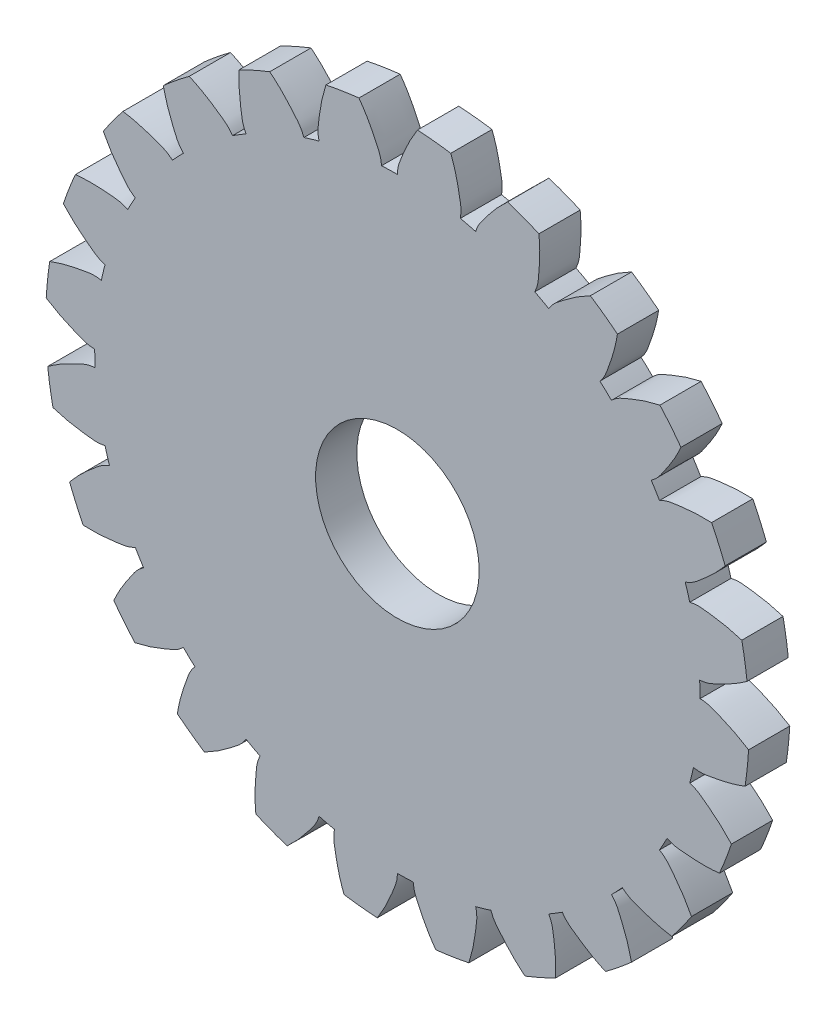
ISO-10303-21;
HEADER;
FILE_DESCRIPTION(('STEP AP214'),'2;1');
FILE_NAME('part.step','',(''),(''),'','','');
FILE_SCHEMA(('AUTOMOTIVE_DESIGN { 1 0 10303 214 1 1 1 1 }'));
ENDSEC;
DATA;
#1=APPLICATION_CONTEXT('core data for automotive mechanical design processes');
#2=APPLICATION_PROTOCOL_DEFINITION('international standard','automotive_design',2000,#1);
#3=PRODUCT_CONTEXT('',#1,'mechanical');
#4=PRODUCT('Part','Part','',(#3));
#5=PRODUCT_RELATED_PRODUCT_CATEGORY('part','',(#4));
#6=PRODUCT_DEFINITION_FORMATION('','',#4);
#7=PRODUCT_DEFINITION_CONTEXT('part definition',#1,'design');
#8=PRODUCT_DEFINITION('design','',#6,#7);
#9=PRODUCT_DEFINITION_SHAPE('','',#8);
#10=(LENGTH_UNIT() NAMED_UNIT(*) SI_UNIT(.MILLI.,.METRE.));
#11=(NAMED_UNIT(*) PLANE_ANGLE_UNIT() SI_UNIT($,.RADIAN.));
#12=(NAMED_UNIT(*) SI_UNIT($,.STERADIAN.) SOLID_ANGLE_UNIT());
#13=UNCERTAINTY_MEASURE_WITH_UNIT(LENGTH_MEASURE(1.E-05),#10,'distance_accuracy_value','');
#14=(GEOMETRIC_REPRESENTATION_CONTEXT(3) GLOBAL_UNCERTAINTY_ASSIGNED_CONTEXT((#13)) GLOBAL_UNIT_ASSIGNED_CONTEXT((#10,
#11,#12)) REPRESENTATION_CONTEXT('',''));
#15=CARTESIAN_POINT('',(0.,0.,0.));
#16=DIRECTION('',(0.,0.,1.));
#17=DIRECTION('',(1.,0.,0.));
#18=AXIS2_PLACEMENT_3D('',#15,#16,#17);
#19=CARTESIAN_POINT('',(0.,0.,1.6002));
#20=DIRECTION('',(0.,0.,-1.));
#21=DIRECTION('',(-1.,0.,0.));
#22=AXIS2_PLACEMENT_3D('',#19,#20,#21);
#23=CYLINDRICAL_SURFACE('',#22,11.7475);
#24=DIRECTION('',(0.,0.,-1.));
#25=VECTOR('',#24,1.);
#26=CARTESIAN_POINT('',(5.33325339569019,10.4670991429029,1.6002));
#27=LINE('',#26,#25);
#28=CARTESIAN_POINT('',(5.33325339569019,10.4670991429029,1.6002));
#29=VERTEX_POINT('',#28);
#30=CARTESIAN_POINT('',(5.33325339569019,10.4670991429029,0.));
#31=VERTEX_POINT('',#30);
#32=EDGE_CURVE('E55',#29,#31,#27,.T.);
#33=ORIENTED_EDGE('',*,*,#32,.F.);
#34=CARTESIAN_POINT('',(0.,0.,1.6002));
#35=DIRECTION('',(0.,0.,1.));
#36=DIRECTION('',(1.,0.,0.));
#37=AXIS2_PLACEMENT_3D('',#34,#35,#36);
#38=CIRCLE('',#37,11.7475);
#39=CARTESIAN_POINT('',(5.87374999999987,10.1736334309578,1.6002));
#40=VERTEX_POINT('',#39);
#41=EDGE_CURVE('E643',#40,#29,#38,.T.);
#42=ORIENTED_EDGE('',*,*,#41,.F.);
#43=DIRECTION('',(0.,0.,-1.));
#44=VECTOR('',#43,1.);
#45=CARTESIAN_POINT('',(5.87374999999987,10.1736334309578,1.6002));
#46=LINE('',#45,#44);
#47=CARTESIAN_POINT('',(5.87374999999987,10.1736334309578,0.));
#48=VERTEX_POINT('',#47);
#49=EDGE_CURVE('E2116',#40,#48,#46,.T.);
#50=ORIENTED_EDGE('',*,*,#49,.T.);
#51=CARTESIAN_POINT('',(0.,0.,0.));
#52=DIRECTION('',(0.,0.,1.));
#53=DIRECTION('',(1.,0.,0.));
#54=AXIS2_PLACEMENT_3D('',#51,#52,#53);
#55=CIRCLE('',#54,11.7475);
#56=EDGE_CURVE('E2190',#48,#31,#55,.T.);
#57=ORIENTED_EDGE('',*,*,#56,.T.);
#58=EDGE_LOOP('',(#33,#42,#50,#57));
#59=FACE_BOUND('',#58,.T.);
#60=ADVANCED_FACE('F31',(#59),#23,.T.);
#61=DIRECTION('',(0.,0.,-1.));
#62=VECTOR('',#61,1.);
#63=CARTESIAN_POINT('',(3.04047673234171,11.3472136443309,1.6002));
#64=LINE('',#63,#62);
#65=CARTESIAN_POINT('',(3.04047673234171,11.3472136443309,1.6002));
#66=VERTEX_POINT('',#65);
#67=CARTESIAN_POINT('',(3.04047673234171,11.3472136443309,0.));
#68=VERTEX_POINT('',#67);
#69=EDGE_CURVE('E655',#66,#68,#64,.T.);
#70=ORIENTED_EDGE('',*,*,#69,.T.);
#71=CARTESIAN_POINT('',(2.44244258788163,11.4907889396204,0.));
#72=VERTEX_POINT('',#71);
#73=EDGE_CURVE('E1450',#68,#72,#55,.T.);
#74=ORIENTED_EDGE('',*,*,#73,.T.);
#75=DIRECTION('',(0.,0.,-1.));
#76=VECTOR('',#75,1.);
#77=CARTESIAN_POINT('',(2.44244258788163,11.4907889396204,1.6002));
#78=LINE('',#77,#76);
#79=CARTESIAN_POINT('',(2.44244258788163,11.4907889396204,1.6002));
#80=VERTEX_POINT('',#79);
#81=EDGE_CURVE('E1474',#80,#72,#78,.T.);
#82=ORIENTED_EDGE('',*,*,#81,.F.);
#83=EDGE_CURVE('E47',#66,#80,#38,.T.);
#84=ORIENTED_EDGE('',*,*,#83,.F.);
#85=EDGE_LOOP('',(#70,#74,#82,#84));
#86=FACE_BOUND('',#85,.T.);
#87=ADVANCED_FACE('F1497',(#86),#23,.T.);
#88=DIRECTION('',(0.,0.,-1.));
#89=VECTOR('',#88,1.);
#90=CARTESIAN_POINT('',(7.86061179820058,8.73009383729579,1.6002));
#91=LINE('',#90,#89);
#92=CARTESIAN_POINT('',(7.86061179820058,8.73009383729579,1.6002));
#93=VERTEX_POINT('',#92);
#94=CARTESIAN_POINT('',(7.86061179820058,8.73009383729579,0.));
#95=VERTEX_POINT('',#94);
#96=EDGE_CURVE('E2119',#93,#95,#91,.T.);
#97=ORIENTED_EDGE('',*,*,#96,.F.);
#98=CARTESIAN_POINT('',(8.30673691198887,8.30673691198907,1.6002));
#99=VERTEX_POINT('',#98);
#100=EDGE_CURVE('E1562',#99,#93,#38,.T.);
#101=ORIENTED_EDGE('',*,*,#100,.F.);
#102=DIRECTION('',(0.,0.,-1.));
#103=VECTOR('',#102,1.);
#104=CARTESIAN_POINT('',(8.30673691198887,8.30673691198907,1.6002));
#105=LINE('',#104,#103);
#106=CARTESIAN_POINT('',(8.30673691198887,8.30673691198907,0.));
#107=VERTEX_POINT('',#106);
#108=EDGE_CURVE('E721',#99,#107,#105,.T.);
#109=ORIENTED_EDGE('',*,*,#108,.T.);
#110=EDGE_CURVE('E2191',#107,#95,#55,.T.);
#111=ORIENTED_EDGE('',*,*,#110,.T.);
#112=EDGE_LOOP('',(#97,#101,#109,#111));
#113=FACE_BOUND('',#112,.T.);
#114=ADVANCED_FACE('F1502',(#113),#23,.T.);
#115=DIRECTION('',(0.,0.,-1.));
#116=VECTOR('',#115,1.);
#117=CARTESIAN_POINT('',(9.85228249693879,6.39814706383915,1.6002));
#118=LINE('',#117,#116);
#119=CARTESIAN_POINT('',(9.8522824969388,6.39814706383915,1.6002));
#120=VERTEX_POINT('',#119);
#121=CARTESIAN_POINT('',(9.8522824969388,6.39814706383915,0.));
#122=VERTEX_POINT('',#121);
#123=EDGE_CURVE('E693',#120,#122,#118,.T.);
#124=ORIENTED_EDGE('',*,*,#123,.F.);
#125=CARTESIAN_POINT('',(10.1736334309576,5.87375000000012,1.6002));
#126=VERTEX_POINT('',#125);
#127=EDGE_CURVE('E1564',#126,#120,#38,.T.);
#128=ORIENTED_EDGE('',*,*,#127,.F.);
#129=DIRECTION('',(0.,0.,-1.));
#130=VECTOR('',#129,1.);
#131=CARTESIAN_POINT('',(10.1736334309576,5.87375000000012,1.6002));
#132=LINE('',#131,#130);
#133=CARTESIAN_POINT('',(10.1736334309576,5.87375000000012,0.));
#134=VERTEX_POINT('',#133);
#135=EDGE_CURVE('E2070',#126,#134,#132,.T.);
#136=ORIENTED_EDGE('',*,*,#135,.T.);
#137=EDGE_CURVE('E2201',#134,#122,#55,.T.);
#138=ORIENTED_EDGE('',*,*,#137,.T.);
#139=EDGE_LOOP('',(#124,#128,#136,#138));
#140=FACE_BOUND('',#139,.T.);
#141=ADVANCED_FACE('F2384',(#140),#23,.T.);
#142=DIRECTION('',(0.,0.,-1.));
#143=VECTOR('',#142,1.);
#144=CARTESIAN_POINT('',(11.1725364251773,3.63017714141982,1.6002));
#145=LINE('',#144,#143);
#146=CARTESIAN_POINT('',(11.1725364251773,3.63017714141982,1.6002));
#147=VERTEX_POINT('',#146);
#148=CARTESIAN_POINT('',(11.1725364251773,3.63017714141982,0.));
#149=VERTEX_POINT('',#148);
#150=EDGE_CURVE('E2073',#147,#149,#145,.T.);
#151=ORIENTED_EDGE('',*,*,#150,.F.);
#152=CARTESIAN_POINT('',(11.3472136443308,3.04047673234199,1.6002));
#153=VERTEX_POINT('',#152);
#154=EDGE_CURVE('E1567',#153,#147,#38,.T.);
#155=ORIENTED_EDGE('',*,*,#154,.F.);
#156=DIRECTION('',(0.,0.,-1.));
#157=VECTOR('',#156,1.);
#158=CARTESIAN_POINT('',(11.3472136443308,3.04047673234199,1.6002));
#159=LINE('',#158,#157);
#160=CARTESIAN_POINT('',(11.3472136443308,3.04047673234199,0.));
#161=VERTEX_POINT('',#160);
#162=EDGE_CURVE('E793',#153,#161,#159,.T.);
#163=ORIENTED_EDGE('',*,*,#162,.T.);
#164=EDGE_CURVE('E2202',#161,#149,#55,.T.);
#165=ORIENTED_EDGE('',*,*,#164,.T.);
#166=EDGE_LOOP('',(#151,#155,#163,#165));
#167=FACE_BOUND('',#166,.T.);
#168=ADVANCED_FACE('F2376',(#167),#23,.T.);
#169=DIRECTION('',(0.,0.,-1.));
#170=VECTOR('',#169,1.);
#171=CARTESIAN_POINT('',(11.7314004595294,0.614816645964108,1.6002));
#172=LINE('',#171,#170);
#173=CARTESIAN_POINT('',(11.7314004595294,0.614816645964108,1.6002));
#174=VERTEX_POINT('',#173);
#175=CARTESIAN_POINT('',(11.7314004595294,0.614816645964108,0.));
#176=VERTEX_POINT('',#175);
#177=EDGE_CURVE('E765',#174,#176,#172,.T.);
#178=ORIENTED_EDGE('',*,*,#177,.F.);
#179=CARTESIAN_POINT('',(11.7475,1.22329227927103E-13,1.6002));
#180=VERTEX_POINT('',#179);
#181=EDGE_CURVE('E1572',#180,#174,#38,.T.);
#182=ORIENTED_EDGE('',*,*,#181,.F.);
#183=DIRECTION('',(0.,0.,-1.));
#184=VECTOR('',#183,1.);
#185=CARTESIAN_POINT('',(11.7475,1.22329227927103E-13,1.6002));
#186=LINE('',#185,#184);
#187=CARTESIAN_POINT('',(11.7475,1.22329227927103E-13,0.));
#188=VERTEX_POINT('',#187);
#189=EDGE_CURVE('E2024',#180,#188,#186,.T.);
#190=ORIENTED_EDGE('',*,*,#189,.T.);
#191=EDGE_CURVE('E2204',#188,#176,#55,.T.);
#192=ORIENTED_EDGE('',*,*,#191,.T.);
#193=EDGE_LOOP('',(#178,#182,#190,#192));
#194=FACE_BOUND('',#193,.T.);
#195=ADVANCED_FACE('F2368',(#194),#23,.T.);
#196=DIRECTION('',(0.,0.,-1.));
#197=VECTOR('',#196,1.);
#198=CARTESIAN_POINT('',(11.4907889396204,-2.44244258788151,1.6002));
#199=LINE('',#198,#197);
#200=CARTESIAN_POINT('',(11.4907889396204,-2.44244258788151,1.6002));
#201=VERTEX_POINT('',#200);
#202=CARTESIAN_POINT('',(11.4907889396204,-2.44244258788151,0.));
#203=VERTEX_POINT('',#202);
#204=EDGE_CURVE('E2027',#201,#203,#199,.T.);
#205=ORIENTED_EDGE('',*,*,#204,.F.);
#206=CARTESIAN_POINT('',(11.3472136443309,-3.04047673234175,1.6002));
#207=VERTEX_POINT('',#206);
#208=EDGE_CURVE('E1575',#207,#201,#38,.T.);
#209=ORIENTED_EDGE('',*,*,#208,.F.);
#210=DIRECTION('',(0.,0.,-1.));
#211=VECTOR('',#210,1.);
#212=CARTESIAN_POINT('',(11.3472136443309,-3.04047673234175,1.6002));
#213=LINE('',#212,#211);
#214=CARTESIAN_POINT('',(11.3472136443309,-3.04047673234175,0.));
#215=VERTEX_POINT('',#214);
#216=EDGE_CURVE('E865',#207,#215,#213,.T.);
#217=ORIENTED_EDGE('',*,*,#216,.T.);
#218=EDGE_CURVE('E2206',#215,#203,#55,.T.);
#219=ORIENTED_EDGE('',*,*,#218,.T.);
#220=EDGE_LOOP('',(#205,#209,#217,#219));
#221=FACE_BOUND('',#220,.T.);
#222=ADVANCED_FACE('F2360',(#221),#23,.T.);
#223=DIRECTION('',(0.,0.,-1.));
#224=VECTOR('',#223,1.);
#225=CARTESIAN_POINT('',(10.4670991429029,-5.33325339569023,1.6002));
#226=LINE('',#225,#224);
#227=CARTESIAN_POINT('',(10.4670991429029,-5.33325339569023,1.6002));
#228=VERTEX_POINT('',#227);
#229=CARTESIAN_POINT('',(10.4670991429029,-5.33325339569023,0.));
#230=VERTEX_POINT('',#229);
#231=EDGE_CURVE('E837',#228,#230,#226,.T.);
#232=ORIENTED_EDGE('',*,*,#231,.F.);
#233=CARTESIAN_POINT('',(10.1736334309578,-5.87374999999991,1.6002));
#234=VERTEX_POINT('',#233);
#235=EDGE_CURVE('E1580',#234,#228,#38,.T.);
#236=ORIENTED_EDGE('',*,*,#235,.F.);
#237=DIRECTION('',(0.,0.,-1.));
#238=VECTOR('',#237,1.);
#239=CARTESIAN_POINT('',(10.1736334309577,-5.87374999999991,1.6002));
#240=LINE('',#239,#238);
#241=CARTESIAN_POINT('',(10.1736334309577,-5.87374999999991,0.));
#242=VERTEX_POINT('',#241);
#243=EDGE_CURVE('E1978',#234,#242,#240,.T.);
#244=ORIENTED_EDGE('',*,*,#243,.T.);
#245=EDGE_CURVE('E2208',#242,#230,#55,.T.);
#246=ORIENTED_EDGE('',*,*,#245,.T.);
#247=EDGE_LOOP('',(#232,#236,#244,#246));
#248=FACE_BOUND('',#247,.T.);
#249=ADVANCED_FACE('F2352',(#248),#23,.T.);
#250=DIRECTION('',(0.,0.,-1.));
#251=VECTOR('',#250,1.);
#252=CARTESIAN_POINT('',(8.73009383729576,-7.86061179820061,1.6002));
#253=LINE('',#252,#251);
#254=CARTESIAN_POINT('',(8.73009383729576,-7.86061179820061,1.6002));
#255=VERTEX_POINT('',#254);
#256=CARTESIAN_POINT('',(8.73009383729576,-7.86061179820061,0.));
#257=VERTEX_POINT('',#256);
#258=EDGE_CURVE('E1981',#255,#257,#253,.T.);
#259=ORIENTED_EDGE('',*,*,#258,.F.);
#260=CARTESIAN_POINT('',(8.30673691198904,-8.3067369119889,1.6002));
#261=VERTEX_POINT('',#260);
#262=EDGE_CURVE('E1583',#261,#255,#38,.T.);
#263=ORIENTED_EDGE('',*,*,#262,.F.);
#264=DIRECTION('',(0.,0.,-1.));
#265=VECTOR('',#264,1.);
#266=CARTESIAN_POINT('',(8.30673691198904,-8.30673691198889,1.6002));
#267=LINE('',#266,#265);
#268=CARTESIAN_POINT('',(8.30673691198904,-8.30673691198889,0.));
#269=VERTEX_POINT('',#268);
#270=EDGE_CURVE('E937',#261,#269,#267,.T.);
#271=ORIENTED_EDGE('',*,*,#270,.T.);
#272=EDGE_CURVE('E2210',#269,#257,#55,.T.);
#273=ORIENTED_EDGE('',*,*,#272,.T.);
#274=EDGE_LOOP('',(#259,#263,#271,#273));
#275=FACE_BOUND('',#274,.T.);
#276=ADVANCED_FACE('F2344',(#275),#23,.T.);
#277=DIRECTION('',(0.,0.,-1.));
#278=VECTOR('',#277,1.);
#279=CARTESIAN_POINT('',(6.39814706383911,-9.85228249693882,1.6002));
#280=LINE('',#279,#278);
#281=CARTESIAN_POINT('',(6.39814706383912,-9.85228249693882,1.6002));
#282=VERTEX_POINT('',#281);
#283=CARTESIAN_POINT('',(6.39814706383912,-9.85228249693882,0.));
#284=VERTEX_POINT('',#283);
#285=EDGE_CURVE('E909',#282,#284,#280,.T.);
#286=ORIENTED_EDGE('',*,*,#285,.F.);
#287=CARTESIAN_POINT('',(5.87375000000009,-10.1736334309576,1.6002));
#288=VERTEX_POINT('',#287);
#289=EDGE_CURVE('E1588',#288,#282,#38,.T.);
#290=ORIENTED_EDGE('',*,*,#289,.F.);
#291=DIRECTION('',(0.,0.,-1.));
#292=VECTOR('',#291,1.);
#293=CARTESIAN_POINT('',(5.87375000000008,-10.1736334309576,1.6002));
#294=LINE('',#293,#292);
#295=CARTESIAN_POINT('',(5.87375000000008,-10.1736334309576,0.));
#296=VERTEX_POINT('',#295);
#297=EDGE_CURVE('E1932',#288,#296,#294,.T.);
#298=ORIENTED_EDGE('',*,*,#297,.T.);
#299=EDGE_CURVE('E2212',#296,#284,#55,.T.);
#300=ORIENTED_EDGE('',*,*,#299,.T.);
#301=EDGE_LOOP('',(#286,#290,#298,#300));
#302=FACE_BOUND('',#301,.T.);
#303=ADVANCED_FACE('F2336',(#302),#23,.T.);
#304=DIRECTION('',(0.,0.,-1.));
#305=VECTOR('',#304,1.);
#306=CARTESIAN_POINT('',(3.63017714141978,-11.1725364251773,1.6002));
#307=LINE('',#306,#305);
#308=CARTESIAN_POINT('',(3.63017714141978,-11.1725364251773,1.6002));
#309=VERTEX_POINT('',#308);
#310=CARTESIAN_POINT('',(3.63017714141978,-11.1725364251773,0.));
#311=VERTEX_POINT('',#310);
#312=EDGE_CURVE('E1935',#309,#311,#307,.T.);
#313=ORIENTED_EDGE('',*,*,#312,.F.);
#314=CARTESIAN_POINT('',(3.04047673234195,-11.3472136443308,1.6002));
#315=VERTEX_POINT('',#314);
#316=EDGE_CURVE('E1591',#315,#309,#38,.T.);
#317=ORIENTED_EDGE('',*,*,#316,.F.);
#318=DIRECTION('',(0.,0.,-1.));
#319=VECTOR('',#318,1.);
#320=CARTESIAN_POINT('',(3.04047673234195,-11.3472136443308,1.6002));
#321=LINE('',#320,#319);
#322=CARTESIAN_POINT('',(3.04047673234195,-11.3472136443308,0.));
#323=VERTEX_POINT('',#322);
#324=EDGE_CURVE('E1009',#315,#323,#321,.T.);
#325=ORIENTED_EDGE('',*,*,#324,.T.);
#326=EDGE_CURVE('E2214',#323,#311,#55,.T.);
#327=ORIENTED_EDGE('',*,*,#326,.T.);
#328=EDGE_LOOP('',(#313,#317,#325,#327));
#329=FACE_BOUND('',#328,.T.);
#330=ADVANCED_FACE('F2328',(#329),#23,.T.);
#331=DIRECTION('',(0.,0.,-1.));
#332=VECTOR('',#331,1.);
#333=CARTESIAN_POINT('',(0.614816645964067,-11.7314004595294,1.6002));
#334=LINE('',#333,#332);
#335=CARTESIAN_POINT('',(0.614816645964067,-11.7314004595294,1.6002));
#336=VERTEX_POINT('',#335);
#337=CARTESIAN_POINT('',(0.614816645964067,-11.7314004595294,0.));
#338=VERTEX_POINT('',#337);
#339=EDGE_CURVE('E981',#336,#338,#334,.T.);
#340=ORIENTED_EDGE('',*,*,#339,.F.);
#341=CARTESIAN_POINT('',(0.,-11.7475,1.6002));
#342=VERTEX_POINT('',#341);
#343=EDGE_CURVE('E1596',#342,#336,#38,.T.);
#344=ORIENTED_EDGE('',*,*,#343,.F.);
#345=DIRECTION('',(0.,0.,-1.));
#346=VECTOR('',#345,1.);
#347=CARTESIAN_POINT('',(0.,-11.7475,1.6002));
#348=LINE('',#347,#346);
#349=CARTESIAN_POINT('',(0.,-11.7475,0.));
#350=VERTEX_POINT('',#349);
#351=EDGE_CURVE('E1886',#342,#350,#348,.T.);
#352=ORIENTED_EDGE('',*,*,#351,.T.);
#353=EDGE_CURVE('E2216',#350,#338,#55,.T.);
#354=ORIENTED_EDGE('',*,*,#353,.T.);
#355=EDGE_LOOP('',(#340,#344,#352,#354));
#356=FACE_BOUND('',#355,.T.);
#357=ADVANCED_FACE('F2320',(#356),#23,.T.);
#358=DIRECTION('',(0.,0.,-1.));
#359=VECTOR('',#358,1.);
#360=CARTESIAN_POINT('',(-2.44244258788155,-11.4907889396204,1.6002));
#361=LINE('',#360,#359);
#362=CARTESIAN_POINT('',(-2.44244258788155,-11.4907889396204,1.6002));
#363=VERTEX_POINT('',#362);
#364=CARTESIAN_POINT('',(-2.44244258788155,-11.4907889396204,0.));
#365=VERTEX_POINT('',#364);
#366=EDGE_CURVE('E1889',#363,#365,#361,.T.);
#367=ORIENTED_EDGE('',*,*,#366,.F.);
#368=CARTESIAN_POINT('',(-3.04047673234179,-11.3472136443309,1.6002));
#369=VERTEX_POINT('',#368);
#370=EDGE_CURVE('E1599',#369,#363,#38,.T.);
#371=ORIENTED_EDGE('',*,*,#370,.F.);
#372=DIRECTION('',(0.,0.,-1.));
#373=VECTOR('',#372,1.);
#374=CARTESIAN_POINT('',(-3.04047673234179,-11.3472136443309,1.6002));
#375=LINE('',#374,#373);
#376=CARTESIAN_POINT('',(-3.04047673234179,-11.3472136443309,0.));
#377=VERTEX_POINT('',#376);
#378=EDGE_CURVE('E1081',#369,#377,#375,.T.);
#379=ORIENTED_EDGE('',*,*,#378,.T.);
#380=EDGE_CURVE('E2218',#377,#365,#55,.T.);
#381=ORIENTED_EDGE('',*,*,#380,.T.);
#382=EDGE_LOOP('',(#367,#371,#379,#381));
#383=FACE_BOUND('',#382,.T.);
#384=ADVANCED_FACE('F2312',(#383),#23,.T.);
#385=DIRECTION('',(0.,0.,-1.));
#386=VECTOR('',#385,1.);
#387=CARTESIAN_POINT('',(-5.33325339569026,-10.4670991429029,1.6002));
#388=LINE('',#387,#386);
#389=CARTESIAN_POINT('',(-5.33325339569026,-10.4670991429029,1.6002));
#390=VERTEX_POINT('',#389);
#391=CARTESIAN_POINT('',(-5.33325339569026,-10.4670991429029,0.));
#392=VERTEX_POINT('',#391);
#393=EDGE_CURVE('E1053',#390,#392,#388,.T.);
#394=ORIENTED_EDGE('',*,*,#393,.F.);
#395=CARTESIAN_POINT('',(-5.87374999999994,-10.1736334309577,1.6002));
#396=VERTEX_POINT('',#395);
#397=EDGE_CURVE('E1604',#396,#390,#38,.T.);
#398=ORIENTED_EDGE('',*,*,#397,.F.);
#399=DIRECTION('',(0.,0.,-1.));
#400=VECTOR('',#399,1.);
#401=CARTESIAN_POINT('',(-5.87374999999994,-10.1736334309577,1.6002));
#402=LINE('',#401,#400);
#403=CARTESIAN_POINT('',(-5.87374999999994,-10.1736334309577,0.));
#404=VERTEX_POINT('',#403);
#405=EDGE_CURVE('E1840',#396,#404,#402,.T.);
#406=ORIENTED_EDGE('',*,*,#405,.T.);
#407=EDGE_CURVE('E2220',#404,#392,#55,.T.);
#408=ORIENTED_EDGE('',*,*,#407,.T.);
#409=EDGE_LOOP('',(#394,#398,#406,#408));
#410=FACE_BOUND('',#409,.T.);
#411=ADVANCED_FACE('F2304',(#410),#23,.T.);
#412=DIRECTION('',(0.,0.,-1.));
#413=VECTOR('',#412,1.);
#414=CARTESIAN_POINT('',(-7.86061179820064,-8.73009383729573,1.6002));
#415=LINE('',#414,#413);
#416=CARTESIAN_POINT('',(-7.86061179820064,-8.73009383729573,1.6002));
#417=VERTEX_POINT('',#416);
#418=CARTESIAN_POINT('',(-7.86061179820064,-8.73009383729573,0.));
#419=VERTEX_POINT('',#418);
#420=EDGE_CURVE('E1843',#417,#419,#415,.T.);
#421=ORIENTED_EDGE('',*,*,#420,.F.);
#422=CARTESIAN_POINT('',(-8.30673691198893,-8.30673691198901,1.6002));
#423=VERTEX_POINT('',#422);
#424=EDGE_CURVE('E1607',#423,#417,#38,.T.);
#425=ORIENTED_EDGE('',*,*,#424,.F.);
#426=DIRECTION('',(0.,0.,-1.));
#427=VECTOR('',#426,1.);
#428=CARTESIAN_POINT('',(-8.30673691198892,-8.30673691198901,1.6002));
#429=LINE('',#428,#427);
#430=CARTESIAN_POINT('',(-8.30673691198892,-8.30673691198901,0.));
#431=VERTEX_POINT('',#430);
#432=EDGE_CURVE('E1153',#423,#431,#429,.T.);
#433=ORIENTED_EDGE('',*,*,#432,.T.);
#434=EDGE_CURVE('E2222',#431,#419,#55,.T.);
#435=ORIENTED_EDGE('',*,*,#434,.T.);
#436=EDGE_LOOP('',(#421,#425,#433,#435));
#437=FACE_BOUND('',#436,.T.);
#438=ADVANCED_FACE('F2296',(#437),#23,.T.);
#439=DIRECTION('',(0.,0.,-1.));
#440=VECTOR('',#439,1.);
#441=CARTESIAN_POINT('',(-9.85228249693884,-6.39814706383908,1.6002));
#442=LINE('',#441,#440);
#443=CARTESIAN_POINT('',(-9.85228249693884,-6.39814706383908,1.6002));
#444=VERTEX_POINT('',#443);
#445=CARTESIAN_POINT('',(-9.85228249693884,-6.39814706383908,0.));
#446=VERTEX_POINT('',#445);
#447=EDGE_CURVE('E1125',#444,#446,#442,.T.);
#448=ORIENTED_EDGE('',*,*,#447,.F.);
#449=CARTESIAN_POINT('',(-10.1736334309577,-5.87375000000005,1.6002));
#450=VERTEX_POINT('',#449);
#451=EDGE_CURVE('E1612',#450,#444,#38,.T.);
#452=ORIENTED_EDGE('',*,*,#451,.F.);
#453=DIRECTION('',(0.,0.,-1.));
#454=VECTOR('',#453,1.);
#455=CARTESIAN_POINT('',(-10.1736334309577,-5.87375000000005,1.6002));
#456=LINE('',#455,#454);
#457=CARTESIAN_POINT('',(-10.1736334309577,-5.87375000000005,0.));
#458=VERTEX_POINT('',#457);
#459=EDGE_CURVE('E1794',#450,#458,#456,.T.);
#460=ORIENTED_EDGE('',*,*,#459,.T.);
#461=EDGE_CURVE('E2224',#458,#446,#55,.T.);
#462=ORIENTED_EDGE('',*,*,#461,.T.);
#463=EDGE_LOOP('',(#448,#452,#460,#462));
#464=FACE_BOUND('',#463,.T.);
#465=ADVANCED_FACE('F2288',(#464),#23,.T.);
#466=DIRECTION('',(0.,0.,-1.));
#467=VECTOR('',#466,1.);
#468=CARTESIAN_POINT('',(-11.1725364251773,-3.63017714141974,1.6002));
#469=LINE('',#468,#467);
#470=CARTESIAN_POINT('',(-11.1725364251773,-3.63017714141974,1.6002));
#471=VERTEX_POINT('',#470);
#472=CARTESIAN_POINT('',(-11.1725364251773,-3.63017714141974,0.));
#473=VERTEX_POINT('',#472);
#474=EDGE_CURVE('E1797',#471,#473,#469,.T.);
#475=ORIENTED_EDGE('',*,*,#474,.F.);
#476=CARTESIAN_POINT('',(-11.3472136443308,-3.04047673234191,1.6002));
#477=VERTEX_POINT('',#476);
#478=EDGE_CURVE('E1615',#477,#471,#38,.T.);
#479=ORIENTED_EDGE('',*,*,#478,.F.);
#480=DIRECTION('',(0.,0.,-1.));
#481=VECTOR('',#480,1.);
#482=CARTESIAN_POINT('',(-11.3472136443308,-3.04047673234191,1.6002));
#483=LINE('',#482,#481);
#484=CARTESIAN_POINT('',(-11.3472136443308,-3.04047673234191,0.));
#485=VERTEX_POINT('',#484);
#486=EDGE_CURVE('E1225',#477,#485,#483,.T.);
#487=ORIENTED_EDGE('',*,*,#486,.T.);
#488=EDGE_CURVE('E2226',#485,#473,#55,.T.);
#489=ORIENTED_EDGE('',*,*,#488,.T.);
#490=EDGE_LOOP('',(#475,#479,#487,#489));
#491=FACE_BOUND('',#490,.T.);
#492=ADVANCED_FACE('F2280',(#491),#23,.T.);
#493=DIRECTION('',(0.,0.,-1.));
#494=VECTOR('',#493,1.);
#495=CARTESIAN_POINT('',(-11.7314004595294,-0.614816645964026,1.6002));
#496=LINE('',#495,#494);
#497=CARTESIAN_POINT('',(-11.7314004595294,-0.614816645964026,1.6002));
#498=VERTEX_POINT('',#497);
#499=CARTESIAN_POINT('',(-11.7314004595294,-0.614816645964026,0.));
#500=VERTEX_POINT('',#499);
#501=EDGE_CURVE('E1197',#498,#500,#496,.T.);
#502=ORIENTED_EDGE('',*,*,#501,.F.);
#503=CARTESIAN_POINT('',(-11.7475,0.,1.6002));
#504=VERTEX_POINT('',#503);
#505=EDGE_CURVE('E1620',#504,#498,#38,.T.);
#506=ORIENTED_EDGE('',*,*,#505,.F.);
#507=DIRECTION('',(0.,0.,-1.));
#508=VECTOR('',#507,1.);
#509=CARTESIAN_POINT('',(-11.7475,0.,1.6002));
#510=LINE('',#509,#508);
#511=CARTESIAN_POINT('',(-11.7475,0.,0.));
#512=VERTEX_POINT('',#511);
#513=EDGE_CURVE('E1748',#504,#512,#510,.T.);
#514=ORIENTED_EDGE('',*,*,#513,.T.);
#515=EDGE_CURVE('E2228',#512,#500,#55,.T.);
#516=ORIENTED_EDGE('',*,*,#515,.T.);
#517=EDGE_LOOP('',(#502,#506,#514,#516));
#518=FACE_BOUND('',#517,.T.);
#519=ADVANCED_FACE('F2272',(#518),#23,.T.);
#520=DIRECTION('',(0.,0.,-1.));
#521=VECTOR('',#520,1.);
#522=CARTESIAN_POINT('',(-11.4907889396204,2.44244258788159,1.6002));
#523=LINE('',#522,#521);
#524=CARTESIAN_POINT('',(-11.4907889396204,2.44244258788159,1.6002));
#525=VERTEX_POINT('',#524);
#526=CARTESIAN_POINT('',(-11.4907889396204,2.44244258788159,0.));
#527=VERTEX_POINT('',#526);
#528=EDGE_CURVE('E1751',#525,#527,#523,.T.);
#529=ORIENTED_EDGE('',*,*,#528,.F.);
#530=CARTESIAN_POINT('',(-11.3472136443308,3.04047673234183,1.6002));
#531=VERTEX_POINT('',#530);
#532=EDGE_CURVE('E1623',#531,#525,#38,.T.);
#533=ORIENTED_EDGE('',*,*,#532,.F.);
#534=DIRECTION('',(0.,0.,-1.));
#535=VECTOR('',#534,1.);
#536=CARTESIAN_POINT('',(-11.3472136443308,3.04047673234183,1.6002));
#537=LINE('',#536,#535);
#538=CARTESIAN_POINT('',(-11.3472136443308,3.04047673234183,0.));
#539=VERTEX_POINT('',#538);
#540=EDGE_CURVE('E1297',#531,#539,#537,.T.);
#541=ORIENTED_EDGE('',*,*,#540,.T.);
#542=EDGE_CURVE('E2230',#539,#527,#55,.T.);
#543=ORIENTED_EDGE('',*,*,#542,.T.);
#544=EDGE_LOOP('',(#529,#533,#541,#543));
#545=FACE_BOUND('',#544,.T.);
#546=ADVANCED_FACE('F2264',(#545),#23,.T.);
#547=DIRECTION('',(0.,0.,-1.));
#548=VECTOR('',#547,1.);
#549=CARTESIAN_POINT('',(-10.4670991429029,5.3332533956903,1.6002));
#550=LINE('',#549,#548);
#551=CARTESIAN_POINT('',(-10.4670991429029,5.3332533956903,1.6002));
#552=VERTEX_POINT('',#551);
#553=CARTESIAN_POINT('',(-10.4670991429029,5.3332533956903,0.));
#554=VERTEX_POINT('',#553);
#555=EDGE_CURVE('E1269',#552,#554,#550,.T.);
#556=ORIENTED_EDGE('',*,*,#555,.F.);
#557=CARTESIAN_POINT('',(-10.1736334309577,5.87374999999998,1.6002));
#558=VERTEX_POINT('',#557);
#559=EDGE_CURVE('E1628',#558,#552,#38,.T.);
#560=ORIENTED_EDGE('',*,*,#559,.F.);
#561=DIRECTION('',(0.,0.,-1.));
#562=VECTOR('',#561,1.);
#563=CARTESIAN_POINT('',(-10.1736334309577,5.87374999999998,1.6002));
#564=LINE('',#563,#562);
#565=CARTESIAN_POINT('',(-10.1736334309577,5.87374999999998,0.));
#566=VERTEX_POINT('',#565);
#567=EDGE_CURVE('E1702',#558,#566,#564,.T.);
#568=ORIENTED_EDGE('',*,*,#567,.T.);
#569=EDGE_CURVE('E2232',#566,#554,#55,.T.);
#570=ORIENTED_EDGE('',*,*,#569,.T.);
#571=EDGE_LOOP('',(#556,#560,#568,#570));
#572=FACE_BOUND('',#571,.T.);
#573=ADVANCED_FACE('F2256',(#572),#23,.T.);
#574=DIRECTION('',(0.,0.,-1.));
#575=VECTOR('',#574,1.);
#576=CARTESIAN_POINT('',(-8.7300938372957,7.86061179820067,1.6002));
#577=LINE('',#576,#575);
#578=CARTESIAN_POINT('',(-8.73009383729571,7.86061179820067,1.6002));
#579=VERTEX_POINT('',#578);
#580=CARTESIAN_POINT('',(-8.73009383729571,7.86061179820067,0.));
#581=VERTEX_POINT('',#580);
#582=EDGE_CURVE('E1705',#579,#581,#577,.T.);
#583=ORIENTED_EDGE('',*,*,#582,.F.);
#584=CARTESIAN_POINT('',(-8.30673691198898,8.30673691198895,1.6002));
#585=VERTEX_POINT('',#584);
#586=EDGE_CURVE('E1631',#585,#579,#38,.T.);
#587=ORIENTED_EDGE('',*,*,#586,.F.);
#588=DIRECTION('',(0.,0.,-1.));
#589=VECTOR('',#588,1.);
#590=CARTESIAN_POINT('',(-8.30673691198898,8.30673691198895,1.6002));
#591=LINE('',#590,#589);
#592=CARTESIAN_POINT('',(-8.30673691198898,8.30673691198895,0.));
#593=VERTEX_POINT('',#592);
#594=EDGE_CURVE('E1369',#585,#593,#591,.T.);
#595=ORIENTED_EDGE('',*,*,#594,.T.);
#596=EDGE_CURVE('E2234',#593,#581,#55,.T.);
#597=ORIENTED_EDGE('',*,*,#596,.T.);
#598=EDGE_LOOP('',(#583,#587,#595,#597));
#599=FACE_BOUND('',#598,.T.);
#600=ADVANCED_FACE('F2248',(#599),#23,.T.);
#601=DIRECTION('',(0.,0.,-1.));
#602=VECTOR('',#601,1.);
#603=CARTESIAN_POINT('',(-6.39814706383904,9.85228249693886,1.6002));
#604=LINE('',#603,#602);
#605=CARTESIAN_POINT('',(-6.39814706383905,9.85228249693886,1.6002));
#606=VERTEX_POINT('',#605);
#607=CARTESIAN_POINT('',(-6.39814706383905,9.85228249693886,0.));
#608=VERTEX_POINT('',#607);
#609=EDGE_CURVE('E1341',#606,#608,#604,.T.);
#610=ORIENTED_EDGE('',*,*,#609,.F.);
#611=CARTESIAN_POINT('',(-5.87375000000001,10.1736334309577,1.6002));
#612=VERTEX_POINT('',#611);
#613=EDGE_CURVE('E1636',#612,#606,#38,.T.);
#614=ORIENTED_EDGE('',*,*,#613,.F.);
#615=DIRECTION('',(0.,0.,-1.));
#616=VECTOR('',#615,1.);
#617=CARTESIAN_POINT('',(-5.87375000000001,10.1736334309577,1.6002));
#618=LINE('',#617,#616);
#619=CARTESIAN_POINT('',(-5.87375000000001,10.1736334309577,0.));
#620=VERTEX_POINT('',#619);
#621=EDGE_CURVE('E1655',#612,#620,#618,.T.);
#622=ORIENTED_EDGE('',*,*,#621,.T.);
#623=EDGE_CURVE('E2236',#620,#608,#55,.T.);
#624=ORIENTED_EDGE('',*,*,#623,.T.);
#625=EDGE_LOOP('',(#610,#614,#622,#624));
#626=FACE_BOUND('',#625,.T.);
#627=ADVANCED_FACE('F1509',(#626),#23,.T.);
#628=DIRECTION('',(0.,0.,-1.));
#629=VECTOR('',#628,1.);
#630=CARTESIAN_POINT('',(-3.6301771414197,11.1725364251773,1.6002));
#631=LINE('',#630,#629);
#632=CARTESIAN_POINT('',(-3.63017714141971,11.1725364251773,1.6002));
#633=VERTEX_POINT('',#632);
#634=CARTESIAN_POINT('',(-3.63017714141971,11.1725364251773,0.));
#635=VERTEX_POINT('',#634);
#636=EDGE_CURVE('E1649',#633,#635,#631,.T.);
#637=ORIENTED_EDGE('',*,*,#636,.F.);
#638=CARTESIAN_POINT('',(-3.04047673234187,11.3472136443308,1.6002));
#639=VERTEX_POINT('',#638);
#640=EDGE_CURVE('E1455',#639,#633,#38,.T.);
#641=ORIENTED_EDGE('',*,*,#640,.F.);
#642=DIRECTION('',(0.,0.,-1.));
#643=VECTOR('',#642,1.);
#644=CARTESIAN_POINT('',(-3.04047673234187,11.3472136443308,1.6002));
#645=LINE('',#644,#643);
#646=CARTESIAN_POINT('',(-3.04047673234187,11.3472136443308,0.));
#647=VERTEX_POINT('',#646);
#648=EDGE_CURVE('E1441',#639,#647,#645,.T.);
#649=ORIENTED_EDGE('',*,*,#648,.T.);
#650=EDGE_CURVE('E1457',#647,#635,#55,.T.);
#651=ORIENTED_EDGE('',*,*,#650,.T.);
#652=EDGE_LOOP('',(#637,#641,#649,#651));
#653=FACE_BOUND('',#652,.T.);
#654=ADVANCED_FACE('F1504',(#653),#23,.T.);
#655=DIRECTION('',(0.,0.,-1.));
#656=VECTOR('',#655,1.);
#657=CARTESIAN_POINT('',(-0.614816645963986,11.7314004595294,1.6002));
#658=LINE('',#657,#656);
#659=CARTESIAN_POINT('',(-0.614816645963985,11.7314004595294,1.6002));
#660=VERTEX_POINT('',#659);
#661=CARTESIAN_POINT('',(-0.614816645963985,11.7314004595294,0.));
#662=VERTEX_POINT('',#661);
#663=EDGE_CURVE('E1413',#660,#662,#658,.T.);
#664=ORIENTED_EDGE('',*,*,#663,.F.);
#665=CARTESIAN_POINT('',(0.,11.7475,1.6002));
#666=VERTEX_POINT('',#665);
#667=EDGE_CURVE('E1451',#666,#660,#38,.T.);
#668=ORIENTED_EDGE('',*,*,#667,.F.);
#669=DIRECTION('',(0.,0.,-1.));
#670=VECTOR('',#669,1.);
#671=CARTESIAN_POINT('',(0.,11.7475,1.6002));
#672=LINE('',#671,#670);
#673=CARTESIAN_POINT('',(0.,11.7475,0.));
#674=VERTEX_POINT('',#673);
#675=EDGE_CURVE('E1553',#666,#674,#672,.T.);
#676=ORIENTED_EDGE('',*,*,#675,.T.);
#677=EDGE_CURVE('E1456',#674,#662,#55,.T.);
#678=ORIENTED_EDGE('',*,*,#677,.T.);
#679=EDGE_LOOP('',(#664,#668,#676,#678));
#680=FACE_BOUND('',#679,.T.);
#681=ADVANCED_FACE('F1494',(#680),#23,.T.);
#682=CARTESIAN_POINT('',(2.44244258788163,11.4907889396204,1.6002));
#683=CARTESIAN_POINT('',(2.45203181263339,11.5499871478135,1.6002));
#684=CARTESIAN_POINT('',(2.49029625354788,11.7862091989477,1.6002));
#685=CARTESIAN_POINT('',(2.39446740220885,12.3225963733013,1.6002));
#686=CARTESIAN_POINT('',(2.27327836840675,12.9336285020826,1.6002));
#687=CARTESIAN_POINT('',(2.12222869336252,13.3541650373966,1.6002));
#688=CARTESIAN_POINT('',(2.07186812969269,13.4943735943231,1.6002));
#689=B_SPLINE_CURVE_WITH_KNOTS('',3,(#682,#683,#684,#685,#686,#687,#688),.UNSPECIFIED.,.F.,.F.,
(4,1,1,1,4),(0.,0.0873077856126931,0.34838933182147,0.782750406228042,1.),.UNSPECIFIED.);
#690=DIRECTION('',(0.,0.,-1.));
#691=VECTOR('',#690,1.);
#692=SURFACE_OF_LINEAR_EXTRUSION('',#689,#691);
#693=CARTESIAN_POINT('',(2.44244258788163,11.4907889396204,0.));
#694=CARTESIAN_POINT('',(2.45203181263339,11.5499871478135,0.));
#695=CARTESIAN_POINT('',(2.49029625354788,11.7862091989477,0.));
#696=CARTESIAN_POINT('',(2.39446740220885,12.3225963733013,0.));
#697=CARTESIAN_POINT('',(2.27327836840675,12.9336285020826,0.));
#698=CARTESIAN_POINT('',(2.12222869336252,13.3541650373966,0.));
#699=CARTESIAN_POINT('',(2.07186812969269,13.4943735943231,0.));
#700=B_SPLINE_CURVE_WITH_KNOTS('',3,(#693,#694,#695,#696,#697,#698,#699),.UNSPECIFIED.,.F.,.F.,
(4,1,1,1,4),(0.,0.0873077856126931,0.34838933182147,0.782750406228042,1.),.UNSPECIFIED.);
#701=CARTESIAN_POINT('',(2.07186812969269,13.4943735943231,0.));
#702=VERTEX_POINT('',#701);
#703=EDGE_CURVE('E1454',#72,#702,#700,.T.);
#704=ORIENTED_EDGE('',*,*,#703,.T.);
#705=DIRECTION('',(0.,0.,-1.));
#706=VECTOR('',#705,1.);
#707=CARTESIAN_POINT('',(2.07186812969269,13.4943735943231,1.6002));
#708=LINE('',#707,#706);
#709=CARTESIAN_POINT('',(2.07186812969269,13.4943735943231,1.6002));
#710=VERTEX_POINT('',#709);
#711=EDGE_CURVE('E11',#710,#702,#708,.T.);
#712=ORIENTED_EDGE('',*,*,#711,.F.);
#713=EDGE_CURVE('E1458',#80,#710,#689,.T.);
#714=ORIENTED_EDGE('',*,*,#713,.F.);
#715=ORIENTED_EDGE('',*,*,#81,.T.);
#716=EDGE_LOOP('',(#704,#712,#714,#715));
#717=FACE_BOUND('',#716,.T.);
#718=ADVANCED_FACE('F33',(#717),#692,.F.);
#719=CARTESIAN_POINT('',(0.,0.,1.6002));
#720=DIRECTION('',(0.,0.,-1.));
#721=DIRECTION('',(-1.,0.,0.));
#722=AXIS2_PLACEMENT_3D('',#719,#720,#721);
#723=CYLINDRICAL_SURFACE('',#722,13.6525);
#724=CARTESIAN_POINT('',(0.,0.,0.));
#725=DIRECTION('',(0.,0.,1.));
#726=DIRECTION('',(-1.,0.,0.));
#727=AXIS2_PLACEMENT_3D('',#724,#725,#726);
#728=CIRCLE('',#727,13.6525);
#729=CARTESIAN_POINT('',(0.779045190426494,13.6302547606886,0.));
#730=VERTEX_POINT('',#729);
#731=EDGE_CURVE('E1550',#702,#730,#728,.T.);
#732=ORIENTED_EDGE('',*,*,#731,.T.);
#733=DIRECTION('',(0.,0.,-1.));
#734=VECTOR('',#733,1.);
#735=CARTESIAN_POINT('',(0.779045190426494,13.6302547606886,1.6002));
#736=LINE('',#735,#734);
#737=CARTESIAN_POINT('',(0.779045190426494,13.6302547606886,1.6002));
#738=VERTEX_POINT('',#737);
#739=EDGE_CURVE('E40',#738,#730,#736,.T.);
#740=ORIENTED_EDGE('',*,*,#739,.F.);
#741=CARTESIAN_POINT('',(0.,0.,1.6002));
#742=DIRECTION('',(0.,0.,1.));
#743=DIRECTION('',(-1.,0.,0.));
#744=AXIS2_PLACEMENT_3D('',#741,#742,#743);
#745=CIRCLE('',#744,13.6525);
#746=EDGE_CURVE('E1463',#710,#738,#745,.T.);
#747=ORIENTED_EDGE('',*,*,#746,.F.);
#748=ORIENTED_EDGE('',*,*,#711,.T.);
#749=EDGE_LOOP('',(#732,#740,#747,#748));
#750=FACE_BOUND('',#749,.T.);
#751=ADVANCED_FACE('F1485',(#750),#723,.T.);
#752=CARTESIAN_POINT('',(0.779045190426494,13.6302547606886,1.6002));
#753=CARTESIAN_POINT('',(0.70063412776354,13.5035806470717,1.6002));
#754=CARTESIAN_POINT('',(0.465450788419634,13.1236388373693,1.6002));
#755=CARTESIAN_POINT('',(0.219869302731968,12.551155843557,1.6002));
#756=CARTESIAN_POINT('',(0.0146133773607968,12.0464139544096,1.6002));
#757=CARTESIAN_POINT('',(0.0029283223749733,11.8073982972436,1.6002));
#758=CARTESIAN_POINT('',(0.,11.7475,1.6002));
#759=B_SPLINE_CURVE_WITH_KNOTS('',3,(#752,#753,#754,#755,#756,#757,#758),.UNSPECIFIED.,.F.,.F.,
(4,1,1,1,4),(0.,0.217249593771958,0.65161066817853,0.912692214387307,1.),.UNSPECIFIED.);
#760=DIRECTION('',(0.,0.,-1.));
#761=VECTOR('',#760,1.);
#762=SURFACE_OF_LINEAR_EXTRUSION('',#759,#761);
#763=CARTESIAN_POINT('',(0.779045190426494,13.6302547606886,0.));
#764=CARTESIAN_POINT('',(0.70063412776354,13.5035806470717,0.));
#765=CARTESIAN_POINT('',(0.465450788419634,13.1236388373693,0.));
#766=CARTESIAN_POINT('',(0.219869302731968,12.551155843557,0.));
#767=CARTESIAN_POINT('',(0.0146133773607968,12.0464139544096,0.));
#768=CARTESIAN_POINT('',(0.0029283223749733,11.8073982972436,0.));
#769=CARTESIAN_POINT('',(0.,11.7475,0.));
#770=B_SPLINE_CURVE_WITH_KNOTS('',3,(#763,#764,#765,#766,#767,#768,#769),.UNSPECIFIED.,.F.,.F.,
(4,1,1,1,4),(0.,0.217249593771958,0.65161066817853,0.912692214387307,1.),.UNSPECIFIED.);
#771=EDGE_CURVE('E1464',#730,#674,#770,.T.);
#772=ORIENTED_EDGE('',*,*,#771,.T.);
#773=ORIENTED_EDGE('',*,*,#675,.F.);
#774=EDGE_CURVE('E1469',#738,#666,#759,.T.);
#775=ORIENTED_EDGE('',*,*,#774,.F.);
#776=ORIENTED_EDGE('',*,*,#739,.T.);
#777=EDGE_LOOP('',(#772,#773,#775,#776));
#778=FACE_BOUND('',#777,.T.);
#779=ADVANCED_FACE('F1482',(#778),#762,.F.);
#780=CARTESIAN_POINT('',(2.35508804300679,12.5096136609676,1.6002));
#781=DIRECTION('',(0.,0.,-1.));
#782=DIRECTION('',(-1.,0.,0.));
#783=AXIS2_PLACEMENT_3D('',#780,#781,#782);
#784=PLANE('',#783);
#785=CARTESIAN_POINT('',(0.,0.,1.6002));
#786=DIRECTION('',(0.,0.,1.));
#787=DIRECTION('',(1.,0.,0.));
#788=AXIS2_PLACEMENT_3D('',#785,#786,#787);
#789=CIRCLE('',#788,3.175);
#790=CARTESIAN_POINT('',(3.175,0.,1.6002));
#791=VERTEX_POINT('',#790);
#792=EDGE_CURVE('E2179',#791,#791,#789,.T.);
#793=ORIENTED_EDGE('',*,*,#792,.F.);
#794=EDGE_LOOP('',(#793));
#795=FACE_BOUND('',#794,.T.);
#796=ORIENTED_EDGE('',*,*,#713,.T.);
#797=ORIENTED_EDGE('',*,*,#746,.T.);
#798=ORIENTED_EDGE('',*,*,#774,.T.);
#799=ORIENTED_EDGE('',*,*,#667,.T.);
#800=CARTESIAN_POINT('',(-0.614816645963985,11.7314004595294,1.6002));
#801=CARTESIAN_POINT('',(-0.620875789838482,11.7910634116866,1.6002));
#802=CARTESIAN_POINT('',(-0.645053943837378,12.029139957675,1.6002));
#803=CARTESIAN_POINT('',(-0.876444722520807,12.5224478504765,1.6002));
#804=CARTESIAN_POINT('',(-1.15165109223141,13.0812935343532,1.6002));
#805=CARTESIAN_POINT('',(-1.40639673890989,13.4484061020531,1.6002));
#806=CARTESIAN_POINT('',(-1.49132995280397,13.5708028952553,1.6002));
#807=B_SPLINE_CURVE_WITH_KNOTS('',3,(#800,#801,#802,#803,#804,#805,#806),.UNSPECIFIED.,.F.,.F.,
(4,1,1,1,4),(0.,0.0873077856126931,0.34838933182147,0.782750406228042,1.),.UNSPECIFIED.);
#808=CARTESIAN_POINT('',(-1.49132995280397,13.5708028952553,1.6002));
#809=VERTEX_POINT('',#808);
#810=EDGE_CURVE('E1435',#660,#809,#807,.T.);
#811=ORIENTED_EDGE('',*,*,#810,.T.);
#812=CARTESIAN_POINT('',(0.,0.,1.6002));
#813=DIRECTION('',(0.,0.,1.));
#814=DIRECTION('',(-0.965925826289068,-0.258819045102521,0.));
#815=AXIS2_PLACEMENT_3D('',#812,#813,#814);
#816=CIRCLE('',#815,13.6525);
#817=CARTESIAN_POINT('',(-2.77526965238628,13.3674468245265,1.6002));
#818=VERTEX_POINT('',#817);
#819=EDGE_CURVE('E1414',#809,#818,#816,.T.);
#820=ORIENTED_EDGE('',*,*,#819,.T.);
#821=CARTESIAN_POINT('',(-2.77526965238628,13.3674468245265,1.6002));
#822=CARTESIAN_POINT('',(-2.81822324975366,13.2247947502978,1.6002));
#823=CARTESIAN_POINT('',(-2.94705673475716,12.7969292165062,1.6002));
#824=CARTESIAN_POINT('',(-3.03610073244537,12.1803919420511,1.6002));
#825=CARTESIAN_POINT('',(-3.10372591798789,11.6397245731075,1.6002));
#826=CARTESIAN_POINT('',(-3.05315101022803,11.40582886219,1.6002));
#827=CARTESIAN_POINT('',(-3.04047673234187,11.3472136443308,1.6002));
#828=B_SPLINE_CURVE_WITH_KNOTS('',3,(#821,#822,#823,#824,#825,#826,#827),.UNSPECIFIED.,.F.,.F.,
(4,1,1,1,4),(0.,0.217249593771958,0.65161066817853,0.912692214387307,1.),.UNSPECIFIED.);
#829=EDGE_CURVE('E1406',#818,#639,#828,.T.);
#830=ORIENTED_EDGE('',*,*,#829,.T.);
#831=ORIENTED_EDGE('',*,*,#640,.T.);
#832=CARTESIAN_POINT('',(-3.6301771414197,11.1725364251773,1.6002));
#833=CARTESIAN_POINT('',(-3.65147173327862,11.2285981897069,1.6002));
#834=CARTESIAN_POINT('',(-3.73644478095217,11.4523047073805,1.6002));
#835=CARTESIAN_POINT('',(-4.08762858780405,11.8689152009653,1.6002));
#836=CARTESIAN_POINT('',(-4.49809743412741,12.3374900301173,1.6002));
#837=CARTESIAN_POINT('',(-4.83917855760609,12.6261605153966,1.6002));
#838=CARTESIAN_POINT('',(-4.95289636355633,12.722404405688,1.6002));
#839=B_SPLINE_CURVE_WITH_KNOTS('',3,(#832,#833,#834,#835,#836,#837,#838),.UNSPECIFIED.,.F.,.F.,
(4,1,1,1,4),(0.,0.0873077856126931,0.34838933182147,0.782750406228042,1.),.UNSPECIFIED.);
#840=CARTESIAN_POINT('',(-4.95289636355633,12.722404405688,1.6002));
#841=VERTEX_POINT('',#840);
#842=EDGE_CURVE('E1379',#633,#841,#839,.T.);
#843=ORIENTED_EDGE('',*,*,#842,.T.);
#844=CARTESIAN_POINT('',(0.,0.,1.6002));
#845=DIRECTION('',(0.,0.,1.));
#846=DIRECTION('',(-0.866025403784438,-0.500000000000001,0.));
#847=AXIS2_PLACEMENT_3D('',#844,#845,#846);
#848=CIRCLE('',#847,13.6525);
#849=CARTESIAN_POINT('',(-6.14045445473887,12.1936694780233,1.6002));
#850=VERTEX_POINT('',#849);
#851=EDGE_CURVE('E1385',#841,#850,#848,.T.);
#852=ORIENTED_EDGE('',*,*,#851,.T.);
#853=CARTESIAN_POINT('',(-6.14045445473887,12.1936694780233,1.6002));
#854=CARTESIAN_POINT('',(-6.14502337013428,12.0447609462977,1.6002));
#855=CARTESIAN_POINT('',(-6.15872721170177,11.5981300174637,1.6002));
#856=CARTESIAN_POINT('',(-6.08516552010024,10.9795544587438,1.6002));
#857=CARTESIAN_POINT('',(-6.01055142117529,10.4398071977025,1.6002));
#858=CARTESIAN_POINT('',(-5.9011631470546,10.2269710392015,1.6002));
#859=CARTESIAN_POINT('',(-5.87375000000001,10.1736334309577,1.6002));
#860=B_SPLINE_CURVE_WITH_KNOTS('',3,(#853,#854,#855,#856,#857,#858,#859),.UNSPECIFIED.,.F.,.F.,
(4,1,1,1,4),(0.,0.217249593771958,0.65161066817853,0.912692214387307,1.),.UNSPECIFIED.);
#861=EDGE_CURVE('E1665',#850,#612,#860,.T.);
#862=ORIENTED_EDGE('',*,*,#861,.T.);
#863=ORIENTED_EDGE('',*,*,#613,.T.);
#864=CARTESIAN_POINT('',(-6.39814706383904,9.85228249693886,1.6002));
#865=CARTESIAN_POINT('',(-6.43322591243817,9.90092255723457,1.6002));
#866=CARTESIAN_POINT('',(-6.57320308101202,10.0950138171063,1.6002));
#867=CARTESIAN_POINT('',(-7.02024731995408,10.4065355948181,1.6002));
#868=CARTESIAN_POINT('',(-7.53800586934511,10.7529069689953,1.6002));
#869=CARTESIAN_POINT('',(-7.94217835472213,10.9434629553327,1.6002));
#870=CARTESIAN_POINT('',(-8.07693107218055,11.0069950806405,1.6002));
#871=B_SPLINE_CURVE_WITH_KNOTS('',3,(#864,#865,#866,#867,#868,#869,#870),.UNSPECIFIED.,.F.,.F.,
(4,1,1,1,4),(0.,0.0873077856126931,0.34838933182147,0.782750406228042,1.),.UNSPECIFIED.);
#872=CARTESIAN_POINT('',(-8.07693107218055,11.0069950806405,1.6002));
#873=VERTEX_POINT('',#872);
#874=EDGE_CURVE('E1363',#606,#873,#871,.T.);
#875=ORIENTED_EDGE('',*,*,#874,.T.);
#876=CARTESIAN_POINT('',(0.,0.,1.6002));
#877=DIRECTION('',(0.,0.,1.));
#878=DIRECTION('',(-0.707106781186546,-0.707106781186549,0.));
#879=AXIS2_PLACEMENT_3D('',#876,#877,#878);
#880=CIRCLE('',#879,13.6525);
#881=CARTESIAN_POINT('',(-9.08717743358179,10.1889137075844,1.6002));
#882=VERTEX_POINT('',#881);
#883=EDGE_CURVE('E1342',#873,#882,#880,.T.);
#884=ORIENTED_EDGE('',*,*,#883,.T.);
#885=CARTESIAN_POINT('',(-9.08717743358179,10.1889137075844,1.6002));
#886=CARTESIAN_POINT('',(-9.05305030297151,10.0438965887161,1.6002));
#887=CARTESIAN_POINT('',(-8.95069060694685,9.60893742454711,1.6002));
#888=CARTESIAN_POINT('',(-8.71953633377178,9.03047848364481,1.6002));
#889=CARTESIAN_POINT('',(-8.50776777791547,8.52843421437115,1.6002));
#890=CARTESIAN_POINT('',(-8.3470207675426,8.35116204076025,1.6002));
#891=CARTESIAN_POINT('',(-8.30673691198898,8.30673691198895,1.6002));
#892=B_SPLINE_CURVE_WITH_KNOTS('',3,(#885,#886,#887,#888,#889,#890,#891),.UNSPECIFIED.,.F.,.F.,
(4,1,1,1,4),(0.,0.217249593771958,0.65161066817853,0.912692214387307,1.),.UNSPECIFIED.);
#893=EDGE_CURVE('E1334',#882,#585,#892,.T.);
#894=ORIENTED_EDGE('',*,*,#893,.T.);
#895=ORIENTED_EDGE('',*,*,#586,.T.);
#896=CARTESIAN_POINT('',(-8.7300938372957,7.86061179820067,1.6002));
#897=CARTESIAN_POINT('',(-8.77656637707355,7.89851541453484,1.6002));
#898=CARTESIAN_POINT('',(-8.96200845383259,8.04976441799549,1.6002));
#899=CARTESIAN_POINT('',(-9.47444779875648,8.2349677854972,1.6002));
#900=CARTESIAN_POINT('',(-10.0642116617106,8.43553106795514,1.6002));
#901=CARTESIAN_POINT('',(-10.5039318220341,8.51498647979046,1.6002));
#902=CARTESIAN_POINT('',(-10.6505362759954,8.54147723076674,1.6002));
#903=B_SPLINE_CURVE_WITH_KNOTS('',3,(#896,#897,#898,#899,#900,#901,#902),.UNSPECIFIED.,.F.,.F.,
(4,1,1,1,4),(0.,0.0873077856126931,0.34838933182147,0.782750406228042,1.),.UNSPECIFIED.);
#904=CARTESIAN_POINT('',(-10.6505362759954,8.54147723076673,1.6002));
#905=VERTEX_POINT('',#904);
#906=EDGE_CURVE('E1307',#579,#905,#903,.T.);
#907=ORIENTED_EDGE('',*,*,#906,.T.);
#908=CARTESIAN_POINT('',(0.,0.,1.6002));
#909=DIRECTION('',(0.,0.,1.));
#910=DIRECTION('',(-0.499999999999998,-0.86602540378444,0.));
#911=AXIS2_PLACEMENT_3D('',#908,#909,#910);
#912=CIRCLE('',#911,13.6525);
#913=CARTESIAN_POINT('',(-11.4146242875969,7.48980030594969,1.6002));
#914=VERTEX_POINT('',#913);
#915=EDGE_CURVE('E1313',#905,#914,#912,.T.);
#916=ORIENTED_EDGE('',*,*,#915,.T.);
#917=CARTESIAN_POINT('',(-11.4146242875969,7.48980030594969,1.6002));
#918=CARTESIAN_POINT('',(-11.3441268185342,7.35855727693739,1.6002));
#919=CARTESIAN_POINT('',(-11.1326792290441,6.96491162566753,1.6002));
#920=CARTESIAN_POINT('',(-10.7596851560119,6.46599032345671,1.6002));
#921=CARTESIAN_POINT('',(-10.4251938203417,6.03586253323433,1.6002));
#922=CARTESIAN_POINT('',(-10.2240427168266,5.90623515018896,1.6002));
#923=CARTESIAN_POINT('',(-10.1736334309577,5.87374999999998,1.6002));
#924=B_SPLINE_CURVE_WITH_KNOTS('',3,(#917,#918,#919,#920,#921,#922,#923),.UNSPECIFIED.,.F.,.F.,
(4,1,1,1,4),(0.,0.217249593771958,0.65161066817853,0.912692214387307,1.),.UNSPECIFIED.);
#925=EDGE_CURVE('E1708',#914,#558,#924,.T.);
#926=ORIENTED_EDGE('',*,*,#925,.T.);
#927=ORIENTED_EDGE('',*,*,#559,.T.);
#928=CARTESIAN_POINT('',(-10.4670991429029,5.3332533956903,1.6002));
#929=CARTESIAN_POINT('',(-10.5217983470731,5.35783749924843,1.6002));
#930=CARTESIAN_POINT('',(-10.7400677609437,5.45593687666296,1.6002));
#931=CARTESIAN_POINT('',(-11.2829803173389,5.5022005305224,1.6002));
#932=CARTESIAN_POINT('',(-11.9045580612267,5.54328766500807,1.6002));
#933=CARTESIAN_POINT('',(-12.3498596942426,5.50622774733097,1.6002));
#934=CARTESIAN_POINT('',(-12.4983250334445,5.49387182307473,1.6002));
#935=B_SPLINE_CURVE_WITH_KNOTS('',3,(#928,#929,#930,#931,#932,#933,#934),.UNSPECIFIED.,.F.,.F.,
(4,1,1,1,4),(0.,0.0873077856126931,0.34838933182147,0.782750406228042,1.),.UNSPECIFIED.);
#936=CARTESIAN_POINT('',(-12.4983250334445,5.49387182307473,1.6002));
#937=VERTEX_POINT('',#936);
#938=EDGE_CURVE('E1291',#552,#937,#935,.T.);
#939=ORIENTED_EDGE('',*,*,#938,.T.);
#940=CARTESIAN_POINT('',(0.,0.,1.6002));
#941=DIRECTION('',(0.,0.,1.));
#942=DIRECTION('',(-0.258819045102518,-0.965925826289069,0.));
#943=AXIS2_PLACEMENT_3D('',#940,#941,#942);
#944=CIRCLE('',#943,13.6525);
#945=CARTESIAN_POINT('',(-12.9641833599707,4.2802693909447,1.6002));
#946=VERTEX_POINT('',#945);
#947=EDGE_CURVE('E1270',#937,#946,#944,.T.);
#948=ORIENTED_EDGE('',*,*,#947,.T.);
#949=CARTESIAN_POINT('',(-12.9641833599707,4.2802693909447,1.6002));
#950=CARTESIAN_POINT('',(-12.8621198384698,4.17174444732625,1.6002));
#951=CARTESIAN_POINT('',(-12.5559941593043,3.84623860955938,1.6002));
#952=CARTESIAN_POINT('',(-12.0665792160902,3.46085560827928,1.6002));
#953=CARTESIAN_POINT('',(-11.6321601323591,3.13195679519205,1.6002));
#954=CARTESIAN_POINT('',(-11.4043130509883,3.05880809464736,1.6002));
#955=CARTESIAN_POINT('',(-11.3472136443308,3.04047673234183,1.6002));
#956=B_SPLINE_CURVE_WITH_KNOTS('',3,(#949,#950,#951,#952,#953,#954,#955),.UNSPECIFIED.,.F.,.F.,
(4,1,1,1,4),(0.,0.217249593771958,0.65161066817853,0.912692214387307,1.),.UNSPECIFIED.);
#957=EDGE_CURVE('E1262',#946,#531,#956,.T.);
#958=ORIENTED_EDGE('',*,*,#957,.T.);
#959=ORIENTED_EDGE('',*,*,#532,.T.);
#960=CARTESIAN_POINT('',(-11.4907889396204,2.44244258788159,1.6002));
#961=CARTESIAN_POINT('',(-11.5499871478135,2.45203181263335,1.6002));
#962=CARTESIAN_POINT('',(-11.7862091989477,2.49029625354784,1.6002));
#963=CARTESIAN_POINT('',(-12.3225963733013,2.3944674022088,1.6002));
#964=CARTESIAN_POINT('',(-12.9336285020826,2.2732783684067,1.6002));
#965=CARTESIAN_POINT('',(-13.3541650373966,2.12222869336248,1.6002));
#966=CARTESIAN_POINT('',(-13.4943735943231,2.07186812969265,1.6002));
#967=B_SPLINE_CURVE_WITH_KNOTS('',3,(#960,#961,#962,#963,#964,#965,#966),.UNSPECIFIED.,.F.,.F.,
(4,1,1,1,4),(0.,0.0873077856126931,0.34838933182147,0.782750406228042,1.),.UNSPECIFIED.);
#968=CARTESIAN_POINT('',(-13.4943735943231,2.07186812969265,1.6002));
#969=VERTEX_POINT('',#968);
#970=EDGE_CURVE('E1235',#525,#969,#967,.T.);
#971=ORIENTED_EDGE('',*,*,#970,.T.);
#972=CARTESIAN_POINT('',(0.,0.,1.6002));
#973=DIRECTION('',(0.,0.,1.));
#974=DIRECTION('',(0.,-1.,0.));
#975=AXIS2_PLACEMENT_3D('',#972,#973,#974);
#976=CIRCLE('',#975,13.6525);
#977=CARTESIAN_POINT('',(-13.6302547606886,0.779045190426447,1.6002));
#978=VERTEX_POINT('',#977);
#979=EDGE_CURVE('E1241',#969,#978,#976,.T.);
#980=ORIENTED_EDGE('',*,*,#979,.T.);
#981=CARTESIAN_POINT('',(-13.6302547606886,0.779045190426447,1.6002));
#982=CARTESIAN_POINT('',(-13.5035806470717,0.700634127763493,1.6002));
#983=CARTESIAN_POINT('',(-13.1236388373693,0.465450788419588,1.6002));
#984=CARTESIAN_POINT('',(-12.551155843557,0.219869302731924,1.6002));
#985=CARTESIAN_POINT('',(-12.0464139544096,0.0146133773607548,1.6002));
#986=CARTESIAN_POINT('',(-11.8073982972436,0.00292832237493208,1.6002));
#987=CARTESIAN_POINT('',(-11.7475,0.,1.6002));
#988=B_SPLINE_CURVE_WITH_KNOTS('',3,(#981,#982,#983,#984,#985,#986,#987),.UNSPECIFIED.,.F.,.F.,
(4,1,1,1,4),(0.,0.217249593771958,0.65161066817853,0.912692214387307,1.),.UNSPECIFIED.);
#989=EDGE_CURVE('E1754',#978,#504,#988,.T.);
#990=ORIENTED_EDGE('',*,*,#989,.T.);
#991=ORIENTED_EDGE('',*,*,#505,.T.);
#992=CARTESIAN_POINT('',(-11.7314004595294,-0.614816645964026,1.6002));
#993=CARTESIAN_POINT('',(-11.7910634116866,-0.620875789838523,1.6002));
#994=CARTESIAN_POINT('',(-12.029139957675,-0.645053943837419,1.6002));
#995=CARTESIAN_POINT('',(-12.5224478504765,-0.87644472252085,1.6002));
#996=CARTESIAN_POINT('',(-13.0812935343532,-1.15165109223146,1.6002));
#997=CARTESIAN_POINT('',(-13.4484061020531,-1.40639673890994,1.6002));
#998=CARTESIAN_POINT('',(-13.5708028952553,-1.49132995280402,1.6002));
#999=B_SPLINE_CURVE_WITH_KNOTS('',3,(#992,#993,#994,#995,#996,#997,#998),.UNSPECIFIED.,.F.,.F.,
(4,1,1,1,4),(0.,0.0873077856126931,0.34838933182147,0.782750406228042,1.),.UNSPECIFIED.);
#1000=CARTESIAN_POINT('',(-13.5708028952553,-1.49132995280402,1.6002));
#1001=VERTEX_POINT('',#1000);
#1002=EDGE_CURVE('E1219',#498,#1001,#999,.T.);
#1003=ORIENTED_EDGE('',*,*,#1002,.T.);
#1004=CARTESIAN_POINT('',(0.,0.,1.6002));
#1005=DIRECTION('',(0.,0.,1.));
#1006=DIRECTION('',(0.258819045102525,-0.965925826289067,0.));
#1007=AXIS2_PLACEMENT_3D('',#1004,#1005,#1006);
#1008=CIRCLE('',#1007,13.6525);
#1009=CARTESIAN_POINT('',(-13.3674468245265,-2.77526965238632,1.6002));
#1010=VERTEX_POINT('',#1009);
#1011=EDGE_CURVE('E1198',#1001,#1010,#1008,.T.);
#1012=ORIENTED_EDGE('',*,*,#1011,.T.);
#1013=CARTESIAN_POINT('',(-13.3674468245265,-2.77526965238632,1.6002));
#1014=CARTESIAN_POINT('',(-13.2247947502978,-2.81822324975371,1.6002));
#1015=CARTESIAN_POINT('',(-12.7969292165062,-2.9470567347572,1.6002));
#1016=CARTESIAN_POINT('',(-12.1803919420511,-3.03610073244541,1.6002));
#1017=CARTESIAN_POINT('',(-11.6397245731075,-3.10372591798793,1.6002));
#1018=CARTESIAN_POINT('',(-11.40582886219,-3.05315101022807,1.6002));
#1019=CARTESIAN_POINT('',(-11.3472136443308,-3.04047673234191,1.6002));
#1020=B_SPLINE_CURVE_WITH_KNOTS('',3,(#1013,#1014,#1015,#1016,#1017,#1018,#1019),.UNSPECIFIED.,
.F.,.F.,(4,1,1,1,4),(0.,0.217249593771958,0.65161066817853,0.912692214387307,1.),.UNSPECIFIED.);
#1021=EDGE_CURVE('E1190',#1010,#477,#1020,.T.);
#1022=ORIENTED_EDGE('',*,*,#1021,.T.);
#1023=ORIENTED_EDGE('',*,*,#478,.T.);
#1024=CARTESIAN_POINT('',(-11.1725364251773,-3.63017714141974,1.6002));
#1025=CARTESIAN_POINT('',(-11.2285981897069,-3.65147173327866,1.6002));
#1026=CARTESIAN_POINT('',(-11.4523047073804,-3.73644478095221,1.6002));
#1027=CARTESIAN_POINT('',(-11.8689152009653,-4.08762858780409,1.6002));
#1028=CARTESIAN_POINT('',(-12.3374900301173,-4.49809743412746,1.6002));
#1029=CARTESIAN_POINT('',(-12.6261605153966,-4.83917855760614,1.6002));
#1030=CARTESIAN_POINT('',(-12.722404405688,-4.95289636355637,1.6002));
#1031=B_SPLINE_CURVE_WITH_KNOTS('',3,(#1024,#1025,#1026,#1027,#1028,#1029,#1030),.UNSPECIFIED.,
.F.,.F.,(4,1,1,1,4),(0.,0.0873077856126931,0.34838933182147,0.782750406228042,1.),.UNSPECIFIED.);
#1032=CARTESIAN_POINT('',(-12.722404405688,-4.95289636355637,1.6002));
#1033=VERTEX_POINT('',#1032);
#1034=EDGE_CURVE('E1163',#471,#1033,#1031,.T.);
#1035=ORIENTED_EDGE('',*,*,#1034,.T.);
#1036=CARTESIAN_POINT('',(0.,0.,1.6002));
#1037=DIRECTION('',(0.,0.,1.));
#1038=DIRECTION('',(0.500000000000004,-0.866025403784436,0.));
#1039=AXIS2_PLACEMENT_3D('',#1036,#1037,#1038);
#1040=CIRCLE('',#1039,13.6525);
#1041=CARTESIAN_POINT('',(-12.1936694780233,-6.14045445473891,1.6002));
#1042=VERTEX_POINT('',#1041);
#1043=EDGE_CURVE('E1169',#1033,#1042,#1040,.T.);
#1044=ORIENTED_EDGE('',*,*,#1043,.T.);
#1045=CARTESIAN_POINT('',(-12.1936694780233,-6.14045445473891,1.6002));
#1046=CARTESIAN_POINT('',(-12.0447609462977,-6.14502337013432,1.6002));
#1047=CARTESIAN_POINT('',(-11.5981300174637,-6.15872721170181,1.6002));
#1048=CARTESIAN_POINT('',(-10.9795544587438,-6.08516552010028,1.6002));
#1049=CARTESIAN_POINT('',(-10.4398071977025,-6.01055142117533,1.6002));
#1050=CARTESIAN_POINT('',(-10.2269710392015,-5.90116314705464,1.6002));
#1051=CARTESIAN_POINT('',(-10.1736334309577,-5.87375000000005,1.6002));
#1052=B_SPLINE_CURVE_WITH_KNOTS('',3,(#1045,#1046,#1047,#1048,#1049,#1050,#1051),.UNSPECIFIED.,
.F.,.F.,(4,1,1,1,4),(0.,0.217249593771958,0.65161066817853,0.912692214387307,1.),.UNSPECIFIED.);
#1053=EDGE_CURVE('E1800',#1042,#450,#1052,.T.);
#1054=ORIENTED_EDGE('',*,*,#1053,.T.);
#1055=ORIENTED_EDGE('',*,*,#451,.T.);
#1056=CARTESIAN_POINT('',(-9.85228249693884,-6.39814706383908,1.6002));
#1057=CARTESIAN_POINT('',(-9.90092255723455,-6.43322591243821,1.6002));
#1058=CARTESIAN_POINT('',(-10.0950138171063,-6.57320308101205,1.6002));
#1059=CARTESIAN_POINT('',(-10.4065355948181,-7.02024731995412,1.6002));
#1060=CARTESIAN_POINT('',(-10.7529069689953,-7.53800586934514,1.6002));
#1061=CARTESIAN_POINT('',(-10.9434629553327,-7.94217835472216,1.6002));
#1062=CARTESIAN_POINT('',(-11.0069950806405,-8.07693107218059,1.6002));
#1063=B_SPLINE_CURVE_WITH_KNOTS('',3,(#1056,#1057,#1058,#1059,#1060,#1061,#1062),.UNSPECIFIED.,
.F.,.F.,(4,1,1,1,4),(0.,0.0873077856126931,0.34838933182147,0.782750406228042,1.),.UNSPECIFIED.);
#1064=CARTESIAN_POINT('',(-11.0069950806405,-8.07693107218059,1.6002));
#1065=VERTEX_POINT('',#1064);
#1066=EDGE_CURVE('E1147',#444,#1065,#1063,.T.);
#1067=ORIENTED_EDGE('',*,*,#1066,.T.);
#1068=CARTESIAN_POINT('',(0.,0.,1.6002));
#1069=DIRECTION('',(0.,0.,1.));
#1070=DIRECTION('',(0.707106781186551,-0.707106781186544,0.));
#1071=AXIS2_PLACEMENT_3D('',#1068,#1069,#1070);
#1072=CIRCLE('',#1071,13.6525);
#1073=CARTESIAN_POINT('',(-10.1889137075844,-9.08717743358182,1.6002));
#1074=VERTEX_POINT('',#1073);
#1075=EDGE_CURVE('E1126',#1065,#1074,#1072,.T.);
#1076=ORIENTED_EDGE('',*,*,#1075,.T.);
#1077=CARTESIAN_POINT('',(-10.1889137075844,-9.08717743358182,1.6002));
#1078=CARTESIAN_POINT('',(-10.0438965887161,-9.05305030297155,1.6002));
#1079=CARTESIAN_POINT('',(-9.60893742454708,-8.95069060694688,1.6002));
#1080=CARTESIAN_POINT('',(-9.03047848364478,-8.7195363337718,1.6002));
#1081=CARTESIAN_POINT('',(-8.52843421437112,-8.5077677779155,1.6002));
#1082=CARTESIAN_POINT('',(-8.35116204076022,-8.34702076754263,1.6002));
#1083=CARTESIAN_POINT('',(-8.30673691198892,-8.30673691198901,1.6002));
#1084=B_SPLINE_CURVE_WITH_KNOTS('',3,(#1077,#1078,#1079,#1080,#1081,#1082,#1083),.UNSPECIFIED.,
.F.,.F.,(4,1,1,1,4),(0.,0.217249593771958,0.65161066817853,0.912692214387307,1.),.UNSPECIFIED.);
#1085=EDGE_CURVE('E1118',#1074,#423,#1084,.T.);
#1086=ORIENTED_EDGE('',*,*,#1085,.T.);
#1087=ORIENTED_EDGE('',*,*,#424,.T.);
#1088=CARTESIAN_POINT('',(-7.86061179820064,-8.73009383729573,1.6002));
#1089=CARTESIAN_POINT('',(-7.8985154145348,-8.77656637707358,1.6002));
#1090=CARTESIAN_POINT('',(-8.04976441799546,-8.96200845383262,1.6002));
#1091=CARTESIAN_POINT('',(-8.23496778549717,-9.47444779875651,1.6002));
#1092=CARTESIAN_POINT('',(-8.43553106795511,-10.0642116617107,1.6002));
#1093=CARTESIAN_POINT('',(-8.51498647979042,-10.5039318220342,1.6002));
#1094=CARTESIAN_POINT('',(-8.5414772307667,-10.6505362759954,1.6002));
#1095=B_SPLINE_CURVE_WITH_KNOTS('',3,(#1088,#1089,#1090,#1091,#1092,#1093,#1094),.UNSPECIFIED.,
.F.,.F.,(4,1,1,1,4),(0.,0.0873077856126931,0.34838933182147,0.782750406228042,1.),.UNSPECIFIED.);
#1096=CARTESIAN_POINT('',(-8.5414772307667,-10.6505362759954,1.6002));
#1097=VERTEX_POINT('',#1096);
#1098=EDGE_CURVE('E1091',#417,#1097,#1095,.T.);
#1099=ORIENTED_EDGE('',*,*,#1098,.T.);
#1100=CARTESIAN_POINT('',(0.,0.,1.6002));
#1101=DIRECTION('',(0.,0.,1.));
#1102=DIRECTION('',(0.866025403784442,-0.499999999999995,0.));
#1103=AXIS2_PLACEMENT_3D('',#1100,#1101,#1102);
#1104=CIRCLE('',#1103,13.6525);
#1105=CARTESIAN_POINT('',(-7.48980030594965,-11.4146242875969,1.6002));
#1106=VERTEX_POINT('',#1105);
#1107=EDGE_CURVE('E1097',#1097,#1106,#1104,.T.);
#1108=ORIENTED_EDGE('',*,*,#1107,.T.);
#1109=CARTESIAN_POINT('',(-7.48980030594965,-11.4146242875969,1.6002));
#1110=CARTESIAN_POINT('',(-7.35855727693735,-11.3441268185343,1.6002));
#1111=CARTESIAN_POINT('',(-6.96491162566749,-11.1326792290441,1.6002));
#1112=CARTESIAN_POINT('',(-6.46599032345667,-10.7596851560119,1.6002));
#1113=CARTESIAN_POINT('',(-6.0358625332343,-10.4251938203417,1.6002));
#1114=CARTESIAN_POINT('',(-5.90623515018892,-10.2240427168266,1.6002));
#1115=CARTESIAN_POINT('',(-5.87374999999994,-10.1736334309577,1.6002));
#1116=B_SPLINE_CURVE_WITH_KNOTS('',3,(#1109,#1110,#1111,#1112,#1113,#1114,#1115),.UNSPECIFIED.,
.F.,.F.,(4,1,1,1,4),(0.,0.217249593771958,0.65161066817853,0.912692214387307,1.),.UNSPECIFIED.);
#1117=EDGE_CURVE('E1846',#1106,#396,#1116,.T.);
#1118=ORIENTED_EDGE('',*,*,#1117,.T.);
#1119=ORIENTED_EDGE('',*,*,#397,.T.);
#1120=CARTESIAN_POINT('',(-5.33325339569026,-10.4670991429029,1.6002));
#1121=CARTESIAN_POINT('',(-5.35783749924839,-10.5217983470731,1.6002));
#1122=CARTESIAN_POINT('',(-5.45593687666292,-10.7400677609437,1.6002));
#1123=CARTESIAN_POINT('',(-5.50220053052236,-11.2829803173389,1.6002));
#1124=CARTESIAN_POINT('',(-5.54328766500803,-11.9045580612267,1.6002));
#1125=CARTESIAN_POINT('',(-5.50622774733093,-12.3498596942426,1.6002));
#1126=CARTESIAN_POINT('',(-5.49387182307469,-12.4983250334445,1.6002));
#1127=B_SPLINE_CURVE_WITH_KNOTS('',3,(#1120,#1121,#1122,#1123,#1124,#1125,#1126),.UNSPECIFIED.,
.F.,.F.,(4,1,1,1,4),(0.,0.0873077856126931,0.34838933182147,0.782750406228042,1.),.UNSPECIFIED.);
#1128=CARTESIAN_POINT('',(-5.49387182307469,-12.4983250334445,1.6002));
#1129=VERTEX_POINT('',#1128);
#1130=EDGE_CURVE('E1075',#390,#1129,#1127,.T.);
#1131=ORIENTED_EDGE('',*,*,#1130,.T.);
#1132=CARTESIAN_POINT('',(0.,0.,1.6002));
#1133=DIRECTION('',(0.,0.,1.));
#1134=DIRECTION('',(0.96592582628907,-0.258819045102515,0.));
#1135=AXIS2_PLACEMENT_3D('',#1132,#1133,#1134);
#1136=CIRCLE('',#1135,13.6525);
#1137=CARTESIAN_POINT('',(-4.28026939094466,-12.9641833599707,1.6002));
#1138=VERTEX_POINT('',#1137);
#1139=EDGE_CURVE('E1054',#1129,#1138,#1136,.T.);
#1140=ORIENTED_EDGE('',*,*,#1139,.T.);
#1141=CARTESIAN_POINT('',(-4.28026939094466,-12.9641833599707,1.6002));
#1142=CARTESIAN_POINT('',(-4.17174444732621,-12.8621198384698,1.6002));
#1143=CARTESIAN_POINT('',(-3.84623860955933,-12.5559941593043,1.6002));
#1144=CARTESIAN_POINT('',(-3.46085560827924,-12.0665792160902,1.6002));
#1145=CARTESIAN_POINT('',(-3.13195679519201,-11.6321601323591,1.6002));
#1146=CARTESIAN_POINT('',(-3.05880809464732,-11.4043130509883,1.6002));
#1147=CARTESIAN_POINT('',(-3.04047673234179,-11.3472136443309,1.6002));
#1148=B_SPLINE_CURVE_WITH_KNOTS('',3,(#1141,#1142,#1143,#1144,#1145,#1146,#1147),.UNSPECIFIED.,
.F.,.F.,(4,1,1,1,4),(0.,0.217249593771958,0.65161066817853,0.912692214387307,1.),.UNSPECIFIED.);
#1149=EDGE_CURVE('E1046',#1138,#369,#1148,.T.);
#1150=ORIENTED_EDGE('',*,*,#1149,.T.);
#1151=ORIENTED_EDGE('',*,*,#370,.T.);
#1152=CARTESIAN_POINT('',(-2.44244258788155,-11.4907889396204,1.6002));
#1153=CARTESIAN_POINT('',(-2.45203181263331,-11.5499871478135,1.6002));
#1154=CARTESIAN_POINT('',(-2.4902962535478,-11.7862091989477,1.6002));
#1155=CARTESIAN_POINT('',(-2.39446740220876,-12.3225963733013,1.6002));
#1156=CARTESIAN_POINT('',(-2.27327836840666,-12.9336285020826,1.6002));
#1157=CARTESIAN_POINT('',(-2.12222869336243,-13.3541650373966,1.6002));
#1158=CARTESIAN_POINT('',(-2.0718681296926,-13.4943735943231,1.6002));
#1159=B_SPLINE_CURVE_WITH_KNOTS('',3,(#1152,#1153,#1154,#1155,#1156,#1157,#1158),.UNSPECIFIED.,
.F.,.F.,(4,1,1,1,4),(0.,0.0873077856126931,0.34838933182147,0.782750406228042,1.),.UNSPECIFIED.);
#1160=CARTESIAN_POINT('',(-2.0718681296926,-13.4943735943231,1.6002));
#1161=VERTEX_POINT('',#1160);
#1162=EDGE_CURVE('E1019',#363,#1161,#1159,.T.);
#1163=ORIENTED_EDGE('',*,*,#1162,.T.);
#1164=CARTESIAN_POINT('',(0.,0.,1.6002));
#1165=DIRECTION('',(0.,0.,1.));
#1166=DIRECTION('',(1.,0.,0.));
#1167=AXIS2_PLACEMENT_3D('',#1164,#1165,#1166);
#1168=CIRCLE('',#1167,13.6525);
#1169=CARTESIAN_POINT('',(-0.779045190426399,-13.6302547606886,1.6002));
#1170=VERTEX_POINT('',#1169);
#1171=EDGE_CURVE('E1025',#1161,#1170,#1168,.T.);
#1172=ORIENTED_EDGE('',*,*,#1171,.T.);
#1173=CARTESIAN_POINT('',(-0.779045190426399,-13.6302547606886,1.6002));
#1174=CARTESIAN_POINT('',(-0.700634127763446,-13.5035806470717,1.6002));
#1175=CARTESIAN_POINT('',(-0.465450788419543,-13.1236388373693,1.6002));
#1176=CARTESIAN_POINT('',(-0.21986930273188,-12.551155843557,1.6002));
#1177=CARTESIAN_POINT('',(-0.0146133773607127,-12.0464139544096,1.6002));
#1178=CARTESIAN_POINT('',(-0.00292832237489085,-11.8073982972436,1.6002));
#1179=CARTESIAN_POINT('',(0.,-11.7475,1.6002));
#1180=B_SPLINE_CURVE_WITH_KNOTS('',3,(#1173,#1174,#1175,#1176,#1177,#1178,#1179),.UNSPECIFIED.,
.F.,.F.,(4,1,1,1,4),(0.,0.217249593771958,0.65161066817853,0.912692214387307,1.),.UNSPECIFIED.);
#1181=EDGE_CURVE('E1892',#1170,#342,#1180,.T.);
#1182=ORIENTED_EDGE('',*,*,#1181,.T.);
#1183=ORIENTED_EDGE('',*,*,#343,.T.);
#1184=CARTESIAN_POINT('',(0.614816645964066,-11.7314004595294,1.6002));
#1185=CARTESIAN_POINT('',(0.620875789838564,-11.7910634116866,1.6002));
#1186=CARTESIAN_POINT('',(0.645053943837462,-12.029139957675,1.6002));
#1187=CARTESIAN_POINT('',(0.876444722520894,-12.5224478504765,1.6002));
#1188=CARTESIAN_POINT('',(1.1516510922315,-13.0812935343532,1.6002));
#1189=CARTESIAN_POINT('',(1.40639673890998,-13.4484061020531,1.6002));
#1190=CARTESIAN_POINT('',(1.49132995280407,-13.5708028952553,1.6002));
#1191=B_SPLINE_CURVE_WITH_KNOTS('',3,(#1184,#1185,#1186,#1187,#1188,#1189,#1190),.UNSPECIFIED.,
.F.,.F.,(4,1,1,1,4),(0.,0.0873077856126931,0.34838933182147,0.782750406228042,1.),.UNSPECIFIED.);
#1192=CARTESIAN_POINT('',(1.49132995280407,-13.5708028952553,1.6002));
#1193=VERTEX_POINT('',#1192);
#1194=EDGE_CURVE('E1003',#336,#1193,#1191,.T.);
#1195=ORIENTED_EDGE('',*,*,#1194,.T.);
#1196=CARTESIAN_POINT('',(0.,0.,1.6002));
#1197=DIRECTION('',(0.,0.,1.));
#1198=DIRECTION('',(0.965925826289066,0.258819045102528,0.));
#1199=AXIS2_PLACEMENT_3D('',#1196,#1197,#1198);
#1200=CIRCLE('',#1199,13.6525);
#1201=CARTESIAN_POINT('',(2.77526965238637,-13.3674468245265,1.6002));
#1202=VERTEX_POINT('',#1201);
#1203=EDGE_CURVE('E982',#1193,#1202,#1200,.T.);
#1204=ORIENTED_EDGE('',*,*,#1203,.T.);
#1205=CARTESIAN_POINT('',(2.77526965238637,-13.3674468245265,1.6002));
#1206=CARTESIAN_POINT('',(2.81822324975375,-13.2247947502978,1.6002));
#1207=CARTESIAN_POINT('',(2.94705673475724,-12.7969292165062,1.6002));
#1208=CARTESIAN_POINT('',(3.03610073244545,-12.1803919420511,1.6002));
#1209=CARTESIAN_POINT('',(3.10372591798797,-11.6397245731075,1.6002));
#1210=CARTESIAN_POINT('',(3.05315101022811,-11.40582886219,1.6002));
#1211=CARTESIAN_POINT('',(3.04047673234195,-11.3472136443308,1.6002));
#1212=B_SPLINE_CURVE_WITH_KNOTS('',3,(#1205,#1206,#1207,#1208,#1209,#1210,#1211),.UNSPECIFIED.,
.F.,.F.,(4,1,1,1,4),(0.,0.217249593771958,0.65161066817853,0.912692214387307,1.),.UNSPECIFIED.);
#1213=EDGE_CURVE('E974',#1202,#315,#1212,.T.);
#1214=ORIENTED_EDGE('',*,*,#1213,.T.);
#1215=ORIENTED_EDGE('',*,*,#316,.T.);
#1216=CARTESIAN_POINT('',(3.63017714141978,-11.1725364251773,1.6002));
#1217=CARTESIAN_POINT('',(3.6514717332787,-11.2285981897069,1.6002));
#1218=CARTESIAN_POINT('',(3.73644478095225,-11.4523047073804,1.6002));
#1219=CARTESIAN_POINT('',(4.08762858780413,-11.8689152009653,1.6002));
#1220=CARTESIAN_POINT('',(4.4980974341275,-12.3374900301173,1.6002));
#1221=CARTESIAN_POINT('',(4.83917855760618,-12.6261605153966,1.6002));
#1222=CARTESIAN_POINT('',(4.95289636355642,-12.722404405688,1.6002));
#1223=B_SPLINE_CURVE_WITH_KNOTS('',3,(#1216,#1217,#1218,#1219,#1220,#1221,#1222),.UNSPECIFIED.,
.F.,.F.,(4,1,1,1,4),(0.,0.0873077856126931,0.34838933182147,0.782750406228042,1.),.UNSPECIFIED.);
#1224=CARTESIAN_POINT('',(4.95289636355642,-12.722404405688,1.6002));
#1225=VERTEX_POINT('',#1224);
#1226=EDGE_CURVE('E947',#309,#1225,#1223,.T.);
#1227=ORIENTED_EDGE('',*,*,#1226,.T.);
#1228=CARTESIAN_POINT('',(0.,0.,1.6002));
#1229=DIRECTION('',(0.,0.,1.));
#1230=DIRECTION('',(0.866025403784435,0.500000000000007,0.));
#1231=AXIS2_PLACEMENT_3D('',#1228,#1229,#1230);
#1232=CIRCLE('',#1231,13.6525);
#1233=CARTESIAN_POINT('',(6.14045445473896,-12.1936694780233,1.6002));
#1234=VERTEX_POINT('',#1233);
#1235=EDGE_CURVE('E953',#1225,#1234,#1232,.T.);
#1236=ORIENTED_EDGE('',*,*,#1235,.T.);
#1237=CARTESIAN_POINT('',(6.14045445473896,-12.1936694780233,1.6002));
#1238=CARTESIAN_POINT('',(6.14502337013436,-12.0447609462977,1.6002));
#1239=CARTESIAN_POINT('',(6.15872721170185,-11.5981300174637,1.6002));
#1240=CARTESIAN_POINT('',(6.08516552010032,-10.9795544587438,1.6002));
#1241=CARTESIAN_POINT('',(6.01055142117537,-10.4398071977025,1.6002));
#1242=CARTESIAN_POINT('',(5.90116314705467,-10.2269710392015,1.6002));
#1243=CARTESIAN_POINT('',(5.87375000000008,-10.1736334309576,1.6002));
#1244=B_SPLINE_CURVE_WITH_KNOTS('',3,(#1237,#1238,#1239,#1240,#1241,#1242,#1243),.UNSPECIFIED.,
.F.,.F.,(4,1,1,1,4),(0.,0.217249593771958,0.65161066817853,0.912692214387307,1.),.UNSPECIFIED.);
#1245=EDGE_CURVE('E1938',#1234,#288,#1244,.T.);
#1246=ORIENTED_EDGE('',*,*,#1245,.T.);
#1247=ORIENTED_EDGE('',*,*,#289,.T.);
#1248=CARTESIAN_POINT('',(6.39814706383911,-9.85228249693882,1.6002));
#1249=CARTESIAN_POINT('',(6.43322591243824,-9.90092255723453,1.6002));
#1250=CARTESIAN_POINT('',(6.57320308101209,-10.0950138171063,1.6002));
#1251=CARTESIAN_POINT('',(7.02024731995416,-10.406535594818,1.6002));
#1252=CARTESIAN_POINT('',(7.53800586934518,-10.7529069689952,1.6002));
#1253=CARTESIAN_POINT('',(7.9421783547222,-10.9434629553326,1.6002));
#1254=CARTESIAN_POINT('',(8.07693107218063,-11.0069950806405,1.6002));
#1255=B_SPLINE_CURVE_WITH_KNOTS('',3,(#1248,#1249,#1250,#1251,#1252,#1253,#1254),.UNSPECIFIED.,
.F.,.F.,(4,1,1,1,4),(0.,0.0873077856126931,0.34838933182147,0.782750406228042,1.),.UNSPECIFIED.);
#1256=CARTESIAN_POINT('',(8.07693107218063,-11.0069950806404,1.6002));
#1257=VERTEX_POINT('',#1256);
#1258=EDGE_CURVE('E931',#282,#1257,#1255,.T.);
#1259=ORIENTED_EDGE('',*,*,#1258,.T.);
#1260=CARTESIAN_POINT('',(0.,0.,1.6002));
#1261=DIRECTION('',(0.,0.,1.));
#1262=DIRECTION('',(0.707106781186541,0.707106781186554,0.));
#1263=AXIS2_PLACEMENT_3D('',#1260,#1261,#1262);
#1264=CIRCLE('',#1263,13.6525);
#1265=CARTESIAN_POINT('',(9.08717743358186,-10.1889137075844,1.6002));
#1266=VERTEX_POINT('',#1265);
#1267=EDGE_CURVE('E910',#1257,#1266,#1264,.T.);
#1268=ORIENTED_EDGE('',*,*,#1267,.T.);
#1269=CARTESIAN_POINT('',(9.08717743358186,-10.1889137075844,1.6002));
#1270=CARTESIAN_POINT('',(9.05305030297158,-10.0438965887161,1.6002));
#1271=CARTESIAN_POINT('',(8.95069060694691,-9.60893742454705,1.6002));
#1272=CARTESIAN_POINT('',(8.71953633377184,-9.03047848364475,1.6002));
#1273=CARTESIAN_POINT('',(8.50776777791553,-8.52843421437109,1.6002));
#1274=CARTESIAN_POINT('',(8.34702076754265,-8.35116204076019,1.6002));
#1275=CARTESIAN_POINT('',(8.30673691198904,-8.30673691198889,1.6002));
#1276=B_SPLINE_CURVE_WITH_KNOTS('',3,(#1269,#1270,#1271,#1272,#1273,#1274,#1275),.UNSPECIFIED.,
.F.,.F.,(4,1,1,1,4),(0.,0.217249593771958,0.65161066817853,0.912692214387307,1.),.UNSPECIFIED.);
#1277=EDGE_CURVE('E902',#1266,#261,#1276,.T.);
#1278=ORIENTED_EDGE('',*,*,#1277,.T.);
#1279=ORIENTED_EDGE('',*,*,#262,.T.);
#1280=CARTESIAN_POINT('',(8.73009383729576,-7.86061179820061,1.6002));
#1281=CARTESIAN_POINT('',(8.77656637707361,-7.89851541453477,1.6002));
#1282=CARTESIAN_POINT('',(8.96200845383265,-8.04976441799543,1.6002));
#1283=CARTESIAN_POINT('',(9.47444779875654,-8.23496778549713,1.6002));
#1284=CARTESIAN_POINT('',(10.0642116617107,-8.43553106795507,1.6002));
#1285=CARTESIAN_POINT('',(10.5039318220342,-8.51498647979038,1.6002));
#1286=CARTESIAN_POINT('',(10.6505362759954,-8.54147723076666,1.6002));
#1287=B_SPLINE_CURVE_WITH_KNOTS('',3,(#1280,#1281,#1282,#1283,#1284,#1285,#1286),.UNSPECIFIED.,
.F.,.F.,(4,1,1,1,4),(0.,0.0873077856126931,0.34838933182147,0.782750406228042,1.),.UNSPECIFIED.);
#1288=CARTESIAN_POINT('',(10.6505362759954,-8.54147723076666,1.6002));
#1289=VERTEX_POINT('',#1288);
#1290=EDGE_CURVE('E875',#255,#1289,#1287,.T.);
#1291=ORIENTED_EDGE('',*,*,#1290,.T.);
#1292=CARTESIAN_POINT('',(0.,0.,1.6002));
#1293=DIRECTION('',(0.,0.,1.));
#1294=DIRECTION('',(0.499999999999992,0.866025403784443,0.));
#1295=AXIS2_PLACEMENT_3D('',#1292,#1293,#1294);
#1296=CIRCLE('',#1295,13.6525);
#1297=CARTESIAN_POINT('',(11.4146242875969,-7.48980030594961,1.6002));
#1298=VERTEX_POINT('',#1297);
#1299=EDGE_CURVE('E881',#1289,#1298,#1296,.T.);
#1300=ORIENTED_EDGE('',*,*,#1299,.T.);
#1301=CARTESIAN_POINT('',(11.4146242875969,-7.48980030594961,1.6002));
#1302=CARTESIAN_POINT('',(11.3441268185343,-7.35855727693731,1.6002));
#1303=CARTESIAN_POINT('',(11.1326792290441,-6.96491162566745,1.6002));
#1304=CARTESIAN_POINT('',(10.7596851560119,-6.46599032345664,1.6002));
#1305=CARTESIAN_POINT('',(10.4251938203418,-6.03586253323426,1.6002));
#1306=CARTESIAN_POINT('',(10.2240427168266,-5.90623515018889,1.6002));
#1307=CARTESIAN_POINT('',(10.1736334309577,-5.87374999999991,1.6002));
#1308=B_SPLINE_CURVE_WITH_KNOTS('',3,(#1301,#1302,#1303,#1304,#1305,#1306,#1307),.UNSPECIFIED.,
.F.,.F.,(4,1,1,1,4),(0.,0.217249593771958,0.65161066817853,0.912692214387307,1.),.UNSPECIFIED.);
#1309=EDGE_CURVE('E1984',#1298,#234,#1308,.T.);
#1310=ORIENTED_EDGE('',*,*,#1309,.T.);
#1311=ORIENTED_EDGE('',*,*,#235,.T.);
#1312=CARTESIAN_POINT('',(10.4670991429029,-5.33325339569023,1.6002));
#1313=CARTESIAN_POINT('',(10.5217983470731,-5.35783749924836,1.6002));
#1314=CARTESIAN_POINT('',(10.7400677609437,-5.45593687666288,1.6002));
#1315=CARTESIAN_POINT('',(11.2829803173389,-5.50220053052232,1.6002));
#1316=CARTESIAN_POINT('',(11.9045580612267,-5.54328766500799,1.6002));
#1317=CARTESIAN_POINT('',(12.3498596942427,-5.50622774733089,1.6002));
#1318=CARTESIAN_POINT('',(12.4983250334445,-5.49387182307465,1.6002));
#1319=B_SPLINE_CURVE_WITH_KNOTS('',3,(#1312,#1313,#1314,#1315,#1316,#1317,#1318),.UNSPECIFIED.,
.F.,.F.,(4,1,1,1,4),(0.,0.0873077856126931,0.34838933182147,0.782750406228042,1.),.UNSPECIFIED.);
#1320=CARTESIAN_POINT('',(12.4983250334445,-5.49387182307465,1.6002));
#1321=VERTEX_POINT('',#1320);
#1322=EDGE_CURVE('E859',#228,#1321,#1319,.T.);
#1323=ORIENTED_EDGE('',*,*,#1322,.T.);
#1324=CARTESIAN_POINT('',(0.,0.,1.6002));
#1325=DIRECTION('',(0.,0.,1.));
#1326=DIRECTION('',(0.258819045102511,0.965925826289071,0.));
#1327=AXIS2_PLACEMENT_3D('',#1324,#1325,#1326);
#1328=CIRCLE('',#1327,13.6525);
#1329=CARTESIAN_POINT('',(12.9641833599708,-4.28026939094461,1.6002));
#1330=VERTEX_POINT('',#1329);
#1331=EDGE_CURVE('E838',#1321,#1330,#1328,.T.);
#1332=ORIENTED_EDGE('',*,*,#1331,.T.);
#1333=CARTESIAN_POINT('',(12.9641833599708,-4.28026939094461,1.6002));
#1334=CARTESIAN_POINT('',(12.8621198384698,-4.17174444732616,1.6002));
#1335=CARTESIAN_POINT('',(12.5559941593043,-3.84623860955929,1.6002));
#1336=CARTESIAN_POINT('',(12.0665792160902,-3.46085560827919,1.6002));
#1337=CARTESIAN_POINT('',(11.6321601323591,-3.13195679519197,1.6002));
#1338=CARTESIAN_POINT('',(11.4043130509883,-3.05880809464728,1.6002));
#1339=CARTESIAN_POINT('',(11.3472136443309,-3.04047673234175,1.6002));
#1340=B_SPLINE_CURVE_WITH_KNOTS('',3,(#1333,#1334,#1335,#1336,#1337,#1338,#1339),.UNSPECIFIED.,
.F.,.F.,(4,1,1,1,4),(0.,0.217249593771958,0.65161066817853,0.912692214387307,1.),.UNSPECIFIED.);
#1341=EDGE_CURVE('E830',#1330,#207,#1340,.T.);
#1342=ORIENTED_EDGE('',*,*,#1341,.T.);
#1343=ORIENTED_EDGE('',*,*,#208,.T.);
#1344=CARTESIAN_POINT('',(11.4907889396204,-2.44244258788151,1.6002));
#1345=CARTESIAN_POINT('',(11.5499871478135,-2.45203181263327,1.6002));
#1346=CARTESIAN_POINT('',(11.7862091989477,-2.49029625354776,1.6002));
#1347=CARTESIAN_POINT('',(12.3225963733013,-2.39446740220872,1.6002));
#1348=CARTESIAN_POINT('',(12.9336285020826,-2.27327836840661,1.6002));
#1349=CARTESIAN_POINT('',(13.3541650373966,-2.12222869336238,1.6002));
#1350=CARTESIAN_POINT('',(13.4943735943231,-2.07186812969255,1.6002));
#1351=B_SPLINE_CURVE_WITH_KNOTS('',3,(#1344,#1345,#1346,#1347,#1348,#1349,#1350),.UNSPECIFIED.,
.F.,.F.,(4,1,1,1,4),(0.,0.0873077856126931,0.34838933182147,0.782750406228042,1.),.UNSPECIFIED.);
#1352=CARTESIAN_POINT('',(13.4943735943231,-2.07186812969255,1.6002));
#1353=VERTEX_POINT('',#1352);
#1354=EDGE_CURVE('E803',#201,#1353,#1351,.T.);
#1355=ORIENTED_EDGE('',*,*,#1354,.T.);
#1356=CARTESIAN_POINT('',(0.,0.,1.6002));
#1357=DIRECTION('',(0.,0.,1.));
#1358=DIRECTION('',(0.,1.,0.));
#1359=AXIS2_PLACEMENT_3D('',#1356,#1357,#1358);
#1360=CIRCLE('',#1359,13.6525);
#1361=CARTESIAN_POINT('',(13.6302547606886,-0.779045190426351,1.6002));
#1362=VERTEX_POINT('',#1361);
#1363=EDGE_CURVE('E809',#1353,#1362,#1360,.T.);
#1364=ORIENTED_EDGE('',*,*,#1363,.T.);
#1365=CARTESIAN_POINT('',(13.6302547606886,-0.779045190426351,1.6002));
#1366=CARTESIAN_POINT('',(13.5035806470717,-0.700634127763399,1.6002));
#1367=CARTESIAN_POINT('',(13.1236388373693,-0.465450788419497,1.6002));
#1368=CARTESIAN_POINT('',(12.551155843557,-0.219869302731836,1.6002));
#1369=CARTESIAN_POINT('',(12.0464139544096,-0.0146133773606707,1.6002));
#1370=CARTESIAN_POINT('',(11.8073982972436,-0.00292832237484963,1.6002));
#1371=CARTESIAN_POINT('',(11.7475,1.23048531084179E-13,1.6002));
#1372=B_SPLINE_CURVE_WITH_KNOTS('',3,(#1365,#1366,#1367,#1368,#1369,#1370,#1371),.UNSPECIFIED.,
.F.,.F.,(4,1,1,1,4),(0.,0.217249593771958,0.65161066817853,0.912692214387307,1.),.UNSPECIFIED.);
#1373=EDGE_CURVE('E2030',#1362,#180,#1372,.T.);
#1374=ORIENTED_EDGE('',*,*,#1373,.T.);
#1375=ORIENTED_EDGE('',*,*,#181,.T.);
#1376=CARTESIAN_POINT('',(11.7314004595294,0.614816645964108,1.6002));
#1377=CARTESIAN_POINT('',(11.7910634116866,0.620875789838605,1.6002));
#1378=CARTESIAN_POINT('',(12.029139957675,0.645053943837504,1.6002));
#1379=CARTESIAN_POINT('',(12.5224478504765,0.876444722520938,1.6002));
#1380=CARTESIAN_POINT('',(13.0812935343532,1.15165109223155,1.6002));
#1381=CARTESIAN_POINT('',(13.4484061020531,1.40639673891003,1.6002));
#1382=CARTESIAN_POINT('',(13.5708028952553,1.49132995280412,1.6002));
#1383=B_SPLINE_CURVE_WITH_KNOTS('',3,(#1376,#1377,#1378,#1379,#1380,#1381,#1382),.UNSPECIFIED.,
.F.,.F.,(4,1,1,1,4),(0.,0.0873077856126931,0.34838933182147,0.782750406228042,1.),.UNSPECIFIED.);
#1384=CARTESIAN_POINT('',(13.5708028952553,1.49132995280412,1.6002));
#1385=VERTEX_POINT('',#1384);
#1386=EDGE_CURVE('E787',#174,#1385,#1383,.T.);
#1387=ORIENTED_EDGE('',*,*,#1386,.T.);
#1388=CARTESIAN_POINT('',(0.,0.,1.6002));
#1389=DIRECTION('',(0.,0.,1.));
#1390=DIRECTION('',(-0.258819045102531,0.965925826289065,0.));
#1391=AXIS2_PLACEMENT_3D('',#1388,#1389,#1390);
#1392=CIRCLE('',#1391,13.6525);
#1393=CARTESIAN_POINT('',(13.3674468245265,2.77526965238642,1.6002));
#1394=VERTEX_POINT('',#1393);
#1395=EDGE_CURVE('E766',#1385,#1394,#1392,.T.);
#1396=ORIENTED_EDGE('',*,*,#1395,.T.);
#1397=CARTESIAN_POINT('',(13.3674468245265,2.77526965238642,1.6002));
#1398=CARTESIAN_POINT('',(13.2247947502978,2.8182232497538,1.6002));
#1399=CARTESIAN_POINT('',(12.7969292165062,2.94705673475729,1.6002));
#1400=CARTESIAN_POINT('',(12.180391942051,3.03610073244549,1.6002));
#1401=CARTESIAN_POINT('',(11.6397245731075,3.10372591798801,1.6002));
#1402=CARTESIAN_POINT('',(11.4058288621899,3.05315101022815,1.6002));
#1403=CARTESIAN_POINT('',(11.3472136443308,3.04047673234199,1.6002));
#1404=B_SPLINE_CURVE_WITH_KNOTS('',3,(#1397,#1398,#1399,#1400,#1401,#1402,#1403),.UNSPECIFIED.,
.F.,.F.,(4,1,1,1,4),(0.,0.217249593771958,0.65161066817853,0.912692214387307,1.),.UNSPECIFIED.);
#1405=EDGE_CURVE('E758',#1394,#153,#1404,.T.);
#1406=ORIENTED_EDGE('',*,*,#1405,.T.);
#1407=ORIENTED_EDGE('',*,*,#154,.T.);
#1408=CARTESIAN_POINT('',(11.1725364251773,3.63017714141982,1.6002));
#1409=CARTESIAN_POINT('',(11.2285981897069,3.65147173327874,1.6002));
#1410=CARTESIAN_POINT('',(11.4523047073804,3.73644478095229,1.6002));
#1411=CARTESIAN_POINT('',(11.8689152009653,4.08762858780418,1.6002));
#1412=CARTESIAN_POINT('',(12.3374900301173,4.49809743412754,1.6002));
#1413=CARTESIAN_POINT('',(12.6261605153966,4.83917855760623,1.6002));
#1414=CARTESIAN_POINT('',(12.722404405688,4.95289636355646,1.6002));
#1415=B_SPLINE_CURVE_WITH_KNOTS('',3,(#1408,#1409,#1410,#1411,#1412,#1413,#1414),.UNSPECIFIED.,
.F.,.F.,(4,1,1,1,4),(0.,0.0873077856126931,0.34838933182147,0.782750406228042,1.),.UNSPECIFIED.);
#1416=CARTESIAN_POINT('',(12.722404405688,4.95289636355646,1.6002));
#1417=VERTEX_POINT('',#1416);
#1418=EDGE_CURVE('E731',#147,#1417,#1415,.T.);
#1419=ORIENTED_EDGE('',*,*,#1418,.T.);
#1420=CARTESIAN_POINT('',(0.,0.,1.6002));
#1421=DIRECTION('',(0.,0.,1.));
#1422=DIRECTION('',(-0.50000000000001,0.866025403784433,0.));
#1423=AXIS2_PLACEMENT_3D('',#1420,#1421,#1422);
#1424=CIRCLE('',#1423,13.6525);
#1425=CARTESIAN_POINT('',(12.1936694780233,6.140454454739,1.6002));
#1426=VERTEX_POINT('',#1425);
#1427=EDGE_CURVE('E737',#1417,#1426,#1424,.T.);
#1428=ORIENTED_EDGE('',*,*,#1427,.T.);
#1429=CARTESIAN_POINT('',(12.1936694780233,6.140454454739,1.6002));
#1430=CARTESIAN_POINT('',(12.0447609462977,6.1450233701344,1.6002));
#1431=CARTESIAN_POINT('',(11.5981300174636,6.15872721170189,1.6002));
#1432=CARTESIAN_POINT('',(10.9795544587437,6.08516552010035,1.6002));
#1433=CARTESIAN_POINT('',(10.4398071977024,6.0105514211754,1.6002));
#1434=CARTESIAN_POINT('',(10.2269710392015,5.90116314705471,1.6002));
#1435=CARTESIAN_POINT('',(10.1736334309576,5.87375000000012,1.6002));
#1436=B_SPLINE_CURVE_WITH_KNOTS('',3,(#1429,#1430,#1431,#1432,#1433,#1434,#1435),.UNSPECIFIED.,
.F.,.F.,(4,1,1,1,4),(0.,0.217249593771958,0.65161066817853,0.912692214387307,1.),.UNSPECIFIED.);
#1437=EDGE_CURVE('E2076',#1426,#126,#1436,.T.);
#1438=ORIENTED_EDGE('',*,*,#1437,.T.);
#1439=ORIENTED_EDGE('',*,*,#127,.T.);
#1440=CARTESIAN_POINT('',(9.85228249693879,6.39814706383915,1.6002));
#1441=CARTESIAN_POINT('',(9.90092255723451,6.43322591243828,1.6002));
#1442=CARTESIAN_POINT('',(10.0950138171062,6.57320308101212,1.6002));
#1443=CARTESIAN_POINT('',(10.406535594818,7.02024731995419,1.6002));
#1444=CARTESIAN_POINT('',(10.7529069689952,7.53800586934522,1.6002));
#1445=CARTESIAN_POINT('',(10.9434629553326,7.94217835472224,1.6002));
#1446=CARTESIAN_POINT('',(11.0069950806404,8.07693107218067,1.6002));
#1447=B_SPLINE_CURVE_WITH_KNOTS('',3,(#1440,#1441,#1442,#1443,#1444,#1445,#1446),.UNSPECIFIED.,
.F.,.F.,(4,1,1,1,4),(0.,0.0873077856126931,0.34838933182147,0.782750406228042,1.),.UNSPECIFIED.);
#1448=CARTESIAN_POINT('',(11.0069950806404,8.07693107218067,1.6002));
#1449=VERTEX_POINT('',#1448);
#1450=EDGE_CURVE('E715',#120,#1449,#1447,.T.);
#1451=ORIENTED_EDGE('',*,*,#1450,.T.);
#1452=CARTESIAN_POINT('',(0.,0.,1.6002));
#1453=DIRECTION('',(0.,0.,1.));
#1454=DIRECTION('',(-0.707106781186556,0.707106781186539,0.));
#1455=AXIS2_PLACEMENT_3D('',#1452,#1453,#1454);
#1456=CIRCLE('',#1455,13.6525);
#1457=CARTESIAN_POINT('',(10.1889137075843,9.08717743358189,1.6002));
#1458=VERTEX_POINT('',#1457);
#1459=EDGE_CURVE('E694',#1449,#1458,#1456,.T.);
#1460=ORIENTED_EDGE('',*,*,#1459,.T.);
#1461=CARTESIAN_POINT('',(10.1889137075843,9.08717743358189,1.6002));
#1462=CARTESIAN_POINT('',(10.043896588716,9.05305030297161,1.6002));
#1463=CARTESIAN_POINT('',(9.60893742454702,8.95069060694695,1.6002));
#1464=CARTESIAN_POINT('',(9.03047848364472,8.71953633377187,1.6002));
#1465=CARTESIAN_POINT('',(8.52843421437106,8.50776777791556,1.6002));
#1466=CARTESIAN_POINT('',(8.35116204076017,8.34702076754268,1.6002));
#1467=CARTESIAN_POINT('',(8.30673691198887,8.30673691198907,1.6002));
#1468=B_SPLINE_CURVE_WITH_KNOTS('',3,(#1461,#1462,#1463,#1464,#1465,#1466,#1467),.UNSPECIFIED.,
.F.,.F.,(4,1,1,1,4),(0.,0.217249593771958,0.65161066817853,0.912692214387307,1.),.UNSPECIFIED.);
#1469=EDGE_CURVE('E686',#1458,#99,#1468,.T.);
#1470=ORIENTED_EDGE('',*,*,#1469,.T.);
#1471=ORIENTED_EDGE('',*,*,#100,.T.);
#1472=CARTESIAN_POINT('',(7.86061179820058,8.73009383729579,1.6002));
#1473=CARTESIAN_POINT('',(7.89851541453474,8.77656637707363,1.6002));
#1474=CARTESIAN_POINT('',(8.0497644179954,8.96200845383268,1.6002));
#1475=CARTESIAN_POINT('',(8.2349677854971,9.47444779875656,1.6002));
#1476=CARTESIAN_POINT('',(8.43553106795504,10.0642116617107,1.6002));
#1477=CARTESIAN_POINT('',(8.51498647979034,10.5039318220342,1.6002));
#1478=CARTESIAN_POINT('',(8.54147723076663,10.6505362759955,1.6002));
#1479=B_SPLINE_CURVE_WITH_KNOTS('',3,(#1472,#1473,#1474,#1475,#1476,#1477,#1478),.UNSPECIFIED.,
.F.,.F.,(4,1,1,1,4),(0.,0.0873077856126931,0.34838933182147,0.782750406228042,1.),.UNSPECIFIED.);
#1480=CARTESIAN_POINT('',(8.54147723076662,10.6505362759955,1.6002));
#1481=VERTEX_POINT('',#1480);
#1482=EDGE_CURVE('E659',#93,#1481,#1479,.T.);
#1483=ORIENTED_EDGE('',*,*,#1482,.T.);
#1484=CARTESIAN_POINT('',(0.,0.,1.6002));
#1485=DIRECTION('',(0.,0.,1.));
#1486=DIRECTION('',(-0.866025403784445,0.499999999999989,0.));
#1487=AXIS2_PLACEMENT_3D('',#1484,#1485,#1486);
#1488=CIRCLE('',#1487,13.6525);
#1489=CARTESIAN_POINT('',(7.48980030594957,11.4146242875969,1.6002));
#1490=VERTEX_POINT('',#1489);
#1491=EDGE_CURVE('E665',#1481,#1490,#1488,.T.);
#1492=ORIENTED_EDGE('',*,*,#1491,.T.);
#1493=CARTESIAN_POINT('',(7.48980030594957,11.4146242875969,1.6002));
#1494=CARTESIAN_POINT('',(7.35855727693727,11.3441268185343,1.6002));
#1495=CARTESIAN_POINT('',(6.96491162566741,11.1326792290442,1.6002));
#1496=CARTESIAN_POINT('',(6.4659903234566,10.7596851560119,1.6002));
#1497=CARTESIAN_POINT('',(6.03586253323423,10.4251938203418,1.6002));
#1498=CARTESIAN_POINT('',(5.90623515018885,10.2240427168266,1.6002));
#1499=CARTESIAN_POINT('',(5.87374999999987,10.1736334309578,1.6002));
#1500=B_SPLINE_CURVE_WITH_KNOTS('',3,(#1493,#1494,#1495,#1496,#1497,#1498,#1499),.UNSPECIFIED.,
.F.,.F.,(4,1,1,1,4),(0.,0.217249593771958,0.65161066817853,0.912692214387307,1.),.UNSPECIFIED.);
#1501=EDGE_CURVE('E2122',#1490,#40,#1500,.T.);
#1502=ORIENTED_EDGE('',*,*,#1501,.T.);
#1503=ORIENTED_EDGE('',*,*,#41,.T.);
#1504=CARTESIAN_POINT('',(5.33325339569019,10.4670991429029,1.6002));
#1505=CARTESIAN_POINT('',(5.35783749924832,10.5217983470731,1.6002));
#1506=CARTESIAN_POINT('',(5.45593687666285,10.7400677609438,1.6002));
#1507=CARTESIAN_POINT('',(5.50220053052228,11.282980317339,1.6002));
#1508=CARTESIAN_POINT('',(5.54328766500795,11.9045580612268,1.6002));
#1509=CARTESIAN_POINT('',(5.50622774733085,12.3498596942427,1.6002));
#1510=CARTESIAN_POINT('',(5.4938718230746,12.4983250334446,1.6002));
#1511=B_SPLINE_CURVE_WITH_KNOTS('',3,(#1504,#1505,#1506,#1507,#1508,#1509,#1510),.UNSPECIFIED.,
.F.,.F.,(4,1,1,1,4),(0.,0.0873077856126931,0.34838933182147,0.782750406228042,1.),.UNSPECIFIED.);
#1512=CARTESIAN_POINT('',(5.4938718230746,12.4983250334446,1.6002));
#1513=VERTEX_POINT('',#1512);
#1514=EDGE_CURVE('E637',#29,#1513,#1511,.T.);
#1515=ORIENTED_EDGE('',*,*,#1514,.T.);
#1516=CARTESIAN_POINT('',(0.,0.,1.6002));
#1517=DIRECTION('',(0.,0.,1.));
#1518=DIRECTION('',(-0.965925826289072,0.258819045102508,0.));
#1519=AXIS2_PLACEMENT_3D('',#1516,#1517,#1518);
#1520=CIRCLE('',#1519,13.6525);
#1521=CARTESIAN_POINT('',(4.28026939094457,12.9641833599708,1.6002));
#1522=VERTEX_POINT('',#1521);
#1523=EDGE_CURVE('E626',#1513,#1522,#1520,.T.);
#1524=ORIENTED_EDGE('',*,*,#1523,.T.);
#1525=CARTESIAN_POINT('',(4.28026939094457,12.9641833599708,1.6002));
#1526=CARTESIAN_POINT('',(4.17174444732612,12.8621198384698,1.6002));
#1527=CARTESIAN_POINT('',(3.84623860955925,12.5559941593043,1.6002));
#1528=CARTESIAN_POINT('',(3.46085560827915,12.0665792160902,1.6002));
#1529=CARTESIAN_POINT('',(3.13195679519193,11.6321601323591,1.6002));
#1530=CARTESIAN_POINT('',(3.05880809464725,11.4043130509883,1.6002));
#1531=CARTESIAN_POINT('',(3.04047673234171,11.3472136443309,1.6002));
#1532=B_SPLINE_CURVE_WITH_KNOTS('',3,(#1525,#1526,#1527,#1528,#1529,#1530,#1531),.UNSPECIFIED.,
.F.,.F.,(4,1,1,1,4),(0.,0.217249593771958,0.65161066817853,0.912692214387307,1.),.UNSPECIFIED.);
#1533=EDGE_CURVE('E636',#1522,#66,#1532,.T.);
#1534=ORIENTED_EDGE('',*,*,#1533,.T.);
#1535=ORIENTED_EDGE('',*,*,#83,.T.);
#1536=EDGE_LOOP('',(#796,#797,#798,#799,#811,#820,#830,#831,#843,#852,#862,#863,#875,#884,#894,
#895,#907,#916,#926,#927,#939,#948,#958,#959,#971,#980,#990,#991,#1003,#1012,#1022,#1023,#1035,
#1044,#1054,#1055,#1067,#1076,#1086,#1087,#1099,#1108,#1118,#1119,#1131,#1140,#1150,#1151,#1163,
#1172,#1182,#1183,#1195,#1204,#1214,#1215,#1227,#1236,#1246,#1247,#1259,#1268,#1278,#1279,#1291,
#1300,#1310,#1311,#1323,#1332,#1342,#1343,#1355,#1364,#1374,#1375,#1387,#1396,#1406,#1407,#1419,
#1428,#1438,#1439,#1451,#1460,#1470,#1471,#1483,#1492,#1502,#1503,#1515,#1524,#1534,#1535));
#1537=FACE_BOUND('',#1536,.T.);
#1538=ADVANCED_FACE('F641',(#795,#1537),#784,.F.);
#1539=CARTESIAN_POINT('',(2.35508804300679,12.5096136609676,0.));
#1540=DIRECTION('',(0.,0.,-1.));
#1541=DIRECTION('',(-1.,0.,0.));
#1542=AXIS2_PLACEMENT_3D('',#1539,#1540,#1541);
#1543=PLANE('',#1542);
#1544=CARTESIAN_POINT('',(0.,0.,0.));
#1545=DIRECTION('',(0.,0.,-1.));
#1546=DIRECTION('',(-1.,0.,0.));
#1547=AXIS2_PLACEMENT_3D('',#1544,#1545,#1546);
#1548=CIRCLE('',#1547,3.175);
#1549=CARTESIAN_POINT('',(3.175,0.,0.));
#1550=VERTEX_POINT('',#1549);
#1551=EDGE_CURVE('E1544',#1550,#1550,#1548,.F.);
#1552=ORIENTED_EDGE('',*,*,#1551,.T.);
#1553=EDGE_LOOP('',(#1552));
#1554=FACE_BOUND('',#1553,.T.);
#1555=ORIENTED_EDGE('',*,*,#703,.F.);
#1556=ORIENTED_EDGE('',*,*,#73,.F.);
#1557=CARTESIAN_POINT('',(4.28026939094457,12.9641833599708,0.));
#1558=CARTESIAN_POINT('',(4.17174444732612,12.8621198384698,0.));
#1559=CARTESIAN_POINT('',(3.84623860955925,12.5559941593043,0.));
#1560=CARTESIAN_POINT('',(3.46085560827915,12.0665792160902,0.));
#1561=CARTESIAN_POINT('',(3.13195679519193,11.6321601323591,0.));
#1562=CARTESIAN_POINT('',(3.05880809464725,11.4043130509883,0.));
#1563=CARTESIAN_POINT('',(3.04047673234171,11.3472136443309,0.));
#1564=B_SPLINE_CURVE_WITH_KNOTS('',3,(#1557,#1558,#1559,#1560,#1561,#1562,#1563),.UNSPECIFIED.,
.F.,.F.,(4,1,1,1,4),(0.,0.217249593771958,0.65161066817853,0.912692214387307,1.),.UNSPECIFIED.);
#1565=CARTESIAN_POINT('',(4.28026939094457,12.9641833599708,0.));
#1566=VERTEX_POINT('',#1565);
#1567=EDGE_CURVE('E645',#1566,#68,#1564,.T.);
#1568=ORIENTED_EDGE('',*,*,#1567,.F.);
#1569=CARTESIAN_POINT('',(0.,0.,0.));
#1570=DIRECTION('',(0.,0.,1.));
#1571=DIRECTION('',(-0.965925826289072,0.258819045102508,0.));
#1572=AXIS2_PLACEMENT_3D('',#1569,#1570,#1571);
#1573=CIRCLE('',#1572,13.6525);
#1574=CARTESIAN_POINT('',(5.4938718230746,12.4983250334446,0.));
#1575=VERTEX_POINT('',#1574);
#1576=EDGE_CURVE('E2180',#1575,#1566,#1573,.T.);
#1577=ORIENTED_EDGE('',*,*,#1576,.F.);
#1578=CARTESIAN_POINT('',(5.33325339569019,10.4670991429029,0.));
#1579=CARTESIAN_POINT('',(5.35783749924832,10.5217983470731,0.));
#1580=CARTESIAN_POINT('',(5.45593687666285,10.7400677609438,0.));
#1581=CARTESIAN_POINT('',(5.50220053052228,11.282980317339,0.));
#1582=CARTESIAN_POINT('',(5.54328766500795,11.9045580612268,0.));
#1583=CARTESIAN_POINT('',(5.50622774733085,12.3498596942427,0.));
#1584=CARTESIAN_POINT('',(5.4938718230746,12.4983250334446,0.));
#1585=B_SPLINE_CURVE_WITH_KNOTS('',3,(#1578,#1579,#1580,#1581,#1582,#1583,#1584),.UNSPECIFIED.,
.F.,.F.,(4,1,1,1,4),(0.,0.0873077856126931,0.34838933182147,0.782750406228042,1.),.UNSPECIFIED.);
#1586=EDGE_CURVE('E649',#31,#1575,#1585,.T.);
#1587=ORIENTED_EDGE('',*,*,#1586,.F.);
#1588=ORIENTED_EDGE('',*,*,#56,.F.);
#1589=CARTESIAN_POINT('',(7.48980030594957,11.4146242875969,0.));
#1590=CARTESIAN_POINT('',(7.35855727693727,11.3441268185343,0.));
#1591=CARTESIAN_POINT('',(6.96491162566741,11.1326792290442,0.));
#1592=CARTESIAN_POINT('',(6.4659903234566,10.7596851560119,0.));
#1593=CARTESIAN_POINT('',(6.03586253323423,10.4251938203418,0.));
#1594=CARTESIAN_POINT('',(5.90623515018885,10.2240427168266,0.));
#1595=CARTESIAN_POINT('',(5.87374999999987,10.1736334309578,0.));
#1596=B_SPLINE_CURVE_WITH_KNOTS('',3,(#1589,#1590,#1591,#1592,#1593,#1594,#1595),.UNSPECIFIED.,
.F.,.F.,(4,1,1,1,4),(0.,0.217249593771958,0.65161066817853,0.912692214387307,1.),.UNSPECIFIED.);
#1597=CARTESIAN_POINT('',(7.48980030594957,11.4146242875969,0.));
#1598=VERTEX_POINT('',#1597);
#1599=EDGE_CURVE('E666',#1598,#48,#1596,.T.);
#1600=ORIENTED_EDGE('',*,*,#1599,.F.);
#1601=CARTESIAN_POINT('',(0.,0.,0.));
#1602=DIRECTION('',(0.,0.,1.));
#1603=DIRECTION('',(-0.866025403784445,0.499999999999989,0.));
#1604=AXIS2_PLACEMENT_3D('',#1601,#1602,#1603);
#1605=CIRCLE('',#1604,13.6525);
#1606=CARTESIAN_POINT('',(8.54147723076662,10.6505362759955,0.));
#1607=VERTEX_POINT('',#1606);
#1608=EDGE_CURVE('E653',#1607,#1598,#1605,.T.);
#1609=ORIENTED_EDGE('',*,*,#1608,.F.);
#1610=CARTESIAN_POINT('',(7.86061179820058,8.73009383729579,0.));
#1611=CARTESIAN_POINT('',(7.89851541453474,8.77656637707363,0.));
#1612=CARTESIAN_POINT('',(8.0497644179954,8.96200845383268,0.));
#1613=CARTESIAN_POINT('',(8.2349677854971,9.47444779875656,0.));
#1614=CARTESIAN_POINT('',(8.43553106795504,10.0642116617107,0.));
#1615=CARTESIAN_POINT('',(8.51498647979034,10.5039318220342,0.));
#1616=CARTESIAN_POINT('',(8.54147723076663,10.6505362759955,0.));
#1617=B_SPLINE_CURVE_WITH_KNOTS('',3,(#1610,#1611,#1612,#1613,#1614,#1615,#1616),.UNSPECIFIED.,
.F.,.F.,(4,1,1,1,4),(0.,0.0873077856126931,0.34838933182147,0.782750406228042,1.),.UNSPECIFIED.);
#1618=EDGE_CURVE('E650',#95,#1607,#1617,.T.);
#1619=ORIENTED_EDGE('',*,*,#1618,.F.);
#1620=ORIENTED_EDGE('',*,*,#110,.F.);
#1621=CARTESIAN_POINT('',(10.1889137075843,9.08717743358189,0.));
#1622=CARTESIAN_POINT('',(10.043896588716,9.05305030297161,0.));
#1623=CARTESIAN_POINT('',(9.60893742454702,8.95069060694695,0.));
#1624=CARTESIAN_POINT('',(9.03047848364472,8.71953633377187,0.));
#1625=CARTESIAN_POINT('',(8.52843421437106,8.50776777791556,0.));
#1626=CARTESIAN_POINT('',(8.35116204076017,8.34702076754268,0.));
#1627=CARTESIAN_POINT('',(8.30673691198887,8.30673691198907,0.));
#1628=B_SPLINE_CURVE_WITH_KNOTS('',3,(#1621,#1622,#1623,#1624,#1625,#1626,#1627),.UNSPECIFIED.,
.F.,.F.,(4,1,1,1,4),(0.,0.217249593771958,0.65161066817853,0.912692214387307,1.),.UNSPECIFIED.);
#1629=CARTESIAN_POINT('',(10.1889137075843,9.08717743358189,0.));
#1630=VERTEX_POINT('',#1629);
#1631=EDGE_CURVE('E710',#1630,#107,#1628,.T.);
#1632=ORIENTED_EDGE('',*,*,#1631,.F.);
#1633=CARTESIAN_POINT('',(0.,0.,0.));
#1634=DIRECTION('',(0.,0.,1.));
#1635=DIRECTION('',(-0.707106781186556,0.707106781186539,0.));
#1636=AXIS2_PLACEMENT_3D('',#1633,#1634,#1635);
#1637=CIRCLE('',#1636,13.6525);
#1638=CARTESIAN_POINT('',(11.0069950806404,8.07693107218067,0.));
#1639=VERTEX_POINT('',#1638);
#1640=EDGE_CURVE('E704',#1639,#1630,#1637,.T.);
#1641=ORIENTED_EDGE('',*,*,#1640,.F.);
#1642=CARTESIAN_POINT('',(9.85228249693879,6.39814706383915,0.));
#1643=CARTESIAN_POINT('',(9.90092255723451,6.43322591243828,0.));
#1644=CARTESIAN_POINT('',(10.0950138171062,6.57320308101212,0.));
#1645=CARTESIAN_POINT('',(10.406535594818,7.02024731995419,0.));
#1646=CARTESIAN_POINT('',(10.7529069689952,7.53800586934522,0.));
#1647=CARTESIAN_POINT('',(10.9434629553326,7.94217835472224,0.));
#1648=CARTESIAN_POINT('',(11.0069950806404,8.07693107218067,0.));
#1649=B_SPLINE_CURVE_WITH_KNOTS('',3,(#1642,#1643,#1644,#1645,#1646,#1647,#1648),.UNSPECIFIED.,
.F.,.F.,(4,1,1,1,4),(0.,0.0873077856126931,0.34838933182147,0.782750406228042,1.),.UNSPECIFIED.);
#1650=EDGE_CURVE('E696',#122,#1639,#1649,.T.);
#1651=ORIENTED_EDGE('',*,*,#1650,.F.);
#1652=ORIENTED_EDGE('',*,*,#137,.F.);
#1653=CARTESIAN_POINT('',(12.1936694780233,6.140454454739,0.));
#1654=CARTESIAN_POINT('',(12.0447609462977,6.1450233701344,0.));
#1655=CARTESIAN_POINT('',(11.5981300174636,6.15872721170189,0.));
#1656=CARTESIAN_POINT('',(10.9795544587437,6.08516552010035,0.));
#1657=CARTESIAN_POINT('',(10.4398071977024,6.0105514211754,0.));
#1658=CARTESIAN_POINT('',(10.2269710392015,5.90116314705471,0.));
#1659=CARTESIAN_POINT('',(10.1736334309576,5.87375000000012,0.));
#1660=B_SPLINE_CURVE_WITH_KNOTS('',3,(#1653,#1654,#1655,#1656,#1657,#1658,#1659),.UNSPECIFIED.,
.F.,.F.,(4,1,1,1,4),(0.,0.217249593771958,0.65161066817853,0.912692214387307,1.),.UNSPECIFIED.);
#1661=CARTESIAN_POINT('',(12.1936694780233,6.140454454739,0.));
#1662=VERTEX_POINT('',#1661);
#1663=EDGE_CURVE('E738',#1662,#134,#1660,.T.);
#1664=ORIENTED_EDGE('',*,*,#1663,.F.);
#1665=CARTESIAN_POINT('',(0.,0.,0.));
#1666=DIRECTION('',(0.,0.,1.));
#1667=DIRECTION('',(-0.50000000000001,0.866025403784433,0.));
#1668=AXIS2_PLACEMENT_3D('',#1665,#1666,#1667);
#1669=CIRCLE('',#1668,13.6525);
#1670=CARTESIAN_POINT('',(12.722404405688,4.95289636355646,0.));
#1671=VERTEX_POINT('',#1670);
#1672=EDGE_CURVE('E2081',#1671,#1662,#1669,.T.);
#1673=ORIENTED_EDGE('',*,*,#1672,.F.);
#1674=CARTESIAN_POINT('',(11.1725364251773,3.63017714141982,0.));
#1675=CARTESIAN_POINT('',(11.2285981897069,3.65147173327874,0.));
#1676=CARTESIAN_POINT('',(11.4523047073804,3.73644478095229,0.));
#1677=CARTESIAN_POINT('',(11.8689152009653,4.08762858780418,0.));
#1678=CARTESIAN_POINT('',(12.3374900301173,4.49809743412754,0.));
#1679=CARTESIAN_POINT('',(12.6261605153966,4.83917855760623,0.));
#1680=CARTESIAN_POINT('',(12.722404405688,4.95289636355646,0.));
#1681=B_SPLINE_CURVE_WITH_KNOTS('',3,(#1674,#1675,#1676,#1677,#1678,#1679,#1680),.UNSPECIFIED.,
.F.,.F.,(4,1,1,1,4),(0.,0.0873077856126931,0.34838933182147,0.782750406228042,1.),.UNSPECIFIED.);
#1682=EDGE_CURVE('E730',#149,#1671,#1681,.T.);
#1683=ORIENTED_EDGE('',*,*,#1682,.F.);
#1684=ORIENTED_EDGE('',*,*,#164,.F.);
#1685=CARTESIAN_POINT('',(13.3674468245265,2.77526965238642,0.));
#1686=CARTESIAN_POINT('',(13.2247947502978,2.8182232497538,0.));
#1687=CARTESIAN_POINT('',(12.7969292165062,2.94705673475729,0.));
#1688=CARTESIAN_POINT('',(12.180391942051,3.03610073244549,0.));
#1689=CARTESIAN_POINT('',(11.6397245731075,3.10372591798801,0.));
#1690=CARTESIAN_POINT('',(11.4058288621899,3.05315101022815,0.));
#1691=CARTESIAN_POINT('',(11.3472136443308,3.04047673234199,0.));
#1692=B_SPLINE_CURVE_WITH_KNOTS('',3,(#1685,#1686,#1687,#1688,#1689,#1690,#1691),.UNSPECIFIED.,
.F.,.F.,(4,1,1,1,4),(0.,0.217249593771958,0.65161066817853,0.912692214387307,1.),.UNSPECIFIED.);
#1693=CARTESIAN_POINT('',(13.3674468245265,2.77526965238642,0.));
#1694=VERTEX_POINT('',#1693);
#1695=EDGE_CURVE('E782',#1694,#161,#1692,.T.);
#1696=ORIENTED_EDGE('',*,*,#1695,.F.);
#1697=CARTESIAN_POINT('',(0.,0.,0.));
#1698=DIRECTION('',(0.,0.,1.));
#1699=DIRECTION('',(-0.258819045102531,0.965925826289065,0.));
#1700=AXIS2_PLACEMENT_3D('',#1697,#1698,#1699);
#1701=CIRCLE('',#1700,13.6525);
#1702=CARTESIAN_POINT('',(13.5708028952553,1.49132995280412,0.));
#1703=VERTEX_POINT('',#1702);
#1704=EDGE_CURVE('E776',#1703,#1694,#1701,.T.);
#1705=ORIENTED_EDGE('',*,*,#1704,.F.);
#1706=CARTESIAN_POINT('',(11.7314004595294,0.614816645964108,0.));
#1707=CARTESIAN_POINT('',(11.7910634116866,0.620875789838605,0.));
#1708=CARTESIAN_POINT('',(12.029139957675,0.645053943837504,0.));
#1709=CARTESIAN_POINT('',(12.5224478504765,0.876444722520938,0.));
#1710=CARTESIAN_POINT('',(13.0812935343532,1.15165109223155,0.));
#1711=CARTESIAN_POINT('',(13.4484061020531,1.40639673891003,0.));
#1712=CARTESIAN_POINT('',(13.5708028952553,1.49132995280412,0.));
#1713=B_SPLINE_CURVE_WITH_KNOTS('',3,(#1706,#1707,#1708,#1709,#1710,#1711,#1712),.UNSPECIFIED.,
.F.,.F.,(4,1,1,1,4),(0.,0.0873077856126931,0.34838933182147,0.782750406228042,1.),.UNSPECIFIED.);
#1714=EDGE_CURVE('E768',#176,#1703,#1713,.T.);
#1715=ORIENTED_EDGE('',*,*,#1714,.F.);
#1716=ORIENTED_EDGE('',*,*,#191,.F.);
#1717=CARTESIAN_POINT('',(13.6302547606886,-0.779045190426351,0.));
#1718=CARTESIAN_POINT('',(13.5035806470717,-0.700634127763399,0.));
#1719=CARTESIAN_POINT('',(13.1236388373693,-0.465450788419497,0.));
#1720=CARTESIAN_POINT('',(12.551155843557,-0.219869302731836,0.));
#1721=CARTESIAN_POINT('',(12.0464139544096,-0.0146133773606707,0.));
#1722=CARTESIAN_POINT('',(11.8073982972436,-0.00292832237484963,0.));
#1723=CARTESIAN_POINT('',(11.7475,1.23048531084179E-13,0.));
#1724=B_SPLINE_CURVE_WITH_KNOTS('',3,(#1717,#1718,#1719,#1720,#1721,#1722,#1723),.UNSPECIFIED.,
.F.,.F.,(4,1,1,1,4),(0.,0.217249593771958,0.65161066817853,0.912692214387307,1.),.UNSPECIFIED.);
#1725=CARTESIAN_POINT('',(13.6302547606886,-0.779045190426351,0.));
#1726=VERTEX_POINT('',#1725);
#1727=EDGE_CURVE('E810',#1726,#188,#1724,.T.);
#1728=ORIENTED_EDGE('',*,*,#1727,.F.);
#1729=CARTESIAN_POINT('',(0.,0.,0.));
#1730=DIRECTION('',(0.,0.,1.));
#1731=DIRECTION('',(0.,1.,0.));
#1732=AXIS2_PLACEMENT_3D('',#1729,#1730,#1731);
#1733=CIRCLE('',#1732,13.6525);
#1734=CARTESIAN_POINT('',(13.4943735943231,-2.07186812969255,0.));
#1735=VERTEX_POINT('',#1734);
#1736=EDGE_CURVE('E2035',#1735,#1726,#1733,.T.);
#1737=ORIENTED_EDGE('',*,*,#1736,.F.);
#1738=CARTESIAN_POINT('',(11.4907889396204,-2.44244258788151,0.));
#1739=CARTESIAN_POINT('',(11.5499871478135,-2.45203181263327,0.));
#1740=CARTESIAN_POINT('',(11.7862091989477,-2.49029625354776,0.));
#1741=CARTESIAN_POINT('',(12.3225963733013,-2.39446740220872,0.));
#1742=CARTESIAN_POINT('',(12.9336285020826,-2.27327836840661,0.));
#1743=CARTESIAN_POINT('',(13.3541650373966,-2.12222869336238,0.));
#1744=CARTESIAN_POINT('',(13.4943735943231,-2.07186812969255,0.));
#1745=B_SPLINE_CURVE_WITH_KNOTS('',3,(#1738,#1739,#1740,#1741,#1742,#1743,#1744),.UNSPECIFIED.,
.F.,.F.,(4,1,1,1,4),(0.,0.0873077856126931,0.34838933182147,0.782750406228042,1.),.UNSPECIFIED.);
#1746=EDGE_CURVE('E802',#203,#1735,#1745,.T.);
#1747=ORIENTED_EDGE('',*,*,#1746,.F.);
#1748=ORIENTED_EDGE('',*,*,#218,.F.);
#1749=CARTESIAN_POINT('',(12.9641833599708,-4.28026939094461,0.));
#1750=CARTESIAN_POINT('',(12.8621198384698,-4.17174444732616,0.));
#1751=CARTESIAN_POINT('',(12.5559941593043,-3.84623860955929,0.));
#1752=CARTESIAN_POINT('',(12.0665792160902,-3.46085560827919,0.));
#1753=CARTESIAN_POINT('',(11.6321601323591,-3.13195679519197,0.));
#1754=CARTESIAN_POINT('',(11.4043130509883,-3.05880809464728,0.));
#1755=CARTESIAN_POINT('',(11.3472136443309,-3.04047673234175,0.));
#1756=B_SPLINE_CURVE_WITH_KNOTS('',3,(#1749,#1750,#1751,#1752,#1753,#1754,#1755),.UNSPECIFIED.,
.F.,.F.,(4,1,1,1,4),(0.,0.217249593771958,0.65161066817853,0.912692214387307,1.),.UNSPECIFIED.);
#1757=CARTESIAN_POINT('',(12.9641833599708,-4.28026939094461,0.));
#1758=VERTEX_POINT('',#1757);
#1759=EDGE_CURVE('E854',#1758,#215,#1756,.T.);
#1760=ORIENTED_EDGE('',*,*,#1759,.F.);
#1761=CARTESIAN_POINT('',(0.,0.,0.));
#1762=DIRECTION('',(0.,0.,1.));
#1763=DIRECTION('',(0.258819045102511,0.965925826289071,0.));
#1764=AXIS2_PLACEMENT_3D('',#1761,#1762,#1763);
#1765=CIRCLE('',#1764,13.6525);
#1766=CARTESIAN_POINT('',(12.4983250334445,-5.49387182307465,0.));
#1767=VERTEX_POINT('',#1766);
#1768=EDGE_CURVE('E848',#1767,#1758,#1765,.T.);
#1769=ORIENTED_EDGE('',*,*,#1768,.F.);
#1770=CARTESIAN_POINT('',(10.4670991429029,-5.33325339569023,0.));
#1771=CARTESIAN_POINT('',(10.5217983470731,-5.35783749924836,0.));
#1772=CARTESIAN_POINT('',(10.7400677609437,-5.45593687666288,0.));
#1773=CARTESIAN_POINT('',(11.2829803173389,-5.50220053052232,0.));
#1774=CARTESIAN_POINT('',(11.9045580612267,-5.54328766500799,0.));
#1775=CARTESIAN_POINT('',(12.3498596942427,-5.50622774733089,0.));
#1776=CARTESIAN_POINT('',(12.4983250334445,-5.49387182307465,0.));
#1777=B_SPLINE_CURVE_WITH_KNOTS('',3,(#1770,#1771,#1772,#1773,#1774,#1775,#1776),.UNSPECIFIED.,
.F.,.F.,(4,1,1,1,4),(0.,0.0873077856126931,0.34838933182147,0.782750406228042,1.),.UNSPECIFIED.);
#1778=EDGE_CURVE('E840',#230,#1767,#1777,.T.);
#1779=ORIENTED_EDGE('',*,*,#1778,.F.);
#1780=ORIENTED_EDGE('',*,*,#245,.F.);
#1781=CARTESIAN_POINT('',(11.4146242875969,-7.48980030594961,0.));
#1782=CARTESIAN_POINT('',(11.3441268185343,-7.35855727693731,0.));
#1783=CARTESIAN_POINT('',(11.1326792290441,-6.96491162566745,0.));
#1784=CARTESIAN_POINT('',(10.7596851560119,-6.46599032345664,0.));
#1785=CARTESIAN_POINT('',(10.4251938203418,-6.03586253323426,0.));
#1786=CARTESIAN_POINT('',(10.2240427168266,-5.90623515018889,0.));
#1787=CARTESIAN_POINT('',(10.1736334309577,-5.87374999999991,0.));
#1788=B_SPLINE_CURVE_WITH_KNOTS('',3,(#1781,#1782,#1783,#1784,#1785,#1786,#1787),.UNSPECIFIED.,
.F.,.F.,(4,1,1,1,4),(0.,0.217249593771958,0.65161066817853,0.912692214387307,1.),.UNSPECIFIED.);
#1789=CARTESIAN_POINT('',(11.4146242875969,-7.48980030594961,0.));
#1790=VERTEX_POINT('',#1789);
#1791=EDGE_CURVE('E882',#1790,#242,#1788,.T.);
#1792=ORIENTED_EDGE('',*,*,#1791,.F.);
#1793=CARTESIAN_POINT('',(0.,0.,0.));
#1794=DIRECTION('',(0.,0.,1.));
#1795=DIRECTION('',(0.499999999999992,0.866025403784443,0.));
#1796=AXIS2_PLACEMENT_3D('',#1793,#1794,#1795);
#1797=CIRCLE('',#1796,13.6525);
#1798=CARTESIAN_POINT('',(10.6505362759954,-8.54147723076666,0.));
#1799=VERTEX_POINT('',#1798);
#1800=EDGE_CURVE('E1989',#1799,#1790,#1797,.T.);
#1801=ORIENTED_EDGE('',*,*,#1800,.F.);
#1802=CARTESIAN_POINT('',(8.73009383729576,-7.86061179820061,0.));
#1803=CARTESIAN_POINT('',(8.77656637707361,-7.89851541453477,0.));
#1804=CARTESIAN_POINT('',(8.96200845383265,-8.04976441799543,0.));
#1805=CARTESIAN_POINT('',(9.47444779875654,-8.23496778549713,0.));
#1806=CARTESIAN_POINT('',(10.0642116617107,-8.43553106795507,0.));
#1807=CARTESIAN_POINT('',(10.5039318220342,-8.51498647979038,0.));
#1808=CARTESIAN_POINT('',(10.6505362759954,-8.54147723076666,0.));
#1809=B_SPLINE_CURVE_WITH_KNOTS('',3,(#1802,#1803,#1804,#1805,#1806,#1807,#1808),.UNSPECIFIED.,
.F.,.F.,(4,1,1,1,4),(0.,0.0873077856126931,0.34838933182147,0.782750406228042,1.),.UNSPECIFIED.);
#1810=EDGE_CURVE('E874',#257,#1799,#1809,.T.);
#1811=ORIENTED_EDGE('',*,*,#1810,.F.);
#1812=ORIENTED_EDGE('',*,*,#272,.F.);
#1813=CARTESIAN_POINT('',(9.08717743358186,-10.1889137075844,0.));
#1814=CARTESIAN_POINT('',(9.05305030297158,-10.0438965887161,0.));
#1815=CARTESIAN_POINT('',(8.95069060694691,-9.60893742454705,0.));
#1816=CARTESIAN_POINT('',(8.71953633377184,-9.03047848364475,0.));
#1817=CARTESIAN_POINT('',(8.50776777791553,-8.52843421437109,0.));
#1818=CARTESIAN_POINT('',(8.34702076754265,-8.35116204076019,0.));
#1819=CARTESIAN_POINT('',(8.30673691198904,-8.30673691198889,0.));
#1820=B_SPLINE_CURVE_WITH_KNOTS('',3,(#1813,#1814,#1815,#1816,#1817,#1818,#1819),.UNSPECIFIED.,
.F.,.F.,(4,1,1,1,4),(0.,0.217249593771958,0.65161066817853,0.912692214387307,1.),.UNSPECIFIED.);
#1821=CARTESIAN_POINT('',(9.08717743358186,-10.1889137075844,0.));
#1822=VERTEX_POINT('',#1821);
#1823=EDGE_CURVE('E926',#1822,#269,#1820,.T.);
#1824=ORIENTED_EDGE('',*,*,#1823,.F.);
#1825=CARTESIAN_POINT('',(0.,0.,0.));
#1826=DIRECTION('',(0.,0.,1.));
#1827=DIRECTION('',(0.707106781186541,0.707106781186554,0.));
#1828=AXIS2_PLACEMENT_3D('',#1825,#1826,#1827);
#1829=CIRCLE('',#1828,13.6525);
#1830=CARTESIAN_POINT('',(8.07693107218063,-11.0069950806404,0.));
#1831=VERTEX_POINT('',#1830);
#1832=EDGE_CURVE('E920',#1831,#1822,#1829,.T.);
#1833=ORIENTED_EDGE('',*,*,#1832,.F.);
#1834=CARTESIAN_POINT('',(6.39814706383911,-9.85228249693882,0.));
#1835=CARTESIAN_POINT('',(6.43322591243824,-9.90092255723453,0.));
#1836=CARTESIAN_POINT('',(6.57320308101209,-10.0950138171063,0.));
#1837=CARTESIAN_POINT('',(7.02024731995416,-10.406535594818,0.));
#1838=CARTESIAN_POINT('',(7.53800586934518,-10.7529069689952,0.));
#1839=CARTESIAN_POINT('',(7.9421783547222,-10.9434629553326,0.));
#1840=CARTESIAN_POINT('',(8.07693107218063,-11.0069950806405,0.));
#1841=B_SPLINE_CURVE_WITH_KNOTS('',3,(#1834,#1835,#1836,#1837,#1838,#1839,#1840),.UNSPECIFIED.,
.F.,.F.,(4,1,1,1,4),(0.,0.0873077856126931,0.34838933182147,0.782750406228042,1.),.UNSPECIFIED.);
#1842=EDGE_CURVE('E912',#284,#1831,#1841,.T.);
#1843=ORIENTED_EDGE('',*,*,#1842,.F.);
#1844=ORIENTED_EDGE('',*,*,#299,.F.);
#1845=CARTESIAN_POINT('',(6.14045445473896,-12.1936694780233,0.));
#1846=CARTESIAN_POINT('',(6.14502337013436,-12.0447609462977,0.));
#1847=CARTESIAN_POINT('',(6.15872721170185,-11.5981300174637,0.));
#1848=CARTESIAN_POINT('',(6.08516552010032,-10.9795544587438,0.));
#1849=CARTESIAN_POINT('',(6.01055142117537,-10.4398071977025,0.));
#1850=CARTESIAN_POINT('',(5.90116314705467,-10.2269710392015,0.));
#1851=CARTESIAN_POINT('',(5.87375000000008,-10.1736334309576,0.));
#1852=B_SPLINE_CURVE_WITH_KNOTS('',3,(#1845,#1846,#1847,#1848,#1849,#1850,#1851),.UNSPECIFIED.,
.F.,.F.,(4,1,1,1,4),(0.,0.217249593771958,0.65161066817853,0.912692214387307,1.),.UNSPECIFIED.);
#1853=CARTESIAN_POINT('',(6.14045445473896,-12.1936694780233,0.));
#1854=VERTEX_POINT('',#1853);
#1855=EDGE_CURVE('E954',#1854,#296,#1852,.T.);
#1856=ORIENTED_EDGE('',*,*,#1855,.F.);
#1857=CARTESIAN_POINT('',(0.,0.,0.));
#1858=DIRECTION('',(0.,0.,1.));
#1859=DIRECTION('',(0.866025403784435,0.500000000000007,0.));
#1860=AXIS2_PLACEMENT_3D('',#1857,#1858,#1859);
#1861=CIRCLE('',#1860,13.6525);
#1862=CARTESIAN_POINT('',(4.95289636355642,-12.722404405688,0.));
#1863=VERTEX_POINT('',#1862);
#1864=EDGE_CURVE('E1943',#1863,#1854,#1861,.T.);
#1865=ORIENTED_EDGE('',*,*,#1864,.F.);
#1866=CARTESIAN_POINT('',(3.63017714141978,-11.1725364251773,0.));
#1867=CARTESIAN_POINT('',(3.6514717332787,-11.2285981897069,0.));
#1868=CARTESIAN_POINT('',(3.73644478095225,-11.4523047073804,0.));
#1869=CARTESIAN_POINT('',(4.08762858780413,-11.8689152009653,0.));
#1870=CARTESIAN_POINT('',(4.4980974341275,-12.3374900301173,0.));
#1871=CARTESIAN_POINT('',(4.83917855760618,-12.6261605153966,0.));
#1872=CARTESIAN_POINT('',(4.95289636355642,-12.722404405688,0.));
#1873=B_SPLINE_CURVE_WITH_KNOTS('',3,(#1866,#1867,#1868,#1869,#1870,#1871,#1872),.UNSPECIFIED.,
.F.,.F.,(4,1,1,1,4),(0.,0.0873077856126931,0.34838933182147,0.782750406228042,1.),.UNSPECIFIED.);
#1874=EDGE_CURVE('E946',#311,#1863,#1873,.T.);
#1875=ORIENTED_EDGE('',*,*,#1874,.F.);
#1876=ORIENTED_EDGE('',*,*,#326,.F.);
#1877=CARTESIAN_POINT('',(2.77526965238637,-13.3674468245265,0.));
#1878=CARTESIAN_POINT('',(2.81822324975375,-13.2247947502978,0.));
#1879=CARTESIAN_POINT('',(2.94705673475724,-12.7969292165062,0.));
#1880=CARTESIAN_POINT('',(3.03610073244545,-12.1803919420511,0.));
#1881=CARTESIAN_POINT('',(3.10372591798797,-11.6397245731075,0.));
#1882=CARTESIAN_POINT('',(3.05315101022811,-11.40582886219,0.));
#1883=CARTESIAN_POINT('',(3.04047673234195,-11.3472136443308,0.));
#1884=B_SPLINE_CURVE_WITH_KNOTS('',3,(#1877,#1878,#1879,#1880,#1881,#1882,#1883),.UNSPECIFIED.,
.F.,.F.,(4,1,1,1,4),(0.,0.217249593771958,0.65161066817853,0.912692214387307,1.),.UNSPECIFIED.);
#1885=CARTESIAN_POINT('',(2.77526965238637,-13.3674468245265,0.));
#1886=VERTEX_POINT('',#1885);
#1887=EDGE_CURVE('E998',#1886,#323,#1884,.T.);
#1888=ORIENTED_EDGE('',*,*,#1887,.F.);
#1889=CARTESIAN_POINT('',(0.,0.,0.));
#1890=DIRECTION('',(0.,0.,1.));
#1891=DIRECTION('',(0.965925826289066,0.258819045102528,0.));
#1892=AXIS2_PLACEMENT_3D('',#1889,#1890,#1891);
#1893=CIRCLE('',#1892,13.6525);
#1894=CARTESIAN_POINT('',(1.49132995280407,-13.5708028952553,0.));
#1895=VERTEX_POINT('',#1894);
#1896=EDGE_CURVE('E992',#1895,#1886,#1893,.T.);
#1897=ORIENTED_EDGE('',*,*,#1896,.F.);
#1898=CARTESIAN_POINT('',(0.614816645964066,-11.7314004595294,0.));
#1899=CARTESIAN_POINT('',(0.620875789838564,-11.7910634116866,0.));
#1900=CARTESIAN_POINT('',(0.645053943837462,-12.029139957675,0.));
#1901=CARTESIAN_POINT('',(0.876444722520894,-12.5224478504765,0.));
#1902=CARTESIAN_POINT('',(1.1516510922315,-13.0812935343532,0.));
#1903=CARTESIAN_POINT('',(1.40639673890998,-13.4484061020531,0.));
#1904=CARTESIAN_POINT('',(1.49132995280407,-13.5708028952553,0.));
#1905=B_SPLINE_CURVE_WITH_KNOTS('',3,(#1898,#1899,#1900,#1901,#1902,#1903,#1904),.UNSPECIFIED.,
.F.,.F.,(4,1,1,1,4),(0.,0.0873077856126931,0.34838933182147,0.782750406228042,1.),.UNSPECIFIED.);
#1906=EDGE_CURVE('E984',#338,#1895,#1905,.T.);
#1907=ORIENTED_EDGE('',*,*,#1906,.F.);
#1908=ORIENTED_EDGE('',*,*,#353,.F.);
#1909=CARTESIAN_POINT('',(-0.779045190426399,-13.6302547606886,0.));
#1910=CARTESIAN_POINT('',(-0.700634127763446,-13.5035806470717,0.));
#1911=CARTESIAN_POINT('',(-0.465450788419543,-13.1236388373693,0.));
#1912=CARTESIAN_POINT('',(-0.21986930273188,-12.551155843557,0.));
#1913=CARTESIAN_POINT('',(-0.0146133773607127,-12.0464139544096,0.));
#1914=CARTESIAN_POINT('',(-0.00292832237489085,-11.8073982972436,0.));
#1915=CARTESIAN_POINT('',(0.,-11.7475,0.));
#1916=B_SPLINE_CURVE_WITH_KNOTS('',3,(#1909,#1910,#1911,#1912,#1913,#1914,#1915),.UNSPECIFIED.,
.F.,.F.,(4,1,1,1,4),(0.,0.217249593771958,0.65161066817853,0.912692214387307,1.),.UNSPECIFIED.);
#1917=CARTESIAN_POINT('',(-0.779045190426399,-13.6302547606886,0.));
#1918=VERTEX_POINT('',#1917);
#1919=EDGE_CURVE('E1026',#1918,#350,#1916,.T.);
#1920=ORIENTED_EDGE('',*,*,#1919,.F.);
#1921=CARTESIAN_POINT('',(0.,0.,0.));
#1922=DIRECTION('',(0.,0.,1.));
#1923=DIRECTION('',(1.,0.,0.));
#1924=AXIS2_PLACEMENT_3D('',#1921,#1922,#1923);
#1925=CIRCLE('',#1924,13.6525);
#1926=CARTESIAN_POINT('',(-2.0718681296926,-13.4943735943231,0.));
#1927=VERTEX_POINT('',#1926);
#1928=EDGE_CURVE('E1897',#1927,#1918,#1925,.T.);
#1929=ORIENTED_EDGE('',*,*,#1928,.F.);
#1930=CARTESIAN_POINT('',(-2.44244258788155,-11.4907889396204,0.));
#1931=CARTESIAN_POINT('',(-2.45203181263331,-11.5499871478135,0.));
#1932=CARTESIAN_POINT('',(-2.4902962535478,-11.7862091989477,0.));
#1933=CARTESIAN_POINT('',(-2.39446740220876,-12.3225963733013,0.));
#1934=CARTESIAN_POINT('',(-2.27327836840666,-12.9336285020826,0.));
#1935=CARTESIAN_POINT('',(-2.12222869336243,-13.3541650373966,0.));
#1936=CARTESIAN_POINT('',(-2.0718681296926,-13.4943735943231,0.));
#1937=B_SPLINE_CURVE_WITH_KNOTS('',3,(#1930,#1931,#1932,#1933,#1934,#1935,#1936),.UNSPECIFIED.,
.F.,.F.,(4,1,1,1,4),(0.,0.0873077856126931,0.34838933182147,0.782750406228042,1.),.UNSPECIFIED.);
#1938=EDGE_CURVE('E1018',#365,#1927,#1937,.T.);
#1939=ORIENTED_EDGE('',*,*,#1938,.F.);
#1940=ORIENTED_EDGE('',*,*,#380,.F.);
#1941=CARTESIAN_POINT('',(-4.28026939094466,-12.9641833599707,0.));
#1942=CARTESIAN_POINT('',(-4.17174444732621,-12.8621198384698,0.));
#1943=CARTESIAN_POINT('',(-3.84623860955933,-12.5559941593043,0.));
#1944=CARTESIAN_POINT('',(-3.46085560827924,-12.0665792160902,0.));
#1945=CARTESIAN_POINT('',(-3.13195679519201,-11.6321601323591,0.));
#1946=CARTESIAN_POINT('',(-3.05880809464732,-11.4043130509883,0.));
#1947=CARTESIAN_POINT('',(-3.04047673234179,-11.3472136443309,0.));
#1948=B_SPLINE_CURVE_WITH_KNOTS('',3,(#1941,#1942,#1943,#1944,#1945,#1946,#1947),.UNSPECIFIED.,
.F.,.F.,(4,1,1,1,4),(0.,0.217249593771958,0.65161066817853,0.912692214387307,1.),.UNSPECIFIED.);
#1949=CARTESIAN_POINT('',(-4.28026939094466,-12.9641833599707,0.));
#1950=VERTEX_POINT('',#1949);
#1951=EDGE_CURVE('E1070',#1950,#377,#1948,.T.);
#1952=ORIENTED_EDGE('',*,*,#1951,.F.);
#1953=CARTESIAN_POINT('',(0.,0.,0.));
#1954=DIRECTION('',(0.,0.,1.));
#1955=DIRECTION('',(0.96592582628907,-0.258819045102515,0.));
#1956=AXIS2_PLACEMENT_3D('',#1953,#1954,#1955);
#1957=CIRCLE('',#1956,13.6525);
#1958=CARTESIAN_POINT('',(-5.49387182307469,-12.4983250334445,0.));
#1959=VERTEX_POINT('',#1958);
#1960=EDGE_CURVE('E1064',#1959,#1950,#1957,.T.);
#1961=ORIENTED_EDGE('',*,*,#1960,.F.);
#1962=CARTESIAN_POINT('',(-5.33325339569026,-10.4670991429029,0.));
#1963=CARTESIAN_POINT('',(-5.35783749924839,-10.5217983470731,0.));
#1964=CARTESIAN_POINT('',(-5.45593687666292,-10.7400677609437,0.));
#1965=CARTESIAN_POINT('',(-5.50220053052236,-11.2829803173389,0.));
#1966=CARTESIAN_POINT('',(-5.54328766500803,-11.9045580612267,0.));
#1967=CARTESIAN_POINT('',(-5.50622774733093,-12.3498596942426,0.));
#1968=CARTESIAN_POINT('',(-5.49387182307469,-12.4983250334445,0.));
#1969=B_SPLINE_CURVE_WITH_KNOTS('',3,(#1962,#1963,#1964,#1965,#1966,#1967,#1968),.UNSPECIFIED.,
.F.,.F.,(4,1,1,1,4),(0.,0.0873077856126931,0.34838933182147,0.782750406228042,1.),.UNSPECIFIED.);
#1970=EDGE_CURVE('E1056',#392,#1959,#1969,.T.);
#1971=ORIENTED_EDGE('',*,*,#1970,.F.);
#1972=ORIENTED_EDGE('',*,*,#407,.F.);
#1973=CARTESIAN_POINT('',(-7.48980030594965,-11.4146242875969,0.));
#1974=CARTESIAN_POINT('',(-7.35855727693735,-11.3441268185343,0.));
#1975=CARTESIAN_POINT('',(-6.96491162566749,-11.1326792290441,0.));
#1976=CARTESIAN_POINT('',(-6.46599032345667,-10.7596851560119,0.));
#1977=CARTESIAN_POINT('',(-6.0358625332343,-10.4251938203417,0.));
#1978=CARTESIAN_POINT('',(-5.90623515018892,-10.2240427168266,0.));
#1979=CARTESIAN_POINT('',(-5.87374999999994,-10.1736334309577,0.));
#1980=B_SPLINE_CURVE_WITH_KNOTS('',3,(#1973,#1974,#1975,#1976,#1977,#1978,#1979),.UNSPECIFIED.,
.F.,.F.,(4,1,1,1,4),(0.,0.217249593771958,0.65161066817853,0.912692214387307,1.),.UNSPECIFIED.);
#1981=CARTESIAN_POINT('',(-7.48980030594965,-11.4146242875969,0.));
#1982=VERTEX_POINT('',#1981);
#1983=EDGE_CURVE('E1098',#1982,#404,#1980,.T.);
#1984=ORIENTED_EDGE('',*,*,#1983,.F.);
#1985=CARTESIAN_POINT('',(0.,0.,0.));
#1986=DIRECTION('',(0.,0.,1.));
#1987=DIRECTION('',(0.866025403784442,-0.499999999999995,0.));
#1988=AXIS2_PLACEMENT_3D('',#1985,#1986,#1987);
#1989=CIRCLE('',#1988,13.6525);
#1990=CARTESIAN_POINT('',(-8.5414772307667,-10.6505362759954,0.));
#1991=VERTEX_POINT('',#1990);
#1992=EDGE_CURVE('E1851',#1991,#1982,#1989,.T.);
#1993=ORIENTED_EDGE('',*,*,#1992,.F.);
#1994=CARTESIAN_POINT('',(-7.86061179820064,-8.73009383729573,0.));
#1995=CARTESIAN_POINT('',(-7.8985154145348,-8.77656637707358,0.));
#1996=CARTESIAN_POINT('',(-8.04976441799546,-8.96200845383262,0.));
#1997=CARTESIAN_POINT('',(-8.23496778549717,-9.47444779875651,0.));
#1998=CARTESIAN_POINT('',(-8.43553106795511,-10.0642116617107,0.));
#1999=CARTESIAN_POINT('',(-8.51498647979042,-10.5039318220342,0.));
#2000=CARTESIAN_POINT('',(-8.5414772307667,-10.6505362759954,0.));
#2001=B_SPLINE_CURVE_WITH_KNOTS('',3,(#1994,#1995,#1996,#1997,#1998,#1999,#2000),.UNSPECIFIED.,
.F.,.F.,(4,1,1,1,4),(0.,0.0873077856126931,0.34838933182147,0.782750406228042,1.),.UNSPECIFIED.);
#2002=EDGE_CURVE('E1090',#419,#1991,#2001,.T.);
#2003=ORIENTED_EDGE('',*,*,#2002,.F.);
#2004=ORIENTED_EDGE('',*,*,#434,.F.);
#2005=CARTESIAN_POINT('',(-10.1889137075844,-9.08717743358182,0.));
#2006=CARTESIAN_POINT('',(-10.0438965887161,-9.05305030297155,0.));
#2007=CARTESIAN_POINT('',(-9.60893742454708,-8.95069060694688,0.));
#2008=CARTESIAN_POINT('',(-9.03047848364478,-8.7195363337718,0.));
#2009=CARTESIAN_POINT('',(-8.52843421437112,-8.5077677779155,0.));
#2010=CARTESIAN_POINT('',(-8.35116204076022,-8.34702076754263,0.));
#2011=CARTESIAN_POINT('',(-8.30673691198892,-8.30673691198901,0.));
#2012=B_SPLINE_CURVE_WITH_KNOTS('',3,(#2005,#2006,#2007,#2008,#2009,#2010,#2011),.UNSPECIFIED.,
.F.,.F.,(4,1,1,1,4),(0.,0.217249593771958,0.65161066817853,0.912692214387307,1.),.UNSPECIFIED.);
#2013=CARTESIAN_POINT('',(-10.1889137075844,-9.08717743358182,0.));
#2014=VERTEX_POINT('',#2013);
#2015=EDGE_CURVE('E1142',#2014,#431,#2012,.T.);
#2016=ORIENTED_EDGE('',*,*,#2015,.F.);
#2017=CARTESIAN_POINT('',(0.,0.,0.));
#2018=DIRECTION('',(0.,0.,1.));
#2019=DIRECTION('',(0.707106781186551,-0.707106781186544,0.));
#2020=AXIS2_PLACEMENT_3D('',#2017,#2018,#2019);
#2021=CIRCLE('',#2020,13.6525);
#2022=CARTESIAN_POINT('',(-11.0069950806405,-8.07693107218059,0.));
#2023=VERTEX_POINT('',#2022);
#2024=EDGE_CURVE('E1136',#2023,#2014,#2021,.T.);
#2025=ORIENTED_EDGE('',*,*,#2024,.F.);
#2026=CARTESIAN_POINT('',(-9.85228249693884,-6.39814706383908,0.));
#2027=CARTESIAN_POINT('',(-9.90092255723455,-6.43322591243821,0.));
#2028=CARTESIAN_POINT('',(-10.0950138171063,-6.57320308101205,0.));
#2029=CARTESIAN_POINT('',(-10.4065355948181,-7.02024731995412,0.));
#2030=CARTESIAN_POINT('',(-10.7529069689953,-7.53800586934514,0.));
#2031=CARTESIAN_POINT('',(-10.9434629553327,-7.94217835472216,0.));
#2032=CARTESIAN_POINT('',(-11.0069950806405,-8.07693107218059,0.));
#2033=B_SPLINE_CURVE_WITH_KNOTS('',3,(#2026,#2027,#2028,#2029,#2030,#2031,#2032),.UNSPECIFIED.,
.F.,.F.,(4,1,1,1,4),(0.,0.0873077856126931,0.34838933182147,0.782750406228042,1.),.UNSPECIFIED.);
#2034=EDGE_CURVE('E1128',#446,#2023,#2033,.T.);
#2035=ORIENTED_EDGE('',*,*,#2034,.F.);
#2036=ORIENTED_EDGE('',*,*,#461,.F.);
#2037=CARTESIAN_POINT('',(-12.1936694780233,-6.14045445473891,0.));
#2038=CARTESIAN_POINT('',(-12.0447609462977,-6.14502337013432,0.));
#2039=CARTESIAN_POINT('',(-11.5981300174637,-6.15872721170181,0.));
#2040=CARTESIAN_POINT('',(-10.9795544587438,-6.08516552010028,0.));
#2041=CARTESIAN_POINT('',(-10.4398071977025,-6.01055142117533,0.));
#2042=CARTESIAN_POINT('',(-10.2269710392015,-5.90116314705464,0.));
#2043=CARTESIAN_POINT('',(-10.1736334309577,-5.87375000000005,0.));
#2044=B_SPLINE_CURVE_WITH_KNOTS('',3,(#2037,#2038,#2039,#2040,#2041,#2042,#2043),.UNSPECIFIED.,
.F.,.F.,(4,1,1,1,4),(0.,0.217249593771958,0.65161066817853,0.912692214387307,1.),.UNSPECIFIED.);
#2045=CARTESIAN_POINT('',(-12.1936694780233,-6.14045445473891,0.));
#2046=VERTEX_POINT('',#2045);
#2047=EDGE_CURVE('E1170',#2046,#458,#2044,.T.);
#2048=ORIENTED_EDGE('',*,*,#2047,.F.);
#2049=CARTESIAN_POINT('',(0.,0.,0.));
#2050=DIRECTION('',(0.,0.,1.));
#2051=DIRECTION('',(0.500000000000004,-0.866025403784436,0.));
#2052=AXIS2_PLACEMENT_3D('',#2049,#2050,#2051);
#2053=CIRCLE('',#2052,13.6525);
#2054=CARTESIAN_POINT('',(-12.722404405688,-4.95289636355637,0.));
#2055=VERTEX_POINT('',#2054);
#2056=EDGE_CURVE('E1805',#2055,#2046,#2053,.T.);
#2057=ORIENTED_EDGE('',*,*,#2056,.F.);
#2058=CARTESIAN_POINT('',(-11.1725364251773,-3.63017714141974,0.));
#2059=CARTESIAN_POINT('',(-11.2285981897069,-3.65147173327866,0.));
#2060=CARTESIAN_POINT('',(-11.4523047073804,-3.73644478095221,0.));
#2061=CARTESIAN_POINT('',(-11.8689152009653,-4.08762858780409,0.));
#2062=CARTESIAN_POINT('',(-12.3374900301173,-4.49809743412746,0.));
#2063=CARTESIAN_POINT('',(-12.6261605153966,-4.83917855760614,0.));
#2064=CARTESIAN_POINT('',(-12.722404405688,-4.95289636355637,0.));
#2065=B_SPLINE_CURVE_WITH_KNOTS('',3,(#2058,#2059,#2060,#2061,#2062,#2063,#2064),.UNSPECIFIED.,
.F.,.F.,(4,1,1,1,4),(0.,0.0873077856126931,0.34838933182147,0.782750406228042,1.),.UNSPECIFIED.);
#2066=EDGE_CURVE('E1162',#473,#2055,#2065,.T.);
#2067=ORIENTED_EDGE('',*,*,#2066,.F.);
#2068=ORIENTED_EDGE('',*,*,#488,.F.);
#2069=CARTESIAN_POINT('',(-13.3674468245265,-2.77526965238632,0.));
#2070=CARTESIAN_POINT('',(-13.2247947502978,-2.81822324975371,0.));
#2071=CARTESIAN_POINT('',(-12.7969292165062,-2.9470567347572,0.));
#2072=CARTESIAN_POINT('',(-12.1803919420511,-3.03610073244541,0.));
#2073=CARTESIAN_POINT('',(-11.6397245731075,-3.10372591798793,0.));
#2074=CARTESIAN_POINT('',(-11.40582886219,-3.05315101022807,0.));
#2075=CARTESIAN_POINT('',(-11.3472136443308,-3.04047673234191,0.));
#2076=B_SPLINE_CURVE_WITH_KNOTS('',3,(#2069,#2070,#2071,#2072,#2073,#2074,#2075),.UNSPECIFIED.,
.F.,.F.,(4,1,1,1,4),(0.,0.217249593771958,0.65161066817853,0.912692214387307,1.),.UNSPECIFIED.);
#2077=CARTESIAN_POINT('',(-13.3674468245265,-2.77526965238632,0.));
#2078=VERTEX_POINT('',#2077);
#2079=EDGE_CURVE('E1214',#2078,#485,#2076,.T.);
#2080=ORIENTED_EDGE('',*,*,#2079,.F.);
#2081=CARTESIAN_POINT('',(0.,0.,0.));
#2082=DIRECTION('',(0.,0.,1.));
#2083=DIRECTION('',(0.258819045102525,-0.965925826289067,0.));
#2084=AXIS2_PLACEMENT_3D('',#2081,#2082,#2083);
#2085=CIRCLE('',#2084,13.6525);
#2086=CARTESIAN_POINT('',(-13.5708028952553,-1.49132995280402,0.));
#2087=VERTEX_POINT('',#2086);
#2088=EDGE_CURVE('E1208',#2087,#2078,#2085,.T.);
#2089=ORIENTED_EDGE('',*,*,#2088,.F.);
#2090=CARTESIAN_POINT('',(-11.7314004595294,-0.614816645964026,0.));
#2091=CARTESIAN_POINT('',(-11.7910634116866,-0.620875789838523,0.));
#2092=CARTESIAN_POINT('',(-12.029139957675,-0.645053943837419,0.));
#2093=CARTESIAN_POINT('',(-12.5224478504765,-0.87644472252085,0.));
#2094=CARTESIAN_POINT('',(-13.0812935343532,-1.15165109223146,0.));
#2095=CARTESIAN_POINT('',(-13.4484061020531,-1.40639673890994,0.));
#2096=CARTESIAN_POINT('',(-13.5708028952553,-1.49132995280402,0.));
#2097=B_SPLINE_CURVE_WITH_KNOTS('',3,(#2090,#2091,#2092,#2093,#2094,#2095,#2096),.UNSPECIFIED.,
.F.,.F.,(4,1,1,1,4),(0.,0.0873077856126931,0.34838933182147,0.782750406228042,1.),.UNSPECIFIED.);
#2098=EDGE_CURVE('E1200',#500,#2087,#2097,.T.);
#2099=ORIENTED_EDGE('',*,*,#2098,.F.);
#2100=ORIENTED_EDGE('',*,*,#515,.F.);
#2101=CARTESIAN_POINT('',(-13.6302547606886,0.779045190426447,0.));
#2102=CARTESIAN_POINT('',(-13.5035806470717,0.700634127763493,0.));
#2103=CARTESIAN_POINT('',(-13.1236388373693,0.465450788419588,0.));
#2104=CARTESIAN_POINT('',(-12.551155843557,0.219869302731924,0.));
#2105=CARTESIAN_POINT('',(-12.0464139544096,0.0146133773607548,0.));
#2106=CARTESIAN_POINT('',(-11.8073982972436,0.00292832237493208,0.));
#2107=CARTESIAN_POINT('',(-11.7475,0.,0.));
#2108=B_SPLINE_CURVE_WITH_KNOTS('',3,(#2101,#2102,#2103,#2104,#2105,#2106,#2107),.UNSPECIFIED.,
.F.,.F.,(4,1,1,1,4),(0.,0.217249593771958,0.65161066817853,0.912692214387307,1.),.UNSPECIFIED.);
#2109=CARTESIAN_POINT('',(-13.6302547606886,0.779045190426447,0.));
#2110=VERTEX_POINT('',#2109);
#2111=EDGE_CURVE('E1242',#2110,#512,#2108,.T.);
#2112=ORIENTED_EDGE('',*,*,#2111,.F.);
#2113=CARTESIAN_POINT('',(0.,0.,0.));
#2114=DIRECTION('',(0.,0.,1.));
#2115=DIRECTION('',(0.,-1.,0.));
#2116=AXIS2_PLACEMENT_3D('',#2113,#2114,#2115);
#2117=CIRCLE('',#2116,13.6525);
#2118=CARTESIAN_POINT('',(-13.4943735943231,2.07186812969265,0.));
#2119=VERTEX_POINT('',#2118);
#2120=EDGE_CURVE('E1759',#2119,#2110,#2117,.T.);
#2121=ORIENTED_EDGE('',*,*,#2120,.F.);
#2122=CARTESIAN_POINT('',(-11.4907889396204,2.44244258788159,0.));
#2123=CARTESIAN_POINT('',(-11.5499871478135,2.45203181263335,0.));
#2124=CARTESIAN_POINT('',(-11.7862091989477,2.49029625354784,0.));
#2125=CARTESIAN_POINT('',(-12.3225963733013,2.3944674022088,0.));
#2126=CARTESIAN_POINT('',(-12.9336285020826,2.2732783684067,0.));
#2127=CARTESIAN_POINT('',(-13.3541650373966,2.12222869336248,0.));
#2128=CARTESIAN_POINT('',(-13.4943735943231,2.07186812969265,0.));
#2129=B_SPLINE_CURVE_WITH_KNOTS('',3,(#2122,#2123,#2124,#2125,#2126,#2127,#2128),.UNSPECIFIED.,
.F.,.F.,(4,1,1,1,4),(0.,0.0873077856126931,0.34838933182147,0.782750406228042,1.),.UNSPECIFIED.);
#2130=EDGE_CURVE('E1234',#527,#2119,#2129,.T.);
#2131=ORIENTED_EDGE('',*,*,#2130,.F.);
#2132=ORIENTED_EDGE('',*,*,#542,.F.);
#2133=CARTESIAN_POINT('',(-12.9641833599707,4.2802693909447,0.));
#2134=CARTESIAN_POINT('',(-12.8621198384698,4.17174444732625,0.));
#2135=CARTESIAN_POINT('',(-12.5559941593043,3.84623860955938,0.));
#2136=CARTESIAN_POINT('',(-12.0665792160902,3.46085560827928,0.));
#2137=CARTESIAN_POINT('',(-11.6321601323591,3.13195679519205,0.));
#2138=CARTESIAN_POINT('',(-11.4043130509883,3.05880809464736,0.));
#2139=CARTESIAN_POINT('',(-11.3472136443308,3.04047673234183,0.));
#2140=B_SPLINE_CURVE_WITH_KNOTS('',3,(#2133,#2134,#2135,#2136,#2137,#2138,#2139),.UNSPECIFIED.,
.F.,.F.,(4,1,1,1,4),(0.,0.217249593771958,0.65161066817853,0.912692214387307,1.),.UNSPECIFIED.);
#2141=CARTESIAN_POINT('',(-12.9641833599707,4.2802693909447,0.));
#2142=VERTEX_POINT('',#2141);
#2143=EDGE_CURVE('E1286',#2142,#539,#2140,.T.);
#2144=ORIENTED_EDGE('',*,*,#2143,.F.);
#2145=CARTESIAN_POINT('',(0.,0.,0.));
#2146=DIRECTION('',(0.,0.,1.));
#2147=DIRECTION('',(-0.258819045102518,-0.965925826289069,0.));
#2148=AXIS2_PLACEMENT_3D('',#2145,#2146,#2147);
#2149=CIRCLE('',#2148,13.6525);
#2150=CARTESIAN_POINT('',(-12.4983250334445,5.49387182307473,0.));
#2151=VERTEX_POINT('',#2150);
#2152=EDGE_CURVE('E1280',#2151,#2142,#2149,.T.);
#2153=ORIENTED_EDGE('',*,*,#2152,.F.);
#2154=CARTESIAN_POINT('',(-10.4670991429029,5.3332533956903,0.));
#2155=CARTESIAN_POINT('',(-10.5217983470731,5.35783749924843,0.));
#2156=CARTESIAN_POINT('',(-10.7400677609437,5.45593687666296,0.));
#2157=CARTESIAN_POINT('',(-11.2829803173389,5.5022005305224,0.));
#2158=CARTESIAN_POINT('',(-11.9045580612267,5.54328766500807,0.));
#2159=CARTESIAN_POINT('',(-12.3498596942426,5.50622774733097,0.));
#2160=CARTESIAN_POINT('',(-12.4983250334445,5.49387182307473,0.));
#2161=B_SPLINE_CURVE_WITH_KNOTS('',3,(#2154,#2155,#2156,#2157,#2158,#2159,#2160),.UNSPECIFIED.,
.F.,.F.,(4,1,1,1,4),(0.,0.0873077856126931,0.34838933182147,0.782750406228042,1.),.UNSPECIFIED.);
#2162=EDGE_CURVE('E1272',#554,#2151,#2161,.T.);
#2163=ORIENTED_EDGE('',*,*,#2162,.F.);
#2164=ORIENTED_EDGE('',*,*,#569,.F.);
#2165=CARTESIAN_POINT('',(-11.4146242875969,7.48980030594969,0.));
#2166=CARTESIAN_POINT('',(-11.3441268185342,7.35855727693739,0.));
#2167=CARTESIAN_POINT('',(-11.1326792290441,6.96491162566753,0.));
#2168=CARTESIAN_POINT('',(-10.7596851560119,6.46599032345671,0.));
#2169=CARTESIAN_POINT('',(-10.4251938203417,6.03586253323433,0.));
#2170=CARTESIAN_POINT('',(-10.2240427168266,5.90623515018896,0.));
#2171=CARTESIAN_POINT('',(-10.1736334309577,5.87374999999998,0.));
#2172=B_SPLINE_CURVE_WITH_KNOTS('',3,(#2165,#2166,#2167,#2168,#2169,#2170,#2171),.UNSPECIFIED.,
.F.,.F.,(4,1,1,1,4),(0.,0.217249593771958,0.65161066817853,0.912692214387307,1.),.UNSPECIFIED.);
#2173=CARTESIAN_POINT('',(-11.4146242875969,7.48980030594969,0.));
#2174=VERTEX_POINT('',#2173);
#2175=EDGE_CURVE('E1314',#2174,#566,#2172,.T.);
#2176=ORIENTED_EDGE('',*,*,#2175,.F.);
#2177=CARTESIAN_POINT('',(0.,0.,0.));
#2178=DIRECTION('',(0.,0.,1.));
#2179=DIRECTION('',(-0.499999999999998,-0.86602540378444,0.));
#2180=AXIS2_PLACEMENT_3D('',#2177,#2178,#2179);
#2181=CIRCLE('',#2180,13.6525);
#2182=CARTESIAN_POINT('',(-10.6505362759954,8.54147723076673,0.));
#2183=VERTEX_POINT('',#2182);
#2184=EDGE_CURVE('E1713',#2183,#2174,#2181,.T.);
#2185=ORIENTED_EDGE('',*,*,#2184,.F.);
#2186=CARTESIAN_POINT('',(-8.7300938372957,7.86061179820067,0.));
#2187=CARTESIAN_POINT('',(-8.77656637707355,7.89851541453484,0.));
#2188=CARTESIAN_POINT('',(-8.96200845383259,8.04976441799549,0.));
#2189=CARTESIAN_POINT('',(-9.47444779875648,8.2349677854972,0.));
#2190=CARTESIAN_POINT('',(-10.0642116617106,8.43553106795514,0.));
#2191=CARTESIAN_POINT('',(-10.5039318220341,8.51498647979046,0.));
#2192=CARTESIAN_POINT('',(-10.6505362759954,8.54147723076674,0.));
#2193=B_SPLINE_CURVE_WITH_KNOTS('',3,(#2186,#2187,#2188,#2189,#2190,#2191,#2192),.UNSPECIFIED.,
.F.,.F.,(4,1,1,1,4),(0.,0.0873077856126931,0.34838933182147,0.782750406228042,1.),.UNSPECIFIED.);
#2194=EDGE_CURVE('E1306',#581,#2183,#2193,.T.);
#2195=ORIENTED_EDGE('',*,*,#2194,.F.);
#2196=ORIENTED_EDGE('',*,*,#596,.F.);
#2197=CARTESIAN_POINT('',(-9.08717743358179,10.1889137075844,0.));
#2198=CARTESIAN_POINT('',(-9.05305030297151,10.0438965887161,0.));
#2199=CARTESIAN_POINT('',(-8.95069060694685,9.60893742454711,0.));
#2200=CARTESIAN_POINT('',(-8.71953633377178,9.03047848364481,0.));
#2201=CARTESIAN_POINT('',(-8.50776777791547,8.52843421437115,0.));
#2202=CARTESIAN_POINT('',(-8.3470207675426,8.35116204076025,0.));
#2203=CARTESIAN_POINT('',(-8.30673691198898,8.30673691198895,0.));
#2204=B_SPLINE_CURVE_WITH_KNOTS('',3,(#2197,#2198,#2199,#2200,#2201,#2202,#2203),.UNSPECIFIED.,
.F.,.F.,(4,1,1,1,4),(0.,0.217249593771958,0.65161066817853,0.912692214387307,1.),.UNSPECIFIED.);
#2205=CARTESIAN_POINT('',(-9.08717743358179,10.1889137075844,0.));
#2206=VERTEX_POINT('',#2205);
#2207=EDGE_CURVE('E1358',#2206,#593,#2204,.T.);
#2208=ORIENTED_EDGE('',*,*,#2207,.F.);
#2209=CARTESIAN_POINT('',(0.,0.,0.));
#2210=DIRECTION('',(0.,0.,1.));
#2211=DIRECTION('',(-0.707106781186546,-0.707106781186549,0.));
#2212=AXIS2_PLACEMENT_3D('',#2209,#2210,#2211);
#2213=CIRCLE('',#2212,13.6525);
#2214=CARTESIAN_POINT('',(-8.07693107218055,11.0069950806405,0.));
#2215=VERTEX_POINT('',#2214);
#2216=EDGE_CURVE('E1352',#2215,#2206,#2213,.T.);
#2217=ORIENTED_EDGE('',*,*,#2216,.F.);
#2218=CARTESIAN_POINT('',(-6.39814706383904,9.85228249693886,0.));
#2219=CARTESIAN_POINT('',(-6.43322591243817,9.90092255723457,0.));
#2220=CARTESIAN_POINT('',(-6.57320308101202,10.0950138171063,0.));
#2221=CARTESIAN_POINT('',(-7.02024731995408,10.4065355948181,0.));
#2222=CARTESIAN_POINT('',(-7.53800586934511,10.7529069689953,0.));
#2223=CARTESIAN_POINT('',(-7.94217835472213,10.9434629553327,0.));
#2224=CARTESIAN_POINT('',(-8.07693107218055,11.0069950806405,0.));
#2225=B_SPLINE_CURVE_WITH_KNOTS('',3,(#2218,#2219,#2220,#2221,#2222,#2223,#2224),.UNSPECIFIED.,
.F.,.F.,(4,1,1,1,4),(0.,0.0873077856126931,0.34838933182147,0.782750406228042,1.),.UNSPECIFIED.);
#2226=EDGE_CURVE('E1344',#608,#2215,#2225,.T.);
#2227=ORIENTED_EDGE('',*,*,#2226,.F.);
#2228=ORIENTED_EDGE('',*,*,#623,.F.);
#2229=CARTESIAN_POINT('',(-6.14045445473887,12.1936694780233,0.));
#2230=CARTESIAN_POINT('',(-6.14502337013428,12.0447609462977,0.));
#2231=CARTESIAN_POINT('',(-6.15872721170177,11.5981300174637,0.));
#2232=CARTESIAN_POINT('',(-6.08516552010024,10.9795544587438,0.));
#2233=CARTESIAN_POINT('',(-6.01055142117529,10.4398071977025,0.));
#2234=CARTESIAN_POINT('',(-5.9011631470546,10.2269710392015,0.));
#2235=CARTESIAN_POINT('',(-5.87375000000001,10.1736334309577,0.));
#2236=B_SPLINE_CURVE_WITH_KNOTS('',3,(#2229,#2230,#2231,#2232,#2233,#2234,#2235),.UNSPECIFIED.,
.F.,.F.,(4,1,1,1,4),(0.,0.217249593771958,0.65161066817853,0.912692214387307,1.),.UNSPECIFIED.);
#2237=CARTESIAN_POINT('',(-6.14045445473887,12.1936694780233,0.));
#2238=VERTEX_POINT('',#2237);
#2239=EDGE_CURVE('E1386',#2238,#620,#2236,.T.);
#2240=ORIENTED_EDGE('',*,*,#2239,.F.);
#2241=CARTESIAN_POINT('',(0.,0.,0.));
#2242=DIRECTION('',(0.,0.,1.));
#2243=DIRECTION('',(-0.866025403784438,-0.500000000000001,0.));
#2244=AXIS2_PLACEMENT_3D('',#2241,#2242,#2243);
#2245=CIRCLE('',#2244,13.6525);
#2246=CARTESIAN_POINT('',(-4.95289636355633,12.722404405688,0.));
#2247=VERTEX_POINT('',#2246);
#2248=EDGE_CURVE('E1669',#2247,#2238,#2245,.T.);
#2249=ORIENTED_EDGE('',*,*,#2248,.F.);
#2250=CARTESIAN_POINT('',(-3.6301771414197,11.1725364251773,0.));
#2251=CARTESIAN_POINT('',(-3.65147173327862,11.2285981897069,0.));
#2252=CARTESIAN_POINT('',(-3.73644478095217,11.4523047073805,0.));
#2253=CARTESIAN_POINT('',(-4.08762858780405,11.8689152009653,0.));
#2254=CARTESIAN_POINT('',(-4.49809743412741,12.3374900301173,0.));
#2255=CARTESIAN_POINT('',(-4.83917855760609,12.6261605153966,0.));
#2256=CARTESIAN_POINT('',(-4.95289636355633,12.722404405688,0.));
#2257=B_SPLINE_CURVE_WITH_KNOTS('',3,(#2250,#2251,#2252,#2253,#2254,#2255,#2256),.UNSPECIFIED.,
.F.,.F.,(4,1,1,1,4),(0.,0.0873077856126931,0.34838933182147,0.782750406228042,1.),.UNSPECIFIED.);
#2258=EDGE_CURVE('E1378',#635,#2247,#2257,.T.);
#2259=ORIENTED_EDGE('',*,*,#2258,.F.);
#2260=ORIENTED_EDGE('',*,*,#650,.F.);
#2261=CARTESIAN_POINT('',(-2.77526965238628,13.3674468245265,0.));
#2262=CARTESIAN_POINT('',(-2.81822324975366,13.2247947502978,0.));
#2263=CARTESIAN_POINT('',(-2.94705673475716,12.7969292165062,0.));
#2264=CARTESIAN_POINT('',(-3.03610073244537,12.1803919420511,0.));
#2265=CARTESIAN_POINT('',(-3.10372591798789,11.6397245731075,0.));
#2266=CARTESIAN_POINT('',(-3.05315101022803,11.40582886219,0.));
#2267=CARTESIAN_POINT('',(-3.04047673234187,11.3472136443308,0.));
#2268=B_SPLINE_CURVE_WITH_KNOTS('',3,(#2261,#2262,#2263,#2264,#2265,#2266,#2267),.UNSPECIFIED.,
.F.,.F.,(4,1,1,1,4),(0.,0.217249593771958,0.65161066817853,0.912692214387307,1.),.UNSPECIFIED.);
#2269=CARTESIAN_POINT('',(-2.77526965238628,13.3674468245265,0.));
#2270=VERTEX_POINT('',#2269);
#2271=EDGE_CURVE('E1430',#2270,#647,#2268,.T.);
#2272=ORIENTED_EDGE('',*,*,#2271,.F.);
#2273=CARTESIAN_POINT('',(0.,0.,0.));
#2274=DIRECTION('',(0.,0.,1.));
#2275=DIRECTION('',(-0.965925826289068,-0.258819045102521,0.));
#2276=AXIS2_PLACEMENT_3D('',#2273,#2274,#2275);
#2277=CIRCLE('',#2276,13.6525);
#2278=CARTESIAN_POINT('',(-1.49132995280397,13.5708028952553,0.));
#2279=VERTEX_POINT('',#2278);
#2280=EDGE_CURVE('E1424',#2279,#2270,#2277,.T.);
#2281=ORIENTED_EDGE('',*,*,#2280,.F.);
#2282=CARTESIAN_POINT('',(-0.614816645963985,11.7314004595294,0.));
#2283=CARTESIAN_POINT('',(-0.620875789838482,11.7910634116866,0.));
#2284=CARTESIAN_POINT('',(-0.645053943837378,12.029139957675,0.));
#2285=CARTESIAN_POINT('',(-0.876444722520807,12.5224478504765,0.));
#2286=CARTESIAN_POINT('',(-1.15165109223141,13.0812935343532,0.));
#2287=CARTESIAN_POINT('',(-1.40639673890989,13.4484061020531,0.));
#2288=CARTESIAN_POINT('',(-1.49132995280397,13.5708028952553,0.));
#2289=B_SPLINE_CURVE_WITH_KNOTS('',3,(#2282,#2283,#2284,#2285,#2286,#2287,#2288),.UNSPECIFIED.,
.F.,.F.,(4,1,1,1,4),(0.,0.0873077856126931,0.34838933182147,0.782750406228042,1.),.UNSPECIFIED.);
#2290=EDGE_CURVE('E1416',#662,#2279,#2289,.T.);
#2291=ORIENTED_EDGE('',*,*,#2290,.F.);
#2292=ORIENTED_EDGE('',*,*,#677,.F.);
#2293=ORIENTED_EDGE('',*,*,#771,.F.);
#2294=ORIENTED_EDGE('',*,*,#731,.F.);
#2295=EDGE_LOOP('',(#1555,#1556,#1568,#1577,#1587,#1588,#1600,#1609,#1619,#1620,#1632,#1641,
#1651,#1652,#1664,#1673,#1683,#1684,#1696,#1705,#1715,#1716,#1728,#1737,#1747,#1748,#1760,#1769,
#1779,#1780,#1792,#1801,#1811,#1812,#1824,#1833,#1843,#1844,#1856,#1865,#1875,#1876,#1888,#1897,
#1907,#1908,#1920,#1929,#1939,#1940,#1952,#1961,#1971,#1972,#1984,#1993,#2003,#2004,#2016,#2025,
#2035,#2036,#2048,#2057,#2067,#2068,#2080,#2089,#2099,#2100,#2112,#2121,#2131,#2132,#2144,#2153,
#2163,#2164,#2176,#2185,#2195,#2196,#2208,#2217,#2227,#2228,#2240,#2249,#2259,#2260,#2272,#2281,
#2291,#2292,#2293,#2294));
#2296=FACE_BOUND('',#2295,.T.);
#2297=ADVANCED_FACE('F1487',(#1554,#2296),#1543,.T.);
#2298=DIRECTION('',(0.,0.,-1.));
#2299=VECTOR('',#2298,1.);
#2300=SURFACE_OF_LINEAR_EXTRUSION('',#807,#2299);
#2301=ORIENTED_EDGE('',*,*,#2290,.T.);
#2302=DIRECTION('',(0.,0.,-1.));
#2303=VECTOR('',#2302,1.);
#2304=CARTESIAN_POINT('',(-1.49132995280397,13.5708028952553,1.6002));
#2305=LINE('',#2304,#2303);
#2306=EDGE_CURVE('E1447',#809,#2279,#2305,.T.);
#2307=ORIENTED_EDGE('',*,*,#2306,.F.);
#2308=ORIENTED_EDGE('',*,*,#810,.F.);
#2309=ORIENTED_EDGE('',*,*,#663,.T.);
#2310=EDGE_LOOP('',(#2301,#2307,#2308,#2309));
#2311=FACE_BOUND('',#2310,.T.);
#2312=ADVANCED_FACE('F1521',(#2311),#2300,.F.);
#2313=CARTESIAN_POINT('',(0.,0.,1.6002));
#2314=DIRECTION('',(0.,0.,-1.));
#2315=DIRECTION('',(-1.,0.,0.));
#2316=AXIS2_PLACEMENT_3D('',#2313,#2314,#2315);
#2317=CYLINDRICAL_SURFACE('',#2316,13.6525);
#2318=ORIENTED_EDGE('',*,*,#2280,.T.);
#2319=DIRECTION('',(0.,0.,-1.));
#2320=VECTOR('',#2319,1.);
#2321=CARTESIAN_POINT('',(-2.77526965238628,13.3674468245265,1.6002));
#2322=LINE('',#2321,#2320);
#2323=EDGE_CURVE('E1444',#818,#2270,#2322,.T.);
#2324=ORIENTED_EDGE('',*,*,#2323,.F.);
#2325=ORIENTED_EDGE('',*,*,#819,.F.);
#2326=ORIENTED_EDGE('',*,*,#2306,.T.);
#2327=EDGE_LOOP('',(#2318,#2324,#2325,#2326));
#2328=FACE_BOUND('',#2327,.T.);
#2329=ADVANCED_FACE('F1403',(#2328),#2317,.T.);
#2330=DIRECTION('',(0.,0.,-1.));
#2331=VECTOR('',#2330,1.);
#2332=SURFACE_OF_LINEAR_EXTRUSION('',#828,#2331);
#2333=ORIENTED_EDGE('',*,*,#2271,.T.);
#2334=ORIENTED_EDGE('',*,*,#648,.F.);
#2335=ORIENTED_EDGE('',*,*,#829,.F.);
#2336=ORIENTED_EDGE('',*,*,#2323,.T.);
#2337=EDGE_LOOP('',(#2333,#2334,#2335,#2336));
#2338=FACE_BOUND('',#2337,.T.);
#2339=ADVANCED_FACE('F1397',(#2338),#2332,.F.);
#2340=DIRECTION('',(0.,0.,-1.));
#2341=VECTOR('',#2340,1.);
#2342=SURFACE_OF_LINEAR_EXTRUSION('',#839,#2341);
#2343=ORIENTED_EDGE('',*,*,#2258,.T.);
#2344=DIRECTION('',(0.,0.,-1.));
#2345=VECTOR('',#2344,1.);
#2346=CARTESIAN_POINT('',(-4.95289636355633,12.722404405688,1.6002));
#2347=LINE('',#2346,#2345);
#2348=EDGE_CURVE('E1425',#841,#2247,#2347,.T.);
#2349=ORIENTED_EDGE('',*,*,#2348,.F.);
#2350=ORIENTED_EDGE('',*,*,#842,.F.);
#2351=ORIENTED_EDGE('',*,*,#636,.T.);
#2352=EDGE_LOOP('',(#2343,#2349,#2350,#2351));
#2353=FACE_BOUND('',#2352,.T.);
#2354=ADVANCED_FACE('F1392',(#2353),#2342,.F.);
#2355=CARTESIAN_POINT('',(0.,0.,1.6002));
#2356=DIRECTION('',(0.,0.,-1.));
#2357=DIRECTION('',(-1.,0.,0.));
#2358=AXIS2_PLACEMENT_3D('',#2355,#2356,#2357);
#2359=CYLINDRICAL_SURFACE('',#2358,13.6525);
#2360=ORIENTED_EDGE('',*,*,#2248,.T.);
#2361=DIRECTION('',(0.,0.,-1.));
#2362=VECTOR('',#2361,1.);
#2363=CARTESIAN_POINT('',(-6.14045445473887,12.1936694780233,1.6002));
#2364=LINE('',#2363,#2362);
#2365=EDGE_CURVE('E1653',#850,#2238,#2364,.T.);
#2366=ORIENTED_EDGE('',*,*,#2365,.F.);
#2367=ORIENTED_EDGE('',*,*,#851,.F.);
#2368=ORIENTED_EDGE('',*,*,#2348,.T.);
#2369=EDGE_LOOP('',(#2360,#2366,#2367,#2368));
#2370=FACE_BOUND('',#2369,.T.);
#2371=ADVANCED_FACE('F1396',(#2370),#2359,.T.);
#2372=DIRECTION('',(0.,0.,-1.));
#2373=VECTOR('',#2372,1.);
#2374=SURFACE_OF_LINEAR_EXTRUSION('',#860,#2373);
#2375=ORIENTED_EDGE('',*,*,#2239,.T.);
#2376=ORIENTED_EDGE('',*,*,#621,.F.);
#2377=ORIENTED_EDGE('',*,*,#861,.F.);
#2378=ORIENTED_EDGE('',*,*,#2365,.T.);
#2379=EDGE_LOOP('',(#2375,#2376,#2377,#2378));
#2380=FACE_BOUND('',#2379,.T.);
#2381=ADVANCED_FACE('F1685',(#2380),#2374,.F.);
#2382=DIRECTION('',(0.,0.,-1.));
#2383=VECTOR('',#2382,1.);
#2384=SURFACE_OF_LINEAR_EXTRUSION('',#871,#2383);
#2385=ORIENTED_EDGE('',*,*,#2226,.T.);
#2386=DIRECTION('',(0.,0.,-1.));
#2387=VECTOR('',#2386,1.);
#2388=CARTESIAN_POINT('',(-8.07693107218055,11.0069950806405,1.6002));
#2389=LINE('',#2388,#2387);
#2390=EDGE_CURVE('E1375',#873,#2215,#2389,.T.);
#2391=ORIENTED_EDGE('',*,*,#2390,.F.);
#2392=ORIENTED_EDGE('',*,*,#874,.F.);
#2393=ORIENTED_EDGE('',*,*,#609,.T.);
#2394=EDGE_LOOP('',(#2385,#2391,#2392,#2393));
#2395=FACE_BOUND('',#2394,.T.);
#2396=ADVANCED_FACE('F1687',(#2395),#2384,.F.);
#2397=CARTESIAN_POINT('',(0.,0.,1.6002));
#2398=DIRECTION('',(0.,0.,-1.));
#2399=DIRECTION('',(-1.,0.,0.));
#2400=AXIS2_PLACEMENT_3D('',#2397,#2398,#2399);
#2401=CYLINDRICAL_SURFACE('',#2400,13.6525);
#2402=ORIENTED_EDGE('',*,*,#2216,.T.);
#2403=DIRECTION('',(0.,0.,-1.));
#2404=VECTOR('',#2403,1.);
#2405=CARTESIAN_POINT('',(-9.08717743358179,10.1889137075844,1.6002));
#2406=LINE('',#2405,#2404);
#2407=EDGE_CURVE('E1372',#882,#2206,#2406,.T.);
#2408=ORIENTED_EDGE('',*,*,#2407,.F.);
#2409=ORIENTED_EDGE('',*,*,#883,.F.);
#2410=ORIENTED_EDGE('',*,*,#2390,.T.);
#2411=EDGE_LOOP('',(#2402,#2408,#2409,#2410));
#2412=FACE_BOUND('',#2411,.T.);
#2413=ADVANCED_FACE('F1331',(#2412),#2401,.T.);
#2414=DIRECTION('',(0.,0.,-1.));
#2415=VECTOR('',#2414,1.);
#2416=SURFACE_OF_LINEAR_EXTRUSION('',#892,#2415);
#2417=ORIENTED_EDGE('',*,*,#2207,.T.);
#2418=ORIENTED_EDGE('',*,*,#594,.F.);
#2419=ORIENTED_EDGE('',*,*,#893,.F.);
#2420=ORIENTED_EDGE('',*,*,#2407,.T.);
#2421=EDGE_LOOP('',(#2417,#2418,#2419,#2420));
#2422=FACE_BOUND('',#2421,.T.);
#2423=ADVANCED_FACE('F1325',(#2422),#2416,.F.);
#2424=DIRECTION('',(0.,0.,-1.));
#2425=VECTOR('',#2424,1.);
#2426=SURFACE_OF_LINEAR_EXTRUSION('',#903,#2425);
#2427=ORIENTED_EDGE('',*,*,#2194,.T.);
#2428=DIRECTION('',(0.,0.,-1.));
#2429=VECTOR('',#2428,1.);
#2430=CARTESIAN_POINT('',(-10.6505362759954,8.54147723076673,1.6002));
#2431=LINE('',#2430,#2429);
#2432=EDGE_CURVE('E1353',#905,#2183,#2431,.T.);
#2433=ORIENTED_EDGE('',*,*,#2432,.F.);
#2434=ORIENTED_EDGE('',*,*,#906,.F.);
#2435=ORIENTED_EDGE('',*,*,#582,.T.);
#2436=EDGE_LOOP('',(#2427,#2433,#2434,#2435));
#2437=FACE_BOUND('',#2436,.T.);
#2438=ADVANCED_FACE('F1320',(#2437),#2426,.F.);
#2439=CARTESIAN_POINT('',(0.,0.,1.6002));
#2440=DIRECTION('',(0.,0.,-1.));
#2441=DIRECTION('',(-1.,0.,0.));
#2442=AXIS2_PLACEMENT_3D('',#2439,#2440,#2441);
#2443=CYLINDRICAL_SURFACE('',#2442,13.6525);
#2444=ORIENTED_EDGE('',*,*,#2184,.T.);
#2445=DIRECTION('',(0.,0.,-1.));
#2446=VECTOR('',#2445,1.);
#2447=CARTESIAN_POINT('',(-11.4146242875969,7.48980030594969,1.6002));
#2448=LINE('',#2447,#2446);
#2449=EDGE_CURVE('E1699',#914,#2174,#2448,.T.);
#2450=ORIENTED_EDGE('',*,*,#2449,.F.);
#2451=ORIENTED_EDGE('',*,*,#915,.F.);
#2452=ORIENTED_EDGE('',*,*,#2432,.T.);
#2453=EDGE_LOOP('',(#2444,#2450,#2451,#2452));
#2454=FACE_BOUND('',#2453,.T.);
#2455=ADVANCED_FACE('F1324',(#2454),#2443,.T.);
#2456=DIRECTION('',(0.,0.,-1.));
#2457=VECTOR('',#2456,1.);
#2458=SURFACE_OF_LINEAR_EXTRUSION('',#924,#2457);
#2459=ORIENTED_EDGE('',*,*,#2175,.T.);
#2460=ORIENTED_EDGE('',*,*,#567,.F.);
#2461=ORIENTED_EDGE('',*,*,#925,.F.);
#2462=ORIENTED_EDGE('',*,*,#2449,.T.);
#2463=EDGE_LOOP('',(#2459,#2460,#2461,#2462));
#2464=FACE_BOUND('',#2463,.T.);
#2465=ADVANCED_FACE('F1730',(#2464),#2458,.F.);
#2466=DIRECTION('',(0.,0.,-1.));
#2467=VECTOR('',#2466,1.);
#2468=SURFACE_OF_LINEAR_EXTRUSION('',#935,#2467);
#2469=ORIENTED_EDGE('',*,*,#2162,.T.);
#2470=DIRECTION('',(0.,0.,-1.));
#2471=VECTOR('',#2470,1.);
#2472=CARTESIAN_POINT('',(-12.4983250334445,5.49387182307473,1.6002));
#2473=LINE('',#2472,#2471);
#2474=EDGE_CURVE('E1303',#937,#2151,#2473,.T.);
#2475=ORIENTED_EDGE('',*,*,#2474,.F.);
#2476=ORIENTED_EDGE('',*,*,#938,.F.);
#2477=ORIENTED_EDGE('',*,*,#555,.T.);
#2478=EDGE_LOOP('',(#2469,#2475,#2476,#2477));
#2479=FACE_BOUND('',#2478,.T.);
#2480=ADVANCED_FACE('F1732',(#2479),#2468,.F.);
#2481=CARTESIAN_POINT('',(0.,0.,1.6002));
#2482=DIRECTION('',(0.,0.,-1.));
#2483=DIRECTION('',(-1.,0.,0.));
#2484=AXIS2_PLACEMENT_3D('',#2481,#2482,#2483);
#2485=CYLINDRICAL_SURFACE('',#2484,13.6525);
#2486=ORIENTED_EDGE('',*,*,#2152,.T.);
#2487=DIRECTION('',(0.,0.,-1.));
#2488=VECTOR('',#2487,1.);
#2489=CARTESIAN_POINT('',(-12.9641833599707,4.2802693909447,1.6002));
#2490=LINE('',#2489,#2488);
#2491=EDGE_CURVE('E1300',#946,#2142,#2490,.T.);
#2492=ORIENTED_EDGE('',*,*,#2491,.F.);
#2493=ORIENTED_EDGE('',*,*,#947,.F.);
#2494=ORIENTED_EDGE('',*,*,#2474,.T.);
#2495=EDGE_LOOP('',(#2486,#2492,#2493,#2494));
#2496=FACE_BOUND('',#2495,.T.);
#2497=ADVANCED_FACE('F1259',(#2496),#2485,.T.);
#2498=DIRECTION('',(0.,0.,-1.));
#2499=VECTOR('',#2498,1.);
#2500=SURFACE_OF_LINEAR_EXTRUSION('',#956,#2499);
#2501=ORIENTED_EDGE('',*,*,#2143,.T.);
#2502=ORIENTED_EDGE('',*,*,#540,.F.);
#2503=ORIENTED_EDGE('',*,*,#957,.F.);
#2504=ORIENTED_EDGE('',*,*,#2491,.T.);
#2505=EDGE_LOOP('',(#2501,#2502,#2503,#2504));
#2506=FACE_BOUND('',#2505,.T.);
#2507=ADVANCED_FACE('F1253',(#2506),#2500,.F.);
#2508=DIRECTION('',(0.,0.,-1.));
#2509=VECTOR('',#2508,1.);
#2510=SURFACE_OF_LINEAR_EXTRUSION('',#967,#2509);
#2511=ORIENTED_EDGE('',*,*,#2130,.T.);
#2512=DIRECTION('',(0.,0.,-1.));
#2513=VECTOR('',#2512,1.);
#2514=CARTESIAN_POINT('',(-13.4943735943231,2.07186812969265,1.6002));
#2515=LINE('',#2514,#2513);
#2516=EDGE_CURVE('E1281',#969,#2119,#2515,.T.);
#2517=ORIENTED_EDGE('',*,*,#2516,.F.);
#2518=ORIENTED_EDGE('',*,*,#970,.F.);
#2519=ORIENTED_EDGE('',*,*,#528,.T.);
#2520=EDGE_LOOP('',(#2511,#2517,#2518,#2519));
#2521=FACE_BOUND('',#2520,.T.);
#2522=ADVANCED_FACE('F1248',(#2521),#2510,.F.);
#2523=CARTESIAN_POINT('',(0.,0.,1.6002));
#2524=DIRECTION('',(0.,0.,-1.));
#2525=DIRECTION('',(-1.,0.,0.));
#2526=AXIS2_PLACEMENT_3D('',#2523,#2524,#2525);
#2527=CYLINDRICAL_SURFACE('',#2526,13.6525);
#2528=ORIENTED_EDGE('',*,*,#2120,.T.);
#2529=DIRECTION('',(0.,0.,-1.));
#2530=VECTOR('',#2529,1.);
#2531=CARTESIAN_POINT('',(-13.6302547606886,0.779045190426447,1.6002));
#2532=LINE('',#2531,#2530);
#2533=EDGE_CURVE('E1745',#978,#2110,#2532,.T.);
#2534=ORIENTED_EDGE('',*,*,#2533,.F.);
#2535=ORIENTED_EDGE('',*,*,#979,.F.);
#2536=ORIENTED_EDGE('',*,*,#2516,.T.);
#2537=EDGE_LOOP('',(#2528,#2534,#2535,#2536));
#2538=FACE_BOUND('',#2537,.T.);
#2539=ADVANCED_FACE('F1252',(#2538),#2527,.T.);
#2540=DIRECTION('',(0.,0.,-1.));
#2541=VECTOR('',#2540,1.);
#2542=SURFACE_OF_LINEAR_EXTRUSION('',#988,#2541);
#2543=ORIENTED_EDGE('',*,*,#2111,.T.);
#2544=ORIENTED_EDGE('',*,*,#513,.F.);
#2545=ORIENTED_EDGE('',*,*,#989,.F.);
#2546=ORIENTED_EDGE('',*,*,#2533,.T.);
#2547=EDGE_LOOP('',(#2543,#2544,#2545,#2546));
#2548=FACE_BOUND('',#2547,.T.);
#2549=ADVANCED_FACE('F1776',(#2548),#2542,.F.);
#2550=DIRECTION('',(0.,0.,-1.));
#2551=VECTOR('',#2550,1.);
#2552=SURFACE_OF_LINEAR_EXTRUSION('',#999,#2551);
#2553=ORIENTED_EDGE('',*,*,#2098,.T.);
#2554=DIRECTION('',(0.,0.,-1.));
#2555=VECTOR('',#2554,1.);
#2556=CARTESIAN_POINT('',(-13.5708028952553,-1.49132995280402,1.6002));
#2557=LINE('',#2556,#2555);
#2558=EDGE_CURVE('E1231',#1001,#2087,#2557,.T.);
#2559=ORIENTED_EDGE('',*,*,#2558,.F.);
#2560=ORIENTED_EDGE('',*,*,#1002,.F.);
#2561=ORIENTED_EDGE('',*,*,#501,.T.);
#2562=EDGE_LOOP('',(#2553,#2559,#2560,#2561));
#2563=FACE_BOUND('',#2562,.T.);
#2564=ADVANCED_FACE('F1778',(#2563),#2552,.F.);
#2565=CARTESIAN_POINT('',(0.,0.,1.6002));
#2566=DIRECTION('',(0.,0.,-1.));
#2567=DIRECTION('',(-1.,0.,0.));
#2568=AXIS2_PLACEMENT_3D('',#2565,#2566,#2567);
#2569=CYLINDRICAL_SURFACE('',#2568,13.6525);
#2570=ORIENTED_EDGE('',*,*,#2088,.T.);
#2571=DIRECTION('',(0.,0.,-1.));
#2572=VECTOR('',#2571,1.);
#2573=CARTESIAN_POINT('',(-13.3674468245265,-2.77526965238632,1.6002));
#2574=LINE('',#2573,#2572);
#2575=EDGE_CURVE('E1228',#1010,#2078,#2574,.T.);
#2576=ORIENTED_EDGE('',*,*,#2575,.F.);
#2577=ORIENTED_EDGE('',*,*,#1011,.F.);
#2578=ORIENTED_EDGE('',*,*,#2558,.T.);
#2579=EDGE_LOOP('',(#2570,#2576,#2577,#2578));
#2580=FACE_BOUND('',#2579,.T.);
#2581=ADVANCED_FACE('F1187',(#2580),#2569,.T.);
#2582=DIRECTION('',(0.,0.,-1.));
#2583=VECTOR('',#2582,1.);
#2584=SURFACE_OF_LINEAR_EXTRUSION('',#1020,#2583);
#2585=ORIENTED_EDGE('',*,*,#2079,.T.);
#2586=ORIENTED_EDGE('',*,*,#486,.F.);
#2587=ORIENTED_EDGE('',*,*,#1021,.F.);
#2588=ORIENTED_EDGE('',*,*,#2575,.T.);
#2589=EDGE_LOOP('',(#2585,#2586,#2587,#2588));
#2590=FACE_BOUND('',#2589,.T.);
#2591=ADVANCED_FACE('F1181',(#2590),#2584,.F.);
#2592=DIRECTION('',(0.,0.,-1.));
#2593=VECTOR('',#2592,1.);
#2594=SURFACE_OF_LINEAR_EXTRUSION('',#1031,#2593);
#2595=ORIENTED_EDGE('',*,*,#2066,.T.);
#2596=DIRECTION('',(0.,0.,-1.));
#2597=VECTOR('',#2596,1.);
#2598=CARTESIAN_POINT('',(-12.722404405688,-4.95289636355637,1.6002));
#2599=LINE('',#2598,#2597);
#2600=EDGE_CURVE('E1209',#1033,#2055,#2599,.T.);
#2601=ORIENTED_EDGE('',*,*,#2600,.F.);
#2602=ORIENTED_EDGE('',*,*,#1034,.F.);
#2603=ORIENTED_EDGE('',*,*,#474,.T.);
#2604=EDGE_LOOP('',(#2595,#2601,#2602,#2603));
#2605=FACE_BOUND('',#2604,.T.);
#2606=ADVANCED_FACE('F1176',(#2605),#2594,.F.);
#2607=CARTESIAN_POINT('',(0.,0.,1.6002));
#2608=DIRECTION('',(0.,0.,-1.));
#2609=DIRECTION('',(-1.,0.,0.));
#2610=AXIS2_PLACEMENT_3D('',#2607,#2608,#2609);
#2611=CYLINDRICAL_SURFACE('',#2610,13.6525);
#2612=ORIENTED_EDGE('',*,*,#2056,.T.);
#2613=DIRECTION('',(0.,0.,-1.));
#2614=VECTOR('',#2613,1.);
#2615=CARTESIAN_POINT('',(-12.1936694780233,-6.14045445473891,1.6002));
#2616=LINE('',#2615,#2614);
#2617=EDGE_CURVE('E1791',#1042,#2046,#2616,.T.);
#2618=ORIENTED_EDGE('',*,*,#2617,.F.);
#2619=ORIENTED_EDGE('',*,*,#1043,.F.);
#2620=ORIENTED_EDGE('',*,*,#2600,.T.);
#2621=EDGE_LOOP('',(#2612,#2618,#2619,#2620));
#2622=FACE_BOUND('',#2621,.T.);
#2623=ADVANCED_FACE('F1180',(#2622),#2611,.T.);
#2624=DIRECTION('',(0.,0.,-1.));
#2625=VECTOR('',#2624,1.);
#2626=SURFACE_OF_LINEAR_EXTRUSION('',#1052,#2625);
#2627=ORIENTED_EDGE('',*,*,#2047,.T.);
#2628=ORIENTED_EDGE('',*,*,#459,.F.);
#2629=ORIENTED_EDGE('',*,*,#1053,.F.);
#2630=ORIENTED_EDGE('',*,*,#2617,.T.);
#2631=EDGE_LOOP('',(#2627,#2628,#2629,#2630));
#2632=FACE_BOUND('',#2631,.T.);
#2633=ADVANCED_FACE('F1822',(#2632),#2626,.F.);
#2634=DIRECTION('',(0.,0.,-1.));
#2635=VECTOR('',#2634,1.);
#2636=SURFACE_OF_LINEAR_EXTRUSION('',#1063,#2635);
#2637=ORIENTED_EDGE('',*,*,#2034,.T.);
#2638=DIRECTION('',(0.,0.,-1.));
#2639=VECTOR('',#2638,1.);
#2640=CARTESIAN_POINT('',(-11.0069950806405,-8.07693107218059,1.6002));
#2641=LINE('',#2640,#2639);
#2642=EDGE_CURVE('E1159',#1065,#2023,#2641,.T.);
#2643=ORIENTED_EDGE('',*,*,#2642,.F.);
#2644=ORIENTED_EDGE('',*,*,#1066,.F.);
#2645=ORIENTED_EDGE('',*,*,#447,.T.);
#2646=EDGE_LOOP('',(#2637,#2643,#2644,#2645));
#2647=FACE_BOUND('',#2646,.T.);
#2648=ADVANCED_FACE('F1824',(#2647),#2636,.F.);
#2649=CARTESIAN_POINT('',(0.,0.,1.6002));
#2650=DIRECTION('',(0.,0.,-1.));
#2651=DIRECTION('',(-1.,0.,0.));
#2652=AXIS2_PLACEMENT_3D('',#2649,#2650,#2651);
#2653=CYLINDRICAL_SURFACE('',#2652,13.6525);
#2654=ORIENTED_EDGE('',*,*,#2024,.T.);
#2655=DIRECTION('',(0.,0.,-1.));
#2656=VECTOR('',#2655,1.);
#2657=CARTESIAN_POINT('',(-10.1889137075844,-9.08717743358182,1.6002));
#2658=LINE('',#2657,#2656);
#2659=EDGE_CURVE('E1156',#1074,#2014,#2658,.T.);
#2660=ORIENTED_EDGE('',*,*,#2659,.F.);
#2661=ORIENTED_EDGE('',*,*,#1075,.F.);
#2662=ORIENTED_EDGE('',*,*,#2642,.T.);
#2663=EDGE_LOOP('',(#2654,#2660,#2661,#2662));
#2664=FACE_BOUND('',#2663,.T.);
#2665=ADVANCED_FACE('F1115',(#2664),#2653,.T.);
#2666=DIRECTION('',(0.,0.,-1.));
#2667=VECTOR('',#2666,1.);
#2668=SURFACE_OF_LINEAR_EXTRUSION('',#1084,#2667);
#2669=ORIENTED_EDGE('',*,*,#2015,.T.);
#2670=ORIENTED_EDGE('',*,*,#432,.F.);
#2671=ORIENTED_EDGE('',*,*,#1085,.F.);
#2672=ORIENTED_EDGE('',*,*,#2659,.T.);
#2673=EDGE_LOOP('',(#2669,#2670,#2671,#2672));
#2674=FACE_BOUND('',#2673,.T.);
#2675=ADVANCED_FACE('F1109',(#2674),#2668,.F.);
#2676=DIRECTION('',(0.,0.,-1.));
#2677=VECTOR('',#2676,1.);
#2678=SURFACE_OF_LINEAR_EXTRUSION('',#1095,#2677);
#2679=ORIENTED_EDGE('',*,*,#2002,.T.);
#2680=DIRECTION('',(0.,0.,-1.));
#2681=VECTOR('',#2680,1.);
#2682=CARTESIAN_POINT('',(-8.5414772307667,-10.6505362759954,1.6002));
#2683=LINE('',#2682,#2681);
#2684=EDGE_CURVE('E1137',#1097,#1991,#2683,.T.);
#2685=ORIENTED_EDGE('',*,*,#2684,.F.);
#2686=ORIENTED_EDGE('',*,*,#1098,.F.);
#2687=ORIENTED_EDGE('',*,*,#420,.T.);
#2688=EDGE_LOOP('',(#2679,#2685,#2686,#2687));
#2689=FACE_BOUND('',#2688,.T.);
#2690=ADVANCED_FACE('F1104',(#2689),#2678,.F.);
#2691=CARTESIAN_POINT('',(0.,0.,1.6002));
#2692=DIRECTION('',(0.,0.,-1.));
#2693=DIRECTION('',(-1.,0.,0.));
#2694=AXIS2_PLACEMENT_3D('',#2691,#2692,#2693);
#2695=CYLINDRICAL_SURFACE('',#2694,13.6525);
#2696=ORIENTED_EDGE('',*,*,#1992,.T.);
#2697=DIRECTION('',(0.,0.,-1.));
#2698=VECTOR('',#2697,1.);
#2699=CARTESIAN_POINT('',(-7.48980030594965,-11.4146242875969,1.6002));
#2700=LINE('',#2699,#2698);
#2701=EDGE_CURVE('E1837',#1106,#1982,#2700,.T.);
#2702=ORIENTED_EDGE('',*,*,#2701,.F.);
#2703=ORIENTED_EDGE('',*,*,#1107,.F.);
#2704=ORIENTED_EDGE('',*,*,#2684,.T.);
#2705=EDGE_LOOP('',(#2696,#2702,#2703,#2704));
#2706=FACE_BOUND('',#2705,.T.);
#2707=ADVANCED_FACE('F1108',(#2706),#2695,.T.);
#2708=DIRECTION('',(0.,0.,-1.));
#2709=VECTOR('',#2708,1.);
#2710=SURFACE_OF_LINEAR_EXTRUSION('',#1116,#2709);
#2711=ORIENTED_EDGE('',*,*,#1983,.T.);
#2712=ORIENTED_EDGE('',*,*,#405,.F.);
#2713=ORIENTED_EDGE('',*,*,#1117,.F.);
#2714=ORIENTED_EDGE('',*,*,#2701,.T.);
#2715=EDGE_LOOP('',(#2711,#2712,#2713,#2714));
#2716=FACE_BOUND('',#2715,.T.);
#2717=ADVANCED_FACE('F1868',(#2716),#2710,.F.);
#2718=DIRECTION('',(0.,0.,-1.));
#2719=VECTOR('',#2718,1.);
#2720=SURFACE_OF_LINEAR_EXTRUSION('',#1127,#2719);
#2721=ORIENTED_EDGE('',*,*,#1970,.T.);
#2722=DIRECTION('',(0.,0.,-1.));
#2723=VECTOR('',#2722,1.);
#2724=CARTESIAN_POINT('',(-5.49387182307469,-12.4983250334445,1.6002));
#2725=LINE('',#2724,#2723);
#2726=EDGE_CURVE('E1087',#1129,#1959,#2725,.T.);
#2727=ORIENTED_EDGE('',*,*,#2726,.F.);
#2728=ORIENTED_EDGE('',*,*,#1130,.F.);
#2729=ORIENTED_EDGE('',*,*,#393,.T.);
#2730=EDGE_LOOP('',(#2721,#2727,#2728,#2729));
#2731=FACE_BOUND('',#2730,.T.);
#2732=ADVANCED_FACE('F1870',(#2731),#2720,.F.);
#2733=CARTESIAN_POINT('',(0.,0.,1.6002));
#2734=DIRECTION('',(0.,0.,-1.));
#2735=DIRECTION('',(-1.,0.,0.));
#2736=AXIS2_PLACEMENT_3D('',#2733,#2734,#2735);
#2737=CYLINDRICAL_SURFACE('',#2736,13.6525);
#2738=ORIENTED_EDGE('',*,*,#1960,.T.);
#2739=DIRECTION('',(0.,0.,-1.));
#2740=VECTOR('',#2739,1.);
#2741=CARTESIAN_POINT('',(-4.28026939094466,-12.9641833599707,1.6002));
#2742=LINE('',#2741,#2740);
#2743=EDGE_CURVE('E1084',#1138,#1950,#2742,.T.);
#2744=ORIENTED_EDGE('',*,*,#2743,.F.);
#2745=ORIENTED_EDGE('',*,*,#1139,.F.);
#2746=ORIENTED_EDGE('',*,*,#2726,.T.);
#2747=EDGE_LOOP('',(#2738,#2744,#2745,#2746));
#2748=FACE_BOUND('',#2747,.T.);
#2749=ADVANCED_FACE('F1043',(#2748),#2737,.T.);
#2750=DIRECTION('',(0.,0.,-1.));
#2751=VECTOR('',#2750,1.);
#2752=SURFACE_OF_LINEAR_EXTRUSION('',#1148,#2751);
#2753=ORIENTED_EDGE('',*,*,#1951,.T.);
#2754=ORIENTED_EDGE('',*,*,#378,.F.);
#2755=ORIENTED_EDGE('',*,*,#1149,.F.);
#2756=ORIENTED_EDGE('',*,*,#2743,.T.);
#2757=EDGE_LOOP('',(#2753,#2754,#2755,#2756));
#2758=FACE_BOUND('',#2757,.T.);
#2759=ADVANCED_FACE('F1037',(#2758),#2752,.F.);
#2760=DIRECTION('',(0.,0.,-1.));
#2761=VECTOR('',#2760,1.);
#2762=SURFACE_OF_LINEAR_EXTRUSION('',#1159,#2761);
#2763=ORIENTED_EDGE('',*,*,#1938,.T.);
#2764=DIRECTION('',(0.,0.,-1.));
#2765=VECTOR('',#2764,1.);
#2766=CARTESIAN_POINT('',(-2.0718681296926,-13.4943735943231,1.6002));
#2767=LINE('',#2766,#2765);
#2768=EDGE_CURVE('E1065',#1161,#1927,#2767,.T.);
#2769=ORIENTED_EDGE('',*,*,#2768,.F.);
#2770=ORIENTED_EDGE('',*,*,#1162,.F.);
#2771=ORIENTED_EDGE('',*,*,#366,.T.);
#2772=EDGE_LOOP('',(#2763,#2769,#2770,#2771));
#2773=FACE_BOUND('',#2772,.T.);
#2774=ADVANCED_FACE('F1032',(#2773),#2762,.F.);
#2775=CARTESIAN_POINT('',(0.,0.,1.6002));
#2776=DIRECTION('',(0.,0.,-1.));
#2777=DIRECTION('',(-1.,0.,0.));
#2778=AXIS2_PLACEMENT_3D('',#2775,#2776,#2777);
#2779=CYLINDRICAL_SURFACE('',#2778,13.6525);
#2780=ORIENTED_EDGE('',*,*,#1928,.T.);
#2781=DIRECTION('',(0.,0.,-1.));
#2782=VECTOR('',#2781,1.);
#2783=CARTESIAN_POINT('',(-0.779045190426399,-13.6302547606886,1.6002));
#2784=LINE('',#2783,#2782);
#2785=EDGE_CURVE('E1883',#1170,#1918,#2784,.T.);
#2786=ORIENTED_EDGE('',*,*,#2785,.F.);
#2787=ORIENTED_EDGE('',*,*,#1171,.F.);
#2788=ORIENTED_EDGE('',*,*,#2768,.T.);
#2789=EDGE_LOOP('',(#2780,#2786,#2787,#2788));
#2790=FACE_BOUND('',#2789,.T.);
#2791=ADVANCED_FACE('F1036',(#2790),#2779,.T.);
#2792=DIRECTION('',(0.,0.,-1.));
#2793=VECTOR('',#2792,1.);
#2794=SURFACE_OF_LINEAR_EXTRUSION('',#1180,#2793);
#2795=ORIENTED_EDGE('',*,*,#1919,.T.);
#2796=ORIENTED_EDGE('',*,*,#351,.F.);
#2797=ORIENTED_EDGE('',*,*,#1181,.F.);
#2798=ORIENTED_EDGE('',*,*,#2785,.T.);
#2799=EDGE_LOOP('',(#2795,#2796,#2797,#2798));
#2800=FACE_BOUND('',#2799,.T.);
#2801=ADVANCED_FACE('F1914',(#2800),#2794,.F.);
#2802=DIRECTION('',(0.,0.,-1.));
#2803=VECTOR('',#2802,1.);
#2804=SURFACE_OF_LINEAR_EXTRUSION('',#1191,#2803);
#2805=ORIENTED_EDGE('',*,*,#1906,.T.);
#2806=DIRECTION('',(0.,0.,-1.));
#2807=VECTOR('',#2806,1.);
#2808=CARTESIAN_POINT('',(1.49132995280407,-13.5708028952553,1.6002));
#2809=LINE('',#2808,#2807);
#2810=EDGE_CURVE('E1015',#1193,#1895,#2809,.T.);
#2811=ORIENTED_EDGE('',*,*,#2810,.F.);
#2812=ORIENTED_EDGE('',*,*,#1194,.F.);
#2813=ORIENTED_EDGE('',*,*,#339,.T.);
#2814=EDGE_LOOP('',(#2805,#2811,#2812,#2813));
#2815=FACE_BOUND('',#2814,.T.);
#2816=ADVANCED_FACE('F1916',(#2815),#2804,.F.);
#2817=CARTESIAN_POINT('',(0.,0.,1.6002));
#2818=DIRECTION('',(0.,0.,-1.));
#2819=DIRECTION('',(-1.,0.,0.));
#2820=AXIS2_PLACEMENT_3D('',#2817,#2818,#2819);
#2821=CYLINDRICAL_SURFACE('',#2820,13.6525);
#2822=ORIENTED_EDGE('',*,*,#1896,.T.);
#2823=DIRECTION('',(0.,0.,-1.));
#2824=VECTOR('',#2823,1.);
#2825=CARTESIAN_POINT('',(2.77526965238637,-13.3674468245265,1.6002));
#2826=LINE('',#2825,#2824);
#2827=EDGE_CURVE('E1012',#1202,#1886,#2826,.T.);
#2828=ORIENTED_EDGE('',*,*,#2827,.F.);
#2829=ORIENTED_EDGE('',*,*,#1203,.F.);
#2830=ORIENTED_EDGE('',*,*,#2810,.T.);
#2831=EDGE_LOOP('',(#2822,#2828,#2829,#2830));
#2832=FACE_BOUND('',#2831,.T.);
#2833=ADVANCED_FACE('F971',(#2832),#2821,.T.);
#2834=DIRECTION('',(0.,0.,-1.));
#2835=VECTOR('',#2834,1.);
#2836=SURFACE_OF_LINEAR_EXTRUSION('',#1212,#2835);
#2837=ORIENTED_EDGE('',*,*,#1887,.T.);
#2838=ORIENTED_EDGE('',*,*,#324,.F.);
#2839=ORIENTED_EDGE('',*,*,#1213,.F.);
#2840=ORIENTED_EDGE('',*,*,#2827,.T.);
#2841=EDGE_LOOP('',(#2837,#2838,#2839,#2840));
#2842=FACE_BOUND('',#2841,.T.);
#2843=ADVANCED_FACE('F965',(#2842),#2836,.F.);
#2844=DIRECTION('',(0.,0.,-1.));
#2845=VECTOR('',#2844,1.);
#2846=SURFACE_OF_LINEAR_EXTRUSION('',#1223,#2845);
#2847=ORIENTED_EDGE('',*,*,#1874,.T.);
#2848=DIRECTION('',(0.,0.,-1.));
#2849=VECTOR('',#2848,1.);
#2850=CARTESIAN_POINT('',(4.95289636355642,-12.722404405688,1.6002));
#2851=LINE('',#2850,#2849);
#2852=EDGE_CURVE('E993',#1225,#1863,#2851,.T.);
#2853=ORIENTED_EDGE('',*,*,#2852,.F.);
#2854=ORIENTED_EDGE('',*,*,#1226,.F.);
#2855=ORIENTED_EDGE('',*,*,#312,.T.);
#2856=EDGE_LOOP('',(#2847,#2853,#2854,#2855));
#2857=FACE_BOUND('',#2856,.T.);
#2858=ADVANCED_FACE('F960',(#2857),#2846,.F.);
#2859=CARTESIAN_POINT('',(0.,0.,1.6002));
#2860=DIRECTION('',(0.,0.,-1.));
#2861=DIRECTION('',(-1.,0.,0.));
#2862=AXIS2_PLACEMENT_3D('',#2859,#2860,#2861);
#2863=CYLINDRICAL_SURFACE('',#2862,13.6525);
#2864=ORIENTED_EDGE('',*,*,#1864,.T.);
#2865=DIRECTION('',(0.,0.,-1.));
#2866=VECTOR('',#2865,1.);
#2867=CARTESIAN_POINT('',(6.14045445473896,-12.1936694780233,1.6002));
#2868=LINE('',#2867,#2866);
#2869=EDGE_CURVE('E1929',#1234,#1854,#2868,.T.);
#2870=ORIENTED_EDGE('',*,*,#2869,.F.);
#2871=ORIENTED_EDGE('',*,*,#1235,.F.);
#2872=ORIENTED_EDGE('',*,*,#2852,.T.);
#2873=EDGE_LOOP('',(#2864,#2870,#2871,#2872));
#2874=FACE_BOUND('',#2873,.T.);
#2875=ADVANCED_FACE('F964',(#2874),#2863,.T.);
#2876=DIRECTION('',(0.,0.,-1.));
#2877=VECTOR('',#2876,1.);
#2878=SURFACE_OF_LINEAR_EXTRUSION('',#1244,#2877);
#2879=ORIENTED_EDGE('',*,*,#1855,.T.);
#2880=ORIENTED_EDGE('',*,*,#297,.F.);
#2881=ORIENTED_EDGE('',*,*,#1245,.F.);
#2882=ORIENTED_EDGE('',*,*,#2869,.T.);
#2883=EDGE_LOOP('',(#2879,#2880,#2881,#2882));
#2884=FACE_BOUND('',#2883,.T.);
#2885=ADVANCED_FACE('F1960',(#2884),#2878,.F.);
#2886=DIRECTION('',(0.,0.,-1.));
#2887=VECTOR('',#2886,1.);
#2888=SURFACE_OF_LINEAR_EXTRUSION('',#1255,#2887);
#2889=ORIENTED_EDGE('',*,*,#1842,.T.);
#2890=DIRECTION('',(0.,0.,-1.));
#2891=VECTOR('',#2890,1.);
#2892=CARTESIAN_POINT('',(8.07693107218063,-11.0069950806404,1.6002));
#2893=LINE('',#2892,#2891);
#2894=EDGE_CURVE('E943',#1257,#1831,#2893,.T.);
#2895=ORIENTED_EDGE('',*,*,#2894,.F.);
#2896=ORIENTED_EDGE('',*,*,#1258,.F.);
#2897=ORIENTED_EDGE('',*,*,#285,.T.);
#2898=EDGE_LOOP('',(#2889,#2895,#2896,#2897));
#2899=FACE_BOUND('',#2898,.T.);
#2900=ADVANCED_FACE('F1962',(#2899),#2888,.F.);
#2901=CARTESIAN_POINT('',(0.,0.,1.6002));
#2902=DIRECTION('',(0.,0.,-1.));
#2903=DIRECTION('',(-1.,0.,0.));
#2904=AXIS2_PLACEMENT_3D('',#2901,#2902,#2903);
#2905=CYLINDRICAL_SURFACE('',#2904,13.6525);
#2906=ORIENTED_EDGE('',*,*,#1832,.T.);
#2907=DIRECTION('',(0.,0.,-1.));
#2908=VECTOR('',#2907,1.);
#2909=CARTESIAN_POINT('',(9.08717743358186,-10.1889137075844,1.6002));
#2910=LINE('',#2909,#2908);
#2911=EDGE_CURVE('E940',#1266,#1822,#2910,.T.);
#2912=ORIENTED_EDGE('',*,*,#2911,.F.);
#2913=ORIENTED_EDGE('',*,*,#1267,.F.);
#2914=ORIENTED_EDGE('',*,*,#2894,.T.);
#2915=EDGE_LOOP('',(#2906,#2912,#2913,#2914));
#2916=FACE_BOUND('',#2915,.T.);
#2917=ADVANCED_FACE('F899',(#2916),#2905,.T.);
#2918=DIRECTION('',(0.,0.,-1.));
#2919=VECTOR('',#2918,1.);
#2920=SURFACE_OF_LINEAR_EXTRUSION('',#1276,#2919);
#2921=ORIENTED_EDGE('',*,*,#1823,.T.);
#2922=ORIENTED_EDGE('',*,*,#270,.F.);
#2923=ORIENTED_EDGE('',*,*,#1277,.F.);
#2924=ORIENTED_EDGE('',*,*,#2911,.T.);
#2925=EDGE_LOOP('',(#2921,#2922,#2923,#2924));
#2926=FACE_BOUND('',#2925,.T.);
#2927=ADVANCED_FACE('F893',(#2926),#2920,.F.);
#2928=DIRECTION('',(0.,0.,-1.));
#2929=VECTOR('',#2928,1.);
#2930=SURFACE_OF_LINEAR_EXTRUSION('',#1287,#2929);
#2931=ORIENTED_EDGE('',*,*,#1810,.T.);
#2932=DIRECTION('',(0.,0.,-1.));
#2933=VECTOR('',#2932,1.);
#2934=CARTESIAN_POINT('',(10.6505362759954,-8.54147723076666,1.6002));
#2935=LINE('',#2934,#2933);
#2936=EDGE_CURVE('E921',#1289,#1799,#2935,.T.);
#2937=ORIENTED_EDGE('',*,*,#2936,.F.);
#2938=ORIENTED_EDGE('',*,*,#1290,.F.);
#2939=ORIENTED_EDGE('',*,*,#258,.T.);
#2940=EDGE_LOOP('',(#2931,#2937,#2938,#2939));
#2941=FACE_BOUND('',#2940,.T.);
#2942=ADVANCED_FACE('F888',(#2941),#2930,.F.);
#2943=CARTESIAN_POINT('',(0.,0.,1.6002));
#2944=DIRECTION('',(0.,0.,-1.));
#2945=DIRECTION('',(-1.,0.,0.));
#2946=AXIS2_PLACEMENT_3D('',#2943,#2944,#2945);
#2947=CYLINDRICAL_SURFACE('',#2946,13.6525);
#2948=ORIENTED_EDGE('',*,*,#1800,.T.);
#2949=DIRECTION('',(0.,0.,-1.));
#2950=VECTOR('',#2949,1.);
#2951=CARTESIAN_POINT('',(11.4146242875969,-7.48980030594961,1.6002));
#2952=LINE('',#2951,#2950);
#2953=EDGE_CURVE('E1975',#1298,#1790,#2952,.T.);
#2954=ORIENTED_EDGE('',*,*,#2953,.F.);
#2955=ORIENTED_EDGE('',*,*,#1299,.F.);
#2956=ORIENTED_EDGE('',*,*,#2936,.T.);
#2957=EDGE_LOOP('',(#2948,#2954,#2955,#2956));
#2958=FACE_BOUND('',#2957,.T.);
#2959=ADVANCED_FACE('F892',(#2958),#2947,.T.);
#2960=DIRECTION('',(0.,0.,-1.));
#2961=VECTOR('',#2960,1.);
#2962=SURFACE_OF_LINEAR_EXTRUSION('',#1308,#2961);
#2963=ORIENTED_EDGE('',*,*,#1791,.T.);
#2964=ORIENTED_EDGE('',*,*,#243,.F.);
#2965=ORIENTED_EDGE('',*,*,#1309,.F.);
#2966=ORIENTED_EDGE('',*,*,#2953,.T.);
#2967=EDGE_LOOP('',(#2963,#2964,#2965,#2966));
#2968=FACE_BOUND('',#2967,.T.);
#2969=ADVANCED_FACE('F2006',(#2968),#2962,.F.);
#2970=DIRECTION('',(0.,0.,-1.));
#2971=VECTOR('',#2970,1.);
#2972=SURFACE_OF_LINEAR_EXTRUSION('',#1319,#2971);
#2973=ORIENTED_EDGE('',*,*,#1778,.T.);
#2974=DIRECTION('',(0.,0.,-1.));
#2975=VECTOR('',#2974,1.);
#2976=CARTESIAN_POINT('',(12.4983250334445,-5.49387182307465,1.6002));
#2977=LINE('',#2976,#2975);
#2978=EDGE_CURVE('E871',#1321,#1767,#2977,.T.);
#2979=ORIENTED_EDGE('',*,*,#2978,.F.);
#2980=ORIENTED_EDGE('',*,*,#1322,.F.);
#2981=ORIENTED_EDGE('',*,*,#231,.T.);
#2982=EDGE_LOOP('',(#2973,#2979,#2980,#2981));
#2983=FACE_BOUND('',#2982,.T.);
#2984=ADVANCED_FACE('F2008',(#2983),#2972,.F.);
#2985=CARTESIAN_POINT('',(0.,0.,1.6002));
#2986=DIRECTION('',(0.,0.,-1.));
#2987=DIRECTION('',(-1.,0.,0.));
#2988=AXIS2_PLACEMENT_3D('',#2985,#2986,#2987);
#2989=CYLINDRICAL_SURFACE('',#2988,13.6525);
#2990=ORIENTED_EDGE('',*,*,#1768,.T.);
#2991=DIRECTION('',(0.,0.,-1.));
#2992=VECTOR('',#2991,1.);
#2993=CARTESIAN_POINT('',(12.9641833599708,-4.28026939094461,1.6002));
#2994=LINE('',#2993,#2992);
#2995=EDGE_CURVE('E868',#1330,#1758,#2994,.T.);
#2996=ORIENTED_EDGE('',*,*,#2995,.F.);
#2997=ORIENTED_EDGE('',*,*,#1331,.F.);
#2998=ORIENTED_EDGE('',*,*,#2978,.T.);
#2999=EDGE_LOOP('',(#2990,#2996,#2997,#2998));
#3000=FACE_BOUND('',#2999,.T.);
#3001=ADVANCED_FACE('F827',(#3000),#2989,.T.);
#3002=DIRECTION('',(0.,0.,-1.));
#3003=VECTOR('',#3002,1.);
#3004=SURFACE_OF_LINEAR_EXTRUSION('',#1340,#3003);
#3005=ORIENTED_EDGE('',*,*,#1759,.T.);
#3006=ORIENTED_EDGE('',*,*,#216,.F.);
#3007=ORIENTED_EDGE('',*,*,#1341,.F.);
#3008=ORIENTED_EDGE('',*,*,#2995,.T.);
#3009=EDGE_LOOP('',(#3005,#3006,#3007,#3008));
#3010=FACE_BOUND('',#3009,.T.);
#3011=ADVANCED_FACE('F821',(#3010),#3004,.F.);
#3012=DIRECTION('',(0.,0.,-1.));
#3013=VECTOR('',#3012,1.);
#3014=SURFACE_OF_LINEAR_EXTRUSION('',#1351,#3013);
#3015=ORIENTED_EDGE('',*,*,#1746,.T.);
#3016=DIRECTION('',(0.,0.,-1.));
#3017=VECTOR('',#3016,1.);
#3018=CARTESIAN_POINT('',(13.4943735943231,-2.07186812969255,1.6002));
#3019=LINE('',#3018,#3017);
#3020=EDGE_CURVE('E849',#1353,#1735,#3019,.T.);
#3021=ORIENTED_EDGE('',*,*,#3020,.F.);
#3022=ORIENTED_EDGE('',*,*,#1354,.F.);
#3023=ORIENTED_EDGE('',*,*,#204,.T.);
#3024=EDGE_LOOP('',(#3015,#3021,#3022,#3023));
#3025=FACE_BOUND('',#3024,.T.);
#3026=ADVANCED_FACE('F816',(#3025),#3014,.F.);
#3027=CARTESIAN_POINT('',(0.,0.,1.6002));
#3028=DIRECTION('',(0.,0.,-1.));
#3029=DIRECTION('',(-1.,0.,0.));
#3030=AXIS2_PLACEMENT_3D('',#3027,#3028,#3029);
#3031=CYLINDRICAL_SURFACE('',#3030,13.6525);
#3032=ORIENTED_EDGE('',*,*,#1736,.T.);
#3033=DIRECTION('',(0.,0.,-1.));
#3034=VECTOR('',#3033,1.);
#3035=CARTESIAN_POINT('',(13.6302547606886,-0.779045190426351,1.6002));
#3036=LINE('',#3035,#3034);
#3037=EDGE_CURVE('E2021',#1362,#1726,#3036,.T.);
#3038=ORIENTED_EDGE('',*,*,#3037,.F.);
#3039=ORIENTED_EDGE('',*,*,#1363,.F.);
#3040=ORIENTED_EDGE('',*,*,#3020,.T.);
#3041=EDGE_LOOP('',(#3032,#3038,#3039,#3040));
#3042=FACE_BOUND('',#3041,.T.);
#3043=ADVANCED_FACE('F820',(#3042),#3031,.T.);
#3044=DIRECTION('',(0.,0.,-1.));
#3045=VECTOR('',#3044,1.);
#3046=SURFACE_OF_LINEAR_EXTRUSION('',#1372,#3045);
#3047=ORIENTED_EDGE('',*,*,#1727,.T.);
#3048=ORIENTED_EDGE('',*,*,#189,.F.);
#3049=ORIENTED_EDGE('',*,*,#1373,.F.);
#3050=ORIENTED_EDGE('',*,*,#3037,.T.);
#3051=EDGE_LOOP('',(#3047,#3048,#3049,#3050));
#3052=FACE_BOUND('',#3051,.T.);
#3053=ADVANCED_FACE('F2052',(#3052),#3046,.F.);
#3054=DIRECTION('',(0.,0.,-1.));
#3055=VECTOR('',#3054,1.);
#3056=SURFACE_OF_LINEAR_EXTRUSION('',#1383,#3055);
#3057=ORIENTED_EDGE('',*,*,#1714,.T.);
#3058=DIRECTION('',(0.,0.,-1.));
#3059=VECTOR('',#3058,1.);
#3060=CARTESIAN_POINT('',(13.5708028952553,1.49132995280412,1.6002));
#3061=LINE('',#3060,#3059);
#3062=EDGE_CURVE('E799',#1385,#1703,#3061,.T.);
#3063=ORIENTED_EDGE('',*,*,#3062,.F.);
#3064=ORIENTED_EDGE('',*,*,#1386,.F.);
#3065=ORIENTED_EDGE('',*,*,#177,.T.);
#3066=EDGE_LOOP('',(#3057,#3063,#3064,#3065));
#3067=FACE_BOUND('',#3066,.T.);
#3068=ADVANCED_FACE('F2054',(#3067),#3056,.F.);
#3069=CARTESIAN_POINT('',(0.,0.,1.6002));
#3070=DIRECTION('',(0.,0.,-1.));
#3071=DIRECTION('',(-1.,0.,0.));
#3072=AXIS2_PLACEMENT_3D('',#3069,#3070,#3071);
#3073=CYLINDRICAL_SURFACE('',#3072,13.6525);
#3074=ORIENTED_EDGE('',*,*,#1704,.T.);
#3075=DIRECTION('',(0.,0.,-1.));
#3076=VECTOR('',#3075,1.);
#3077=CARTESIAN_POINT('',(13.3674468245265,2.77526965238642,1.6002));
#3078=LINE('',#3077,#3076);
#3079=EDGE_CURVE('E796',#1394,#1694,#3078,.T.);
#3080=ORIENTED_EDGE('',*,*,#3079,.F.);
#3081=ORIENTED_EDGE('',*,*,#1395,.F.);
#3082=ORIENTED_EDGE('',*,*,#3062,.T.);
#3083=EDGE_LOOP('',(#3074,#3080,#3081,#3082));
#3084=FACE_BOUND('',#3083,.T.);
#3085=ADVANCED_FACE('F755',(#3084),#3073,.T.);
#3086=DIRECTION('',(0.,0.,-1.));
#3087=VECTOR('',#3086,1.);
#3088=SURFACE_OF_LINEAR_EXTRUSION('',#1404,#3087);
#3089=ORIENTED_EDGE('',*,*,#1695,.T.);
#3090=ORIENTED_EDGE('',*,*,#162,.F.);
#3091=ORIENTED_EDGE('',*,*,#1405,.F.);
#3092=ORIENTED_EDGE('',*,*,#3079,.T.);
#3093=EDGE_LOOP('',(#3089,#3090,#3091,#3092));
#3094=FACE_BOUND('',#3093,.T.);
#3095=ADVANCED_FACE('F749',(#3094),#3088,.F.);
#3096=DIRECTION('',(0.,0.,-1.));
#3097=VECTOR('',#3096,1.);
#3098=SURFACE_OF_LINEAR_EXTRUSION('',#1415,#3097);
#3099=ORIENTED_EDGE('',*,*,#1682,.T.);
#3100=DIRECTION('',(0.,0.,-1.));
#3101=VECTOR('',#3100,1.);
#3102=CARTESIAN_POINT('',(12.722404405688,4.95289636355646,1.6002));
#3103=LINE('',#3102,#3101);
#3104=EDGE_CURVE('E777',#1417,#1671,#3103,.T.);
#3105=ORIENTED_EDGE('',*,*,#3104,.F.);
#3106=ORIENTED_EDGE('',*,*,#1418,.F.);
#3107=ORIENTED_EDGE('',*,*,#150,.T.);
#3108=EDGE_LOOP('',(#3099,#3105,#3106,#3107));
#3109=FACE_BOUND('',#3108,.T.);
#3110=ADVANCED_FACE('F744',(#3109),#3098,.F.);
#3111=CARTESIAN_POINT('',(0.,0.,1.6002));
#3112=DIRECTION('',(0.,0.,-1.));
#3113=DIRECTION('',(-1.,0.,0.));
#3114=AXIS2_PLACEMENT_3D('',#3111,#3112,#3113);
#3115=CYLINDRICAL_SURFACE('',#3114,13.6525);
#3116=ORIENTED_EDGE('',*,*,#1672,.T.);
#3117=DIRECTION('',(0.,0.,-1.));
#3118=VECTOR('',#3117,1.);
#3119=CARTESIAN_POINT('',(12.1936694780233,6.140454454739,1.6002));
#3120=LINE('',#3119,#3118);
#3121=EDGE_CURVE('E2067',#1426,#1662,#3120,.T.);
#3122=ORIENTED_EDGE('',*,*,#3121,.F.);
#3123=ORIENTED_EDGE('',*,*,#1427,.F.);
#3124=ORIENTED_EDGE('',*,*,#3104,.T.);
#3125=EDGE_LOOP('',(#3116,#3122,#3123,#3124));
#3126=FACE_BOUND('',#3125,.T.);
#3127=ADVANCED_FACE('F748',(#3126),#3115,.T.);
#3128=DIRECTION('',(0.,0.,-1.));
#3129=VECTOR('',#3128,1.);
#3130=SURFACE_OF_LINEAR_EXTRUSION('',#1436,#3129);
#3131=ORIENTED_EDGE('',*,*,#1663,.T.);
#3132=ORIENTED_EDGE('',*,*,#135,.F.);
#3133=ORIENTED_EDGE('',*,*,#1437,.F.);
#3134=ORIENTED_EDGE('',*,*,#3121,.T.);
#3135=EDGE_LOOP('',(#3131,#3132,#3133,#3134));
#3136=FACE_BOUND('',#3135,.T.);
#3137=ADVANCED_FACE('F2098',(#3136),#3130,.F.);
#3138=DIRECTION('',(0.,0.,-1.));
#3139=VECTOR('',#3138,1.);
#3140=SURFACE_OF_LINEAR_EXTRUSION('',#1447,#3139);
#3141=ORIENTED_EDGE('',*,*,#1650,.T.);
#3142=DIRECTION('',(0.,0.,-1.));
#3143=VECTOR('',#3142,1.);
#3144=CARTESIAN_POINT('',(11.0069950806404,8.07693107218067,1.6002));
#3145=LINE('',#3144,#3143);
#3146=EDGE_CURVE('E727',#1449,#1639,#3145,.T.);
#3147=ORIENTED_EDGE('',*,*,#3146,.F.);
#3148=ORIENTED_EDGE('',*,*,#1450,.F.);
#3149=ORIENTED_EDGE('',*,*,#123,.T.);
#3150=EDGE_LOOP('',(#3141,#3147,#3148,#3149));
#3151=FACE_BOUND('',#3150,.T.);
#3152=ADVANCED_FACE('F2100',(#3151),#3140,.F.);
#3153=CARTESIAN_POINT('',(0.,0.,1.6002));
#3154=DIRECTION('',(0.,0.,-1.));
#3155=DIRECTION('',(-1.,0.,0.));
#3156=AXIS2_PLACEMENT_3D('',#3153,#3154,#3155);
#3157=CYLINDRICAL_SURFACE('',#3156,13.6525);
#3158=ORIENTED_EDGE('',*,*,#1640,.T.);
#3159=DIRECTION('',(0.,0.,-1.));
#3160=VECTOR('',#3159,1.);
#3161=CARTESIAN_POINT('',(10.1889137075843,9.08717743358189,1.6002));
#3162=LINE('',#3161,#3160);
#3163=EDGE_CURVE('E724',#1458,#1630,#3162,.T.);
#3164=ORIENTED_EDGE('',*,*,#3163,.F.);
#3165=ORIENTED_EDGE('',*,*,#1459,.F.);
#3166=ORIENTED_EDGE('',*,*,#3146,.T.);
#3167=EDGE_LOOP('',(#3158,#3164,#3165,#3166));
#3168=FACE_BOUND('',#3167,.T.);
#3169=ADVANCED_FACE('F683',(#3168),#3157,.T.);
#3170=DIRECTION('',(0.,0.,-1.));
#3171=VECTOR('',#3170,1.);
#3172=SURFACE_OF_LINEAR_EXTRUSION('',#1468,#3171);
#3173=ORIENTED_EDGE('',*,*,#1631,.T.);
#3174=ORIENTED_EDGE('',*,*,#108,.F.);
#3175=ORIENTED_EDGE('',*,*,#1469,.F.);
#3176=ORIENTED_EDGE('',*,*,#3163,.T.);
#3177=EDGE_LOOP('',(#3173,#3174,#3175,#3176));
#3178=FACE_BOUND('',#3177,.T.);
#3179=ADVANCED_FACE('F677',(#3178),#3172,.F.);
#3180=DIRECTION('',(0.,0.,-1.));
#3181=VECTOR('',#3180,1.);
#3182=SURFACE_OF_LINEAR_EXTRUSION('',#1479,#3181);
#3183=ORIENTED_EDGE('',*,*,#1618,.T.);
#3184=DIRECTION('',(0.,0.,-1.));
#3185=VECTOR('',#3184,1.);
#3186=CARTESIAN_POINT('',(8.54147723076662,10.6505362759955,1.6002));
#3187=LINE('',#3186,#3185);
#3188=EDGE_CURVE('E705',#1481,#1607,#3187,.T.);
#3189=ORIENTED_EDGE('',*,*,#3188,.F.);
#3190=ORIENTED_EDGE('',*,*,#1482,.F.);
#3191=ORIENTED_EDGE('',*,*,#96,.T.);
#3192=EDGE_LOOP('',(#3183,#3189,#3190,#3191));
#3193=FACE_BOUND('',#3192,.T.);
#3194=ADVANCED_FACE('F672',(#3193),#3182,.F.);
#3195=CARTESIAN_POINT('',(0.,0.,1.6002));
#3196=DIRECTION('',(0.,0.,-1.));
#3197=DIRECTION('',(-1.,0.,0.));
#3198=AXIS2_PLACEMENT_3D('',#3195,#3196,#3197);
#3199=CYLINDRICAL_SURFACE('',#3198,13.6525);
#3200=ORIENTED_EDGE('',*,*,#1608,.T.);
#3201=DIRECTION('',(0.,0.,-1.));
#3202=VECTOR('',#3201,1.);
#3203=CARTESIAN_POINT('',(7.48980030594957,11.4146242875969,1.6002));
#3204=LINE('',#3203,#3202);
#3205=EDGE_CURVE('E2113',#1490,#1598,#3204,.T.);
#3206=ORIENTED_EDGE('',*,*,#3205,.F.);
#3207=ORIENTED_EDGE('',*,*,#1491,.F.);
#3208=ORIENTED_EDGE('',*,*,#3188,.T.);
#3209=EDGE_LOOP('',(#3200,#3206,#3207,#3208));
#3210=FACE_BOUND('',#3209,.T.);
#3211=ADVANCED_FACE('F676',(#3210),#3199,.T.);
#3212=DIRECTION('',(0.,0.,-1.));
#3213=VECTOR('',#3212,1.);
#3214=SURFACE_OF_LINEAR_EXTRUSION('',#1500,#3213);
#3215=ORIENTED_EDGE('',*,*,#1599,.T.);
#3216=ORIENTED_EDGE('',*,*,#49,.F.);
#3217=ORIENTED_EDGE('',*,*,#1501,.F.);
#3218=ORIENTED_EDGE('',*,*,#3205,.T.);
#3219=EDGE_LOOP('',(#3215,#3216,#3217,#3218));
#3220=FACE_BOUND('',#3219,.T.);
#3221=ADVANCED_FACE('F2141',(#3220),#3214,.F.);
#3222=DIRECTION('',(0.,0.,-1.));
#3223=VECTOR('',#3222,1.);
#3224=SURFACE_OF_LINEAR_EXTRUSION('',#1511,#3223);
#3225=ORIENTED_EDGE('',*,*,#1586,.T.);
#3226=DIRECTION('',(0.,0.,-1.));
#3227=VECTOR('',#3226,1.);
#3228=CARTESIAN_POINT('',(5.4938718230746,12.4983250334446,1.6002));
#3229=LINE('',#3228,#3227);
#3230=EDGE_CURVE('E630',#1513,#1575,#3229,.T.);
#3231=ORIENTED_EDGE('',*,*,#3230,.F.);
#3232=ORIENTED_EDGE('',*,*,#1514,.F.);
#3233=ORIENTED_EDGE('',*,*,#32,.T.);
#3234=EDGE_LOOP('',(#3225,#3231,#3232,#3233));
#3235=FACE_BOUND('',#3234,.T.);
#3236=ADVANCED_FACE('F647',(#3235),#3224,.F.);
#3237=CARTESIAN_POINT('',(0.,0.,1.6002));
#3238=DIRECTION('',(0.,0.,-1.));
#3239=DIRECTION('',(-1.,0.,0.));
#3240=AXIS2_PLACEMENT_3D('',#3237,#3238,#3239);
#3241=CYLINDRICAL_SURFACE('',#3240,13.6525);
#3242=ORIENTED_EDGE('',*,*,#1576,.T.);
#3243=DIRECTION('',(0.,0.,-1.));
#3244=VECTOR('',#3243,1.);
#3245=CARTESIAN_POINT('',(4.28026939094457,12.9641833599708,1.6002));
#3246=LINE('',#3245,#3244);
#3247=EDGE_CURVE('E633',#1522,#1566,#3246,.T.);
#3248=ORIENTED_EDGE('',*,*,#3247,.F.);
#3249=ORIENTED_EDGE('',*,*,#1523,.F.);
#3250=ORIENTED_EDGE('',*,*,#3230,.T.);
#3251=EDGE_LOOP('',(#3242,#3248,#3249,#3250));
#3252=FACE_BOUND('',#3251,.T.);
#3253=ADVANCED_FACE('F628',(#3252),#3241,.T.);
#3254=DIRECTION('',(0.,0.,-1.));
#3255=VECTOR('',#3254,1.);
#3256=SURFACE_OF_LINEAR_EXTRUSION('',#1532,#3255);
#3257=ORIENTED_EDGE('',*,*,#1567,.T.);
#3258=ORIENTED_EDGE('',*,*,#69,.F.);
#3259=ORIENTED_EDGE('',*,*,#1533,.F.);
#3260=ORIENTED_EDGE('',*,*,#3247,.T.);
#3261=EDGE_LOOP('',(#3257,#3258,#3259,#3260));
#3262=FACE_BOUND('',#3261,.T.);
#3263=ADVANCED_FACE('F2167',(#3262),#3256,.F.);
#3264=CARTESIAN_POINT('',(0.,0.,-0.000999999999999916));
#3265=DIRECTION('',(0.,0.,1.));
#3266=DIRECTION('',(1.,0.,0.));
#3267=AXIS2_PLACEMENT_3D('',#3264,#3265,#3266);
#3268=CYLINDRICAL_SURFACE('',#3267,3.175);
#3269=CARTESIAN_POINT('',(3.175,0.,0.));
#3270=CARTESIAN_POINT('',(3.175,0.,0.01666875));
#3271=CARTESIAN_POINT('',(3.175,0.,0.0333375));
#3272=CARTESIAN_POINT('',(3.175,0.,0.066675));
#3273=CARTESIAN_POINT('',(3.175,0.,0.08334375));
#3274=CARTESIAN_POINT('',(3.175,0.,0.11668125));
#3275=CARTESIAN_POINT('',(3.175,0.,0.13335));
#3276=CARTESIAN_POINT('',(3.175,0.,0.1666875));
#3277=CARTESIAN_POINT('',(3.175,0.,0.18335625));
#3278=CARTESIAN_POINT('',(3.175,0.,0.21669375));
#3279=CARTESIAN_POINT('',(3.175,0.,0.2333625));
#3280=CARTESIAN_POINT('',(3.175,0.,0.2667));
#3281=CARTESIAN_POINT('',(3.175,0.,0.28336875));
#3282=CARTESIAN_POINT('',(3.175,0.,0.31670625));
#3283=CARTESIAN_POINT('',(3.175,0.,0.333375));
#3284=CARTESIAN_POINT('',(3.175,0.,0.3667125));
#3285=CARTESIAN_POINT('',(3.175,0.,0.38338125));
#3286=CARTESIAN_POINT('',(3.175,0.,0.41671875));
#3287=CARTESIAN_POINT('',(3.175,0.,0.4333875));
#3288=CARTESIAN_POINT('',(3.175,0.,0.466725));
#3289=CARTESIAN_POINT('',(3.175,0.,0.48339375));
#3290=CARTESIAN_POINT('',(3.175,0.,0.51673125));
#3291=CARTESIAN_POINT('',(3.175,0.,0.5334));
#3292=CARTESIAN_POINT('',(3.175,0.,0.5667375));
#3293=CARTESIAN_POINT('',(3.175,0.,0.58340625));
#3294=CARTESIAN_POINT('',(3.175,0.,0.61674375));
#3295=CARTESIAN_POINT('',(3.175,0.,0.6334125));
#3296=CARTESIAN_POINT('',(3.175,0.,0.66675));
#3297=CARTESIAN_POINT('',(3.175,0.,0.68341875));
#3298=CARTESIAN_POINT('',(3.175,0.,0.71675625));
#3299=CARTESIAN_POINT('',(3.175,0.,0.733425));
#3300=CARTESIAN_POINT('',(3.175,0.,0.7667625));
#3301=CARTESIAN_POINT('',(3.175,0.,0.78343125));
#3302=CARTESIAN_POINT('',(3.175,0.,0.81676875));
#3303=CARTESIAN_POINT('',(3.175,0.,0.8334375));
#3304=CARTESIAN_POINT('',(3.175,0.,0.866775));
#3305=CARTESIAN_POINT('',(3.175,0.,0.88344375));
#3306=CARTESIAN_POINT('',(3.175,0.,0.91678125));
#3307=CARTESIAN_POINT('',(3.175,0.,0.93345));
#3308=CARTESIAN_POINT('',(3.175,0.,0.9667875));
#3309=CARTESIAN_POINT('',(3.175,0.,0.98345625));
#3310=CARTESIAN_POINT('',(3.175,0.,1.01679375));
#3311=CARTESIAN_POINT('',(3.175,0.,1.0334625));
#3312=CARTESIAN_POINT('',(3.175,0.,1.0668));
#3313=CARTESIAN_POINT('',(3.175,0.,1.08346875));
#3314=CARTESIAN_POINT('',(3.175,0.,1.11680625));
#3315=CARTESIAN_POINT('',(3.175,0.,1.133475));
#3316=CARTESIAN_POINT('',(3.175,0.,1.1668125));
#3317=CARTESIAN_POINT('',(3.175,0.,1.18348125));
#3318=CARTESIAN_POINT('',(3.175,0.,1.21681875));
#3319=CARTESIAN_POINT('',(3.175,0.,1.2334875));
#3320=CARTESIAN_POINT('',(3.175,0.,1.266825));
#3321=CARTESIAN_POINT('',(3.175,0.,1.28349375));
#3322=CARTESIAN_POINT('',(3.175,0.,1.31683125));
#3323=CARTESIAN_POINT('',(3.175,0.,1.3335));
#3324=CARTESIAN_POINT('',(3.175,0.,1.3668375));
#3325=CARTESIAN_POINT('',(3.175,0.,1.38350625));
#3326=CARTESIAN_POINT('',(3.175,0.,1.41684375));
#3327=CARTESIAN_POINT('',(3.175,0.,1.4335125));
#3328=CARTESIAN_POINT('',(3.175,0.,1.46685));
#3329=CARTESIAN_POINT('',(3.175,0.,1.48351875));
#3330=CARTESIAN_POINT('',(3.175,0.,1.51685625));
#3331=CARTESIAN_POINT('',(3.175,0.,1.533525));
#3332=CARTESIAN_POINT('',(3.175,0.,1.5668625));
#3333=CARTESIAN_POINT('',(3.175,0.,1.58353125));
#3334=CARTESIAN_POINT('',(3.175,0.,1.6002));
#3335=B_SPLINE_CURVE_WITH_KNOTS('',3,(#3269,#3270,#3271,#3272,#3273,#3274,#3275,#3276,#3277,
#3278,#3279,#3280,#3281,#3282,#3283,#3284,#3285,#3286,#3287,#3288,#3289,#3290,#3291,#3292,#3293,
#3294,#3295,#3296,#3297,#3298,#3299,#3300,#3301,#3302,#3303,#3304,#3305,#3306,#3307,#3308,#3309,
#3310,#3311,#3312,#3313,#3314,#3315,#3316,#3317,#3318,#3319,#3320,#3321,#3322,#3323,#3324,#3325,
#3326,#3327,#3328,#3329,#3330,#3331,#3332,#3333,#3334),.UNSPECIFIED.,.F.,.F.,(4,2,2,2,2,2,2,2,2,
2,2,2,2,2,2,2,2,2,2,2,2,2,2,2,2,2,2,2,2,2,2,2,4),(0.,0.05000625,0.1000125,0.15001875,0.200025,
0.25003125,0.3000375,0.35004375,0.40005,0.45005625,0.5000625,0.55006875,0.600075,0.65008125,
0.7000875,0.75009375,0.8001,0.85010625,0.9001125,0.95011875,1.000125,1.05013125,1.1001375,
1.15014375,1.20015,1.25015625,1.3001625,1.35016875,1.400175,1.45018125,1.5001875,1.55019375,
1.6002),.UNSPECIFIED.);
#3336=EDGE_CURVE('BSEAM2170',#1550,#791,#3335,.T.);
#3337=ORIENTED_EDGE('',*,*,#1551,.F.);
#3338=ORIENTED_EDGE('',*,*,#792,.T.);
#3339=ORIENTED_EDGE('',*,*,#3336,.T.);
#3340=ORIENTED_EDGE('',*,*,#3336,.F.);
#3341=EDGE_LOOP('',(#3337,#3339,#3338,#3340));
#3342=FACE_BOUND('',#3341,.T.);
#3343=ADVANCED_FACE('F2170',(#3342),#3268,.F.);
#3344=CLOSED_SHELL('',(#60,#87,#114,#141,#168,#195,#222,#249,#276,#303,#330,#357,#384,#411,#438,
#465,#492,#519,#546,#573,#600,#627,#654,#681,#718,#751,#779,#1538,#2297,#2312,#2329,#2339,#2354,
#2371,#2381,#2396,#2413,#2423,#2438,#2455,#2465,#2480,#2497,#2507,#2522,#2539,#2549,#2564,#2581,
#2591,#2606,#2623,#2633,#2648,#2665,#2675,#2690,#2707,#2717,#2732,#2749,#2759,#2774,#2791,#2801,
#2816,#2833,#2843,#2858,#2875,#2885,#2900,#2917,#2927,#2942,#2959,#2969,#2984,#3001,#3011,#3026,
#3043,#3053,#3068,#3085,#3095,#3110,#3127,#3137,#3152,#3169,#3179,#3194,#3211,#3221,#3236,#3253,
#3263,#3343));
#3345=MANIFOLD_SOLID_BREP('B2',#3344);
#3346=ADVANCED_BREP_SHAPE_REPRESENTATION('',(#18,#3345),#14);
#3347=SHAPE_DEFINITION_REPRESENTATION(#9,#3346);
ENDSEC;
END-ISO-10303-21;
